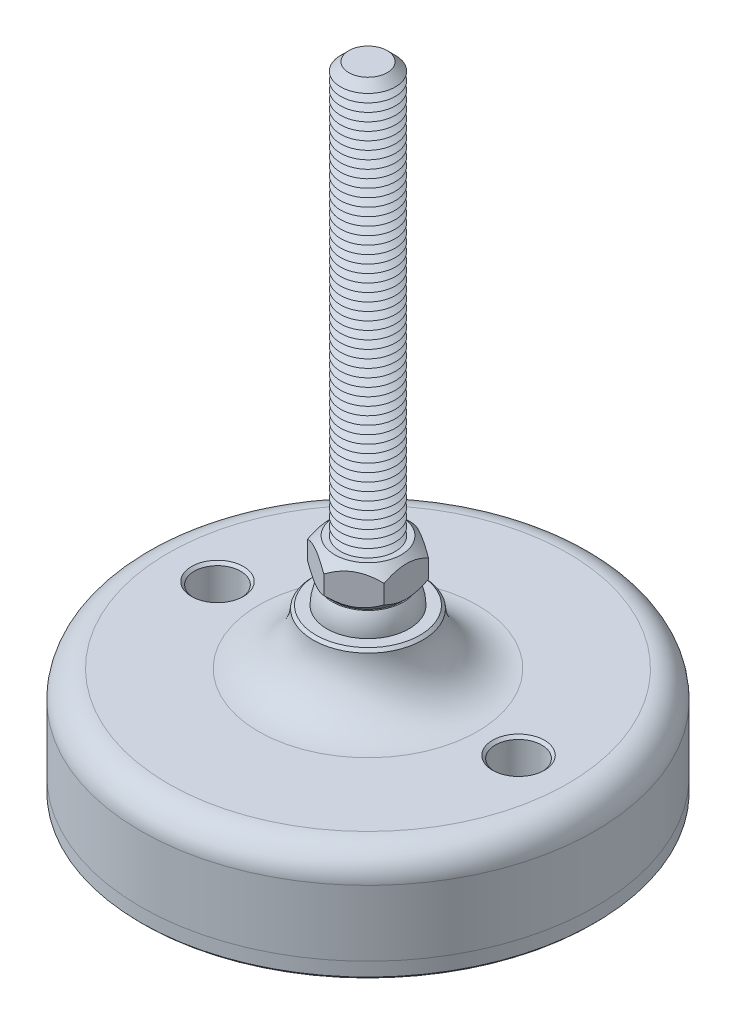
ISO-10303-21;
HEADER;
FILE_DESCRIPTION(('STEP AP214'),'2;1');
FILE_NAME('part.step','',(''),(''),'','','');
FILE_SCHEMA(('AUTOMOTIVE_DESIGN { 1 0 10303 214 1 1 1 1 }'));
ENDSEC;
DATA;
#1=APPLICATION_CONTEXT('core data for automotive mechanical design processes');
#2=APPLICATION_PROTOCOL_DEFINITION('international standard','automotive_design',2000,#1);
#3=PRODUCT_CONTEXT('',#1,'mechanical');
#4=PRODUCT('Part','Part','',(#3));
#5=PRODUCT_RELATED_PRODUCT_CATEGORY('part','',(#4));
#6=PRODUCT_DEFINITION_FORMATION('','',#4);
#7=PRODUCT_DEFINITION_CONTEXT('part definition',#1,'design');
#8=PRODUCT_DEFINITION('design','',#6,#7);
#9=PRODUCT_DEFINITION_SHAPE('','',#8);
#10=(LENGTH_UNIT() NAMED_UNIT(*) SI_UNIT(.MILLI.,.METRE.));
#11=(NAMED_UNIT(*) PLANE_ANGLE_UNIT() SI_UNIT($,.RADIAN.));
#12=(NAMED_UNIT(*) SI_UNIT($,.STERADIAN.) SOLID_ANGLE_UNIT());
#13=UNCERTAINTY_MEASURE_WITH_UNIT(LENGTH_MEASURE(1.E-05),#10,'distance_accuracy_value','');
#14=(GEOMETRIC_REPRESENTATION_CONTEXT(3) GLOBAL_UNCERTAINTY_ASSIGNED_CONTEXT((#13)) GLOBAL_UNIT_ASSIGNED_CONTEXT((#10,
#11,#12)) REPRESENTATION_CONTEXT('',''));
#15=CARTESIAN_POINT('',(0.,0.,0.));
#16=DIRECTION('',(0.,0.,1.));
#17=DIRECTION('',(1.,0.,0.));
#18=AXIS2_PLACEMENT_3D('',#15,#16,#17);
#19=CARTESIAN_POINT('',(0.,-27.,0.));
#20=DIRECTION('',(0.,1.,0.));
#21=DIRECTION('',(0.,0.,1.));
#22=AXIS2_PLACEMENT_3D('',#19,#20,#21);
#23=PLANE('',#22);
#24=CARTESIAN_POINT('',(-27.5,-27.,0.));
#25=DIRECTION('',(0.,1.,0.));
#26=DIRECTION('',(0.,0.,1.));
#27=AXIS2_PLACEMENT_3D('',#24,#25,#26);
#28=CIRCLE('',#27,4.25000000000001);
#29=CARTESIAN_POINT('',(-27.5,-27.,4.25000000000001));
#30=VERTEX_POINT('',#29);
#31=EDGE_CURVE('P0_E43',#30,#30,#28,.T.);
#32=ORIENTED_EDGE('',*,*,#31,.F.);
#33=EDGE_LOOP('',(#32));
#34=FACE_BOUND('',#33,.T.);
#35=CARTESIAN_POINT('',(27.5,-27.,0.));
#36=DIRECTION('',(0.,1.,0.));
#37=DIRECTION('',(0.,0.,1.));
#38=AXIS2_PLACEMENT_3D('',#35,#36,#37);
#39=CIRCLE('',#38,4.25000000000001);
#40=CARTESIAN_POINT('',(27.5,-27.,4.25000000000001));
#41=VERTEX_POINT('',#40);
#42=EDGE_CURVE('P0_E44',#41,#41,#39,.T.);
#43=ORIENTED_EDGE('',*,*,#42,.F.);
#44=EDGE_LOOP('',(#43));
#45=FACE_BOUND('',#44,.T.);
#46=CARTESIAN_POINT('',(0.,-27.,0.));
#47=DIRECTION('',(0.,1.,0.));
#48=DIRECTION('',(0.,0.,1.));
#49=AXIS2_PLACEMENT_3D('',#46,#47,#48);
#50=CIRCLE('',#49,41.5);
#51=CARTESIAN_POINT('',(0.,-27.,41.5));
#52=VERTEX_POINT('',#51);
#53=EDGE_CURVE('P0_E40',#52,#52,#50,.T.);
#54=ORIENTED_EDGE('',*,*,#53,.T.);
#55=EDGE_LOOP('',(#54));
#56=FACE_BOUND('',#55,.T.);
#57=ADVANCED_FACE('P0_F14',(#34,#45,#56),#23,.T.);
#58=CARTESIAN_POINT('',(0.,48.1654938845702,0.));
#59=DIRECTION('',(0.,1.,0.));
#60=DIRECTION('',(0.,0.,1.));
#61=AXIS2_PLACEMENT_3D('',#58,#59,#60);
#62=CYLINDRICAL_SURFACE('',#61,41.5);
#63=CARTESIAN_POINT('',(0.,-29.5,0.));
#64=DIRECTION('',(0.,-1.,0.));
#65=DIRECTION('',(0.,0.,-1.));
#66=AXIS2_PLACEMENT_3D('',#63,#64,#65);
#67=CIRCLE('',#66,41.5);
#68=CARTESIAN_POINT('',(0.,-29.5,-41.5));
#69=VERTEX_POINT('',#68);
#70=EDGE_CURVE('P0_E37',#69,#69,#67,.F.);
#71=ORIENTED_EDGE('',*,*,#70,.T.);
#72=EDGE_LOOP('',(#71));
#73=FACE_BOUND('',#72,.T.);
#74=ORIENTED_EDGE('',*,*,#53,.F.);
#75=EDGE_LOOP('',(#74));
#76=FACE_BOUND('',#75,.T.);
#77=ADVANCED_FACE('P0_F54',(#73,#76),#62,.T.);
#78=CARTESIAN_POINT('',(0.,-30.,41.5));
#79=DIRECTION('',(0.,-1.,0.));
#80=DIRECTION('',(0.,0.,-1.));
#81=AXIS2_PLACEMENT_3D('',#78,#79,#80);
#82=PLANE('',#81);
#83=CARTESIAN_POINT('',(27.5,-30.,0.));
#84=DIRECTION('',(0.,-1.,0.));
#85=DIRECTION('',(0.,0.,-1.));
#86=AXIS2_PLACEMENT_3D('',#83,#84,#85);
#87=CIRCLE('',#86,4.75);
#88=CARTESIAN_POINT('',(27.5,-30.,-4.75000000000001));
#89=VERTEX_POINT('',#88);
#90=EDGE_CURVE('P0_E25',#89,#89,#87,.F.);
#91=ORIENTED_EDGE('',*,*,#90,.T.);
#92=EDGE_LOOP('',(#91));
#93=FACE_BOUND('',#92,.T.);
#94=CARTESIAN_POINT('',(-27.5,-30.,0.));
#95=DIRECTION('',(0.,-1.,0.));
#96=DIRECTION('',(0.,0.,-1.));
#97=AXIS2_PLACEMENT_3D('',#94,#95,#96);
#98=CIRCLE('',#97,4.75);
#99=CARTESIAN_POINT('',(-27.5,-30.,-4.75));
#100=VERTEX_POINT('',#99);
#101=EDGE_CURVE('P0_E29',#100,#100,#98,.F.);
#102=ORIENTED_EDGE('',*,*,#101,.T.);
#103=EDGE_LOOP('',(#102));
#104=FACE_BOUND('',#103,.T.);
#105=CARTESIAN_POINT('',(0.,-30.,0.));
#106=DIRECTION('',(0.,-1.,0.));
#107=DIRECTION('',(0.,0.,-1.));
#108=AXIS2_PLACEMENT_3D('',#105,#106,#107);
#109=CIRCLE('',#108,41.);
#110=CARTESIAN_POINT('',(0.,-30.,-41.));
#111=VERTEX_POINT('',#110);
#112=EDGE_CURVE('P0_E34',#111,#111,#109,.T.);
#113=ORIENTED_EDGE('',*,*,#112,.T.);
#114=EDGE_LOOP('',(#113));
#115=FACE_BOUND('',#114,.T.);
#116=ADVANCED_FACE('P0_F61',(#93,#104,#115),#82,.T.);
#117=CARTESIAN_POINT('',(0.,-29.5,0.));
#118=DIRECTION('',(0.,1.,0.));
#119=DIRECTION('',(0.,0.,1.));
#120=AXIS2_PLACEMENT_3D('',#117,#118,#119);
#121=CONICAL_SURFACE('',#120,41.5,0.785398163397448);
#122=ORIENTED_EDGE('',*,*,#112,.F.);
#123=EDGE_LOOP('',(#122));
#124=FACE_BOUND('',#123,.T.);
#125=ORIENTED_EDGE('',*,*,#70,.F.);
#126=EDGE_LOOP('',(#125));
#127=FACE_BOUND('',#126,.T.);
#128=ADVANCED_FACE('P0_F68',(#124,#127),#121,.T.);
#129=CARTESIAN_POINT('',(27.5,-30.,0.));
#130=DIRECTION('',(0.,1.,0.));
#131=DIRECTION('',(0.,0.,1.));
#132=AXIS2_PLACEMENT_3D('',#129,#130,#131);
#133=CYLINDRICAL_SURFACE('',#132,4.25000000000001);
#134=CARTESIAN_POINT('',(27.5,-29.5,0.));
#135=DIRECTION('',(0.,-1.,0.));
#136=DIRECTION('',(0.,0.,-1.));
#137=AXIS2_PLACEMENT_3D('',#134,#135,#136);
#138=CIRCLE('',#137,4.25000000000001);
#139=CARTESIAN_POINT('',(27.5,-29.5,-4.25000000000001));
#140=VERTEX_POINT('',#139);
#141=EDGE_CURVE('P0_E21',#140,#140,#138,.T.);
#142=ORIENTED_EDGE('',*,*,#141,.T.);
#143=EDGE_LOOP('',(#142));
#144=FACE_BOUND('',#143,.T.);
#145=ORIENTED_EDGE('',*,*,#42,.T.);
#146=EDGE_LOOP('',(#145));
#147=FACE_BOUND('',#146,.T.);
#148=ADVANCED_FACE('P0_F74',(#144,#147),#133,.F.);
#149=CARTESIAN_POINT('',(-27.5,-30.,0.));
#150=DIRECTION('',(0.,1.,0.));
#151=DIRECTION('',(0.,0.,1.));
#152=AXIS2_PLACEMENT_3D('',#149,#150,#151);
#153=CYLINDRICAL_SURFACE('',#152,4.25000000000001);
#154=CARTESIAN_POINT('',(-27.5,-29.5,0.));
#155=DIRECTION('',(0.,-1.,0.));
#156=DIRECTION('',(0.,0.,-1.));
#157=AXIS2_PLACEMENT_3D('',#154,#155,#156);
#158=CIRCLE('',#157,4.25000000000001);
#159=CARTESIAN_POINT('',(-27.5,-29.5,-4.25000000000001));
#160=VERTEX_POINT('',#159);
#161=EDGE_CURVE('P0_E10',#160,#160,#158,.T.);
#162=ORIENTED_EDGE('',*,*,#161,.T.);
#163=EDGE_LOOP('',(#162));
#164=FACE_BOUND('',#163,.T.);
#165=ORIENTED_EDGE('',*,*,#31,.T.);
#166=EDGE_LOOP('',(#165));
#167=FACE_BOUND('',#166,.T.);
#168=ADVANCED_FACE('P0_F50',(#164,#167),#153,.F.);
#169=CARTESIAN_POINT('',(27.5,-30.,0.));
#170=DIRECTION('',(0.,-1.,0.));
#171=DIRECTION('',(0.,0.,-1.));
#172=AXIS2_PLACEMENT_3D('',#169,#170,#171);
#173=CONICAL_SURFACE('',#172,4.75,0.785398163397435);
#174=ORIENTED_EDGE('',*,*,#141,.F.);
#175=EDGE_LOOP('',(#174));
#176=FACE_BOUND('',#175,.T.);
#177=ORIENTED_EDGE('',*,*,#90,.F.);
#178=EDGE_LOOP('',(#177));
#179=FACE_BOUND('',#178,.T.);
#180=ADVANCED_FACE('P0_F76',(#176,#179),#173,.F.);
#181=CARTESIAN_POINT('',(-27.5,-30.,0.));
#182=DIRECTION('',(0.,-1.,0.));
#183=DIRECTION('',(0.,0.,-1.));
#184=AXIS2_PLACEMENT_3D('',#181,#182,#183);
#185=CONICAL_SURFACE('',#184,4.75,0.785398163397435);
#186=ORIENTED_EDGE('',*,*,#161,.F.);
#187=EDGE_LOOP('',(#186));
#188=FACE_BOUND('',#187,.T.);
#189=ORIENTED_EDGE('',*,*,#101,.F.);
#190=EDGE_LOOP('',(#189));
#191=FACE_BOUND('',#190,.T.);
#192=ADVANCED_FACE('P0_F16',(#188,#191),#185,.F.);
#193=CLOSED_SHELL('',(#57,#77,#116,#128,#148,#168,#180,#192));
#194=MANIFOLD_SOLID_BREP('P0_B1',#193);
#195=CARTESIAN_POINT('',(0.,0.,0.));
#196=DIRECTION('',(0.,1.,0.));
#197=DIRECTION('',(0.,0.,-1.));
#198=AXIS2_PLACEMENT_3D('',#195,#196,#197);
#199=SPHERICAL_SURFACE('',#198,7.5);
#200=CARTESIAN_POINT('',(0.,3.75,0.));
#201=DIRECTION('',(0.,-1.,0.));
#202=DIRECTION('',(0.,0.,-1.));
#203=AXIS2_PLACEMENT_3D('',#200,#201,#202);
#204=CIRCLE('',#203,6.49519052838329);
#205=CARTESIAN_POINT('',(0.,3.75,-6.49519052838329));
#206=VERTEX_POINT('',#205);
#207=EDGE_CURVE('P1_E209',#206,#206,#204,.F.);
#208=ORIENTED_EDGE('',*,*,#207,.F.);
#209=EDGE_LOOP('',(#208));
#210=FACE_BOUND('',#209,.T.);
#211=ADVANCED_FACE('P1_F16',(#210),#199,.T.);
#212=CARTESIAN_POINT('',(0.,3.75,0.));
#213=DIRECTION('',(0.,1.,0.));
#214=DIRECTION('',(0.,0.,1.));
#215=AXIS2_PLACEMENT_3D('',#212,#213,#214);
#216=CONICAL_SURFACE('',#215,6.26419292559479,0.785398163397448);
#217=CARTESIAN_POINT('',(0.,3.75,0.));
#218=DIRECTION('',(0.,1.,0.));
#219=DIRECTION('',(0.,0.,1.));
#220=AXIS2_PLACEMENT_3D('',#217,#218,#219);
#221=CIRCLE('',#220,6.26419292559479);
#222=CARTESIAN_POINT('',(0.,3.75,6.26419292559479));
#223=VERTEX_POINT('',#222);
#224=EDGE_CURVE('P1_E213',#223,#223,#221,.T.);
#225=ORIENTED_EDGE('',*,*,#224,.T.);
#226=EDGE_LOOP('',(#225));
#227=FACE_BOUND('',#226,.T.);
#228=CARTESIAN_POINT('',(-7.,8.22175145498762,-8.1400553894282));
#229=CARTESIAN_POINT('',(-7.,8.07177748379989,-7.94220937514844));
#230=CARTESIAN_POINT('',(-7.,7.92322959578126,-7.74326459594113));
#231=CARTESIAN_POINT('',(-7.,7.62962733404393,-7.34274065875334));
#232=CARTESIAN_POINT('',(-7.,7.48457383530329,-7.14116086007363));
#233=CARTESIAN_POINT('',(-7.,7.19756981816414,-6.73345531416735));
#234=CARTESIAN_POINT('',(-7.,7.05565202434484,-6.52730645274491));
#235=CARTESIAN_POINT('',(-7.,6.77703382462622,-6.11152362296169));
#236=CARTESIAN_POINT('',(-7.,6.64033305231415,-5.90188990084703));
#237=CARTESIAN_POINT('',(-7.,6.36550740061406,-5.46619755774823));
#238=CARTESIAN_POINT('',(-7.,6.22776674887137,-5.23989534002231));
#239=CARTESIAN_POINT('',(-7.,5.96123372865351,-4.78200028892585));
#240=CARTESIAN_POINT('',(-7.,5.83244279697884,-4.55040661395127));
#241=CARTESIAN_POINT('',(-7.,5.58658047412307,-4.08193183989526));
#242=CARTESIAN_POINT('',(-7.,5.46947462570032,-3.8450689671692));
#243=CARTESIAN_POINT('',(-7.,5.24960465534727,-3.36483104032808));
#244=CARTESIAN_POINT('',(-7.,5.14683397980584,-3.12145902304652));
#245=CARTESIAN_POINT('',(-7.,4.96723655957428,-2.64866791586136));
#246=CARTESIAN_POINT('',(-7.,4.88895097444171,-2.41980876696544));
#247=CARTESIAN_POINT('',(-7.,4.75072959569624,-1.9565107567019));
#248=CARTESIAN_POINT('',(-7.,4.69079504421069,-1.72207151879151));
#249=CARTESIAN_POINT('',(-7.,4.59342684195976,-1.25295119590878));
#250=CARTESIAN_POINT('',(-7.,4.5556027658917,-1.01835249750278));
#251=CARTESIAN_POINT('',(-7.,4.50320231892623,-0.546559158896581));
#252=CARTESIAN_POINT('',(-7.,4.48862178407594,-0.309364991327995));
#253=CARTESIAN_POINT('',(-7.,4.48382612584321,0.156313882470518));
#254=CARTESIAN_POINT('',(-7.,4.49271264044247,0.384789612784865));
#255=CARTESIAN_POINT('',(-7.,4.53235928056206,0.839822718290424));
#256=CARTESIAN_POINT('',(-7.,4.56312150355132,1.06637990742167));
#257=CARTESIAN_POINT('',(-7.,4.64535130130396,1.51976805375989));
#258=CARTESIAN_POINT('',(-7.,4.69717402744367,1.74653354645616));
#259=CARTESIAN_POINT('',(-7.,4.81873728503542,2.19511331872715));
#260=CARTESIAN_POINT('',(-7.,4.88847641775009,2.41692798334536));
#261=CARTESIAN_POINT('',(-7.,5.04951755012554,2.87389766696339));
#262=CARTESIAN_POINT('',(-7.,5.14215063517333,3.10857869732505));
#263=CARTESIAN_POINT('',(-7.,5.3416605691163,3.57185972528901));
#264=CARTESIAN_POINT('',(-7.,5.44854400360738,3.80045685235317));
#265=CARTESIAN_POINT('',(-7.,5.6740138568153,4.25267813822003));
#266=CARTESIAN_POINT('',(-7.,5.79263686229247,4.47628390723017));
#267=CARTESIAN_POINT('',(-7.,6.03896666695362,4.91835509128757));
#268=CARTESIAN_POINT('',(-7.,6.16667203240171,5.13682131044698));
#269=CARTESIAN_POINT('',(-7.,6.4228595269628,5.55855563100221));
#270=CARTESIAN_POINT('',(-7.,6.55098806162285,5.76203966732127));
#271=CARTESIAN_POINT('',(-7.,6.81264959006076,6.16551366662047));
#272=CARTESIAN_POINT('',(-7.,6.94618299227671,6.36550336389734));
#273=CARTESIAN_POINT('',(-7.,7.21658951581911,6.76082742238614));
#274=CARTESIAN_POINT('',(-7.,7.35342681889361,6.95618637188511));
#275=CARTESIAN_POINT('',(-7.,7.6307324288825,7.34423185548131));
#276=CARTESIAN_POINT('',(-7.,7.77119972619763,7.53691911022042));
#277=CARTESIAN_POINT('',(-7.,7.91315155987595,7.72848711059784));
#278=B_SPLINE_CURVE_WITH_KNOTS('',3,(#228,#229,#230,#231,#232,#233,#234,#235,#236,#237,#238,
#239,#240,#241,#242,#243,#244,#245,#246,#247,#248,#249,#250,#251,#252,#253,#254,#255,#256,#257,
#258,#259,#260,#261,#262,#263,#264,#265,#266,#267,#268,#269,#270,#271,#272,#273,#274,#275,#276,
#277),.UNSPECIFIED.,.F.,.F.,(4,2,2,2,2,2,2,2,2,2,2,2,2,2,2,2,2,2,2,2,2,2,2,2,4),(0.,
0.744807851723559,1.48980030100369,2.2405614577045,2.99126978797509,3.78587980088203,
4.58061708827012,5.37293691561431,6.16489332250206,6.88989369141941,7.61494312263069,
8.32676947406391,9.0384682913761,9.72332048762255,10.4082383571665,11.1052200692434,
11.8021473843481,12.5584650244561,13.3151334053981,14.0742390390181,14.8332251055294,
15.5545151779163,16.2758598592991,16.9913609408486,17.7066651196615),.UNSPECIFIED.);
#279=CARTESIAN_POINT('',(-7.,5.56871084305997,-4.04145188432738));
#280=VERTEX_POINT('',#279);
#281=CARTESIAN_POINT('',(-7.,5.56871084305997,4.04145188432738));
#282=VERTEX_POINT('',#281);
#283=EDGE_CURVE('P1_E24',#280,#282,#278,.T.);
#284=ORIENTED_EDGE('',*,*,#283,.F.);
#285=CARTESIAN_POINT('',(0.000199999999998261,5.56882631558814,-8.0830192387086));
#286=CARTESIAN_POINT('',(-0.120159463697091,5.49934419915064,-8.01352966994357));
#287=CARTESIAN_POINT('',(-0.241444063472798,5.43199440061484,-7.94350597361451));
#288=CARTESIAN_POINT('',(-0.486045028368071,5.30220807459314,-7.80228554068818));
#289=CARTESIAN_POINT('',(-0.60936245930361,5.2397742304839,-7.73108818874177));
#290=CARTESIAN_POINT('',(-0.983781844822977,5.06028719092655,-7.51491705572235));
#291=CARTESIAN_POINT('',(-1.23805341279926,4.95181416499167,-7.36811329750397));
#292=CARTESIAN_POINT('',(-1.75081233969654,4.76606165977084,-7.07207179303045));
#293=CARTESIAN_POINT('',(-2.00916864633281,4.68831421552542,-6.92290970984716));
#294=CARTESIAN_POINT('',(-2.40095049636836,4.59837958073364,-6.69671435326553));
#295=CARTESIAN_POINT('',(-2.53212124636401,4.57286115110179,-6.62098288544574));
#296=CARTESIAN_POINT('',(-2.79557335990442,4.53129725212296,-6.4688787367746));
#297=CARTESIAN_POINT('',(-2.92785455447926,4.5152503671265,-6.39250615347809));
#298=CARTESIAN_POINT('',(-3.25020698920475,4.48834537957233,-6.2063958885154));
#299=CARTESIAN_POINT('',(-3.44062555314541,4.48270029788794,-6.09645767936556));
#300=CARTESIAN_POINT('',(-3.82111946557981,4.49217587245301,-5.87677941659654));
#301=CARTESIAN_POINT('',(-4.01119467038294,4.5073038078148,-5.76703944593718));
#302=CARTESIAN_POINT('',(-4.38955306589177,4.55743368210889,-5.54859412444));
#303=CARTESIAN_POINT('',(-4.57783401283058,4.5924578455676,-5.43989006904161));
#304=CARTESIAN_POINT('',(-4.95115981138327,4.68047604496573,-5.22435031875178));
#305=CARTESIAN_POINT('',(-5.13620490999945,4.73346870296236,-5.1175144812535));
#306=CARTESIAN_POINT('',(-5.46469033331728,4.84248989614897,-4.92786333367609));
#307=CARTESIAN_POINT('',(-5.6088580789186,4.89565100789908,-4.8446280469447));
#308=CARTESIAN_POINT('',(-5.8946056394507,5.0105398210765,-4.67965161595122));
#309=CARTESIAN_POINT('',(-6.03618537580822,5.07226778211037,-4.5979105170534));
#310=CARTESIAN_POINT('',(-6.31631098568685,5.20290661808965,-4.43617992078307));
#311=CARTESIAN_POINT('',(-6.4548648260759,5.27179490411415,-4.3561858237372));
#312=CARTESIAN_POINT('',(-6.72940692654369,5.41585000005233,-4.19767886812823));
#313=CARTESIAN_POINT('',(-6.86539669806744,5.49101295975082,-4.11916513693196));
#314=CARTESIAN_POINT('',(-7.0002,5.56882631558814,-4.04133641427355));
#315=B_SPLINE_CURVE_WITH_KNOTS('',3,(#285,#286,#287,#288,#289,#290,#291,#292,#293,#294,#295,
#296,#297,#298,#299,#300,#301,#302,#303,#304,#305,#306,#307,#308,#309,#310,#311,#312,#313,#314),
.UNSPECIFIED.,.F.,.F.,(4,2,2,2,2,2,2,2,2,2,2,2,2,2,4),(0.,0.466112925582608,0.932478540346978,
1.87024464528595,2.79312018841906,3.25365289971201,3.71411676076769,4.37293813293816,
5.03199042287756,5.69178034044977,6.35151967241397,6.8755322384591,7.39956068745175,
7.92198344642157,8.44408796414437),.UNSPECIFIED.);
#316=CARTESIAN_POINT('',(0.,5.56871084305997,-8.08290376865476));
#317=VERTEX_POINT('',#316);
#318=EDGE_CURVE('P1_E114',#317,#280,#315,.T.);
#319=ORIENTED_EDGE('',*,*,#318,.F.);
#320=CARTESIAN_POINT('',(7.00019999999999,5.56882631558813,-4.04133641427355));
#321=CARTESIAN_POINT('',(6.8798405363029,5.49934419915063,-4.11082598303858));
#322=CARTESIAN_POINT('',(6.7585559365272,5.43199440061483,-4.18084967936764));
#323=CARTESIAN_POINT('',(6.51395497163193,5.30220807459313,-4.32207011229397));
#324=CARTESIAN_POINT('',(6.39063754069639,5.2397742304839,-4.39326746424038));
#325=CARTESIAN_POINT('',(6.01621815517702,5.06028719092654,-4.6094385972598));
#326=CARTESIAN_POINT('',(5.76194658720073,4.95181416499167,-4.75624235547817));
#327=CARTESIAN_POINT('',(5.24918766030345,4.76606165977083,-5.0522838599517));
#328=CARTESIAN_POINT('',(4.99083135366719,4.68831421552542,-5.20144594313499));
#329=CARTESIAN_POINT('',(4.59904950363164,4.59837958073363,-5.42764129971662));
#330=CARTESIAN_POINT('',(4.46787875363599,4.57286115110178,-5.50337276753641));
#331=CARTESIAN_POINT('',(4.20442664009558,4.53129725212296,-5.65547691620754));
#332=CARTESIAN_POINT('',(4.07214544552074,4.5152503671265,-5.73184949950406));
#333=CARTESIAN_POINT('',(3.74979301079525,4.48834537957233,-5.91795976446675));
#334=CARTESIAN_POINT('',(3.55937444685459,4.48270029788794,-6.02789797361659));
#335=CARTESIAN_POINT('',(3.17888053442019,4.49217587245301,-6.2475762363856));
#336=CARTESIAN_POINT('',(2.98880532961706,4.5073038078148,-6.35731620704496));
#337=CARTESIAN_POINT('',(2.61044693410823,4.55743368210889,-6.57576152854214));
#338=CARTESIAN_POINT('',(2.42216598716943,4.5924578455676,-6.68446558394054));
#339=CARTESIAN_POINT('',(2.04884018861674,4.68047604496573,-6.90000533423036));
#340=CARTESIAN_POINT('',(1.86379509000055,4.73346870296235,-7.00684117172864));
#341=CARTESIAN_POINT('',(1.53530966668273,4.84248989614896,-7.19649231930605));
#342=CARTESIAN_POINT('',(1.3911419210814,4.89565100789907,-7.27972760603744));
#343=CARTESIAN_POINT('',(1.1053943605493,5.0105398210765,-7.44470403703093));
#344=CARTESIAN_POINT('',(0.96381462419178,5.07226778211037,-7.52644513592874));
#345=CARTESIAN_POINT('',(0.683689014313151,5.20290661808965,-7.68817573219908));
#346=CARTESIAN_POINT('',(0.545135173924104,5.27179490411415,-7.76816982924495));
#347=CARTESIAN_POINT('',(0.270593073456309,5.41585000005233,-7.92667678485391));
#348=CARTESIAN_POINT('',(0.134603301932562,5.49101295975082,-8.00519051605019));
#349=CARTESIAN_POINT('',(-0.00020000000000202,5.56882631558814,-8.0830192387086));
#350=B_SPLINE_CURVE_WITH_KNOTS('',3,(#320,#321,#322,#323,#324,#325,#326,#327,#328,#329,#330,
#331,#332,#333,#334,#335,#336,#337,#338,#339,#340,#341,#342,#343,#344,#345,#346,#347,#348,#349),
.UNSPECIFIED.,.F.,.F.,(4,2,2,2,2,2,2,2,2,2,2,2,2,2,4),(0.,0.466112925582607,0.932478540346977,
1.87024464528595,2.79312018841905,3.25365289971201,3.71411676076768,4.37293813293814,
5.03199042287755,5.69178034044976,6.35151967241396,6.87553223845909,7.39956068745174,
7.92198344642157,8.44408796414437),.UNSPECIFIED.);
#351=CARTESIAN_POINT('',(7.,5.56871084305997,-4.04145188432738));
#352=VERTEX_POINT('',#351);
#353=EDGE_CURVE('P1_E121',#352,#317,#350,.T.);
#354=ORIENTED_EDGE('',*,*,#353,.F.);
#355=CARTESIAN_POINT('',(6.99999999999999,8.22175145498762,-8.1400553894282));
#356=CARTESIAN_POINT('',(6.99999999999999,8.07177748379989,-7.94220937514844));
#357=CARTESIAN_POINT('',(6.99999999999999,7.92322959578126,-7.74326459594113));
#358=CARTESIAN_POINT('',(6.99999999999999,7.62962733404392,-7.34274065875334));
#359=CARTESIAN_POINT('',(6.99999999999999,7.48457383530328,-7.14116086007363));
#360=CARTESIAN_POINT('',(6.99999999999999,7.19756981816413,-6.73345531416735));
#361=CARTESIAN_POINT('',(6.99999999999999,7.05565202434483,-6.52730645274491));
#362=CARTESIAN_POINT('',(6.99999999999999,6.77703382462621,-6.11152362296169));
#363=CARTESIAN_POINT('',(6.99999999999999,6.64033305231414,-5.90188990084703));
#364=CARTESIAN_POINT('',(6.99999999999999,6.36550740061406,-5.46619755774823));
#365=CARTESIAN_POINT('',(6.99999999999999,6.22776674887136,-5.23989534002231));
#366=CARTESIAN_POINT('',(6.99999999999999,5.9612337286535,-4.78200028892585));
#367=CARTESIAN_POINT('',(6.99999999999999,5.83244279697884,-4.55040661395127));
#368=CARTESIAN_POINT('',(6.99999999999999,5.58658047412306,-4.08193183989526));
#369=CARTESIAN_POINT('',(6.99999999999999,5.46947462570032,-3.8450689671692));
#370=CARTESIAN_POINT('',(6.99999999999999,5.24960465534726,-3.36483104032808));
#371=CARTESIAN_POINT('',(6.99999999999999,5.14683397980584,-3.12145902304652));
#372=CARTESIAN_POINT('',(6.99999999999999,4.96723655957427,-2.64866791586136));
#373=CARTESIAN_POINT('',(6.99999999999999,4.88895097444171,-2.41980876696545));
#374=CARTESIAN_POINT('',(6.99999999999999,4.75072959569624,-1.9565107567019));
#375=CARTESIAN_POINT('',(6.99999999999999,4.69079504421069,-1.72207151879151));
#376=CARTESIAN_POINT('',(6.99999999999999,4.59342684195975,-1.25295119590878));
#377=CARTESIAN_POINT('',(6.99999999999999,4.5556027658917,-1.01835249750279));
#378=CARTESIAN_POINT('',(6.99999999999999,4.50320231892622,-0.546559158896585));
#379=CARTESIAN_POINT('',(6.99999999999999,4.48862178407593,-0.309364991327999));
#380=CARTESIAN_POINT('',(6.99999999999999,4.48382612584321,0.156313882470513));
#381=CARTESIAN_POINT('',(6.99999999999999,4.49271264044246,0.38478961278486));
#382=CARTESIAN_POINT('',(6.99999999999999,4.53235928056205,0.83982271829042));
#383=CARTESIAN_POINT('',(6.99999999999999,4.56312150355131,1.06637990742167));
#384=CARTESIAN_POINT('',(6.99999999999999,4.64535130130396,1.51976805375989));
#385=CARTESIAN_POINT('',(6.99999999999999,4.69717402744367,1.74653354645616));
#386=CARTESIAN_POINT('',(6.99999999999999,4.81873728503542,2.19511331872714));
#387=CARTESIAN_POINT('',(7.,4.88847641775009,2.41692798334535));
#388=CARTESIAN_POINT('',(7.,5.04951755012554,2.87389766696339));
#389=CARTESIAN_POINT('',(7.,5.14215063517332,3.10857869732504));
#390=CARTESIAN_POINT('',(7.,5.34166056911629,3.571859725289));
#391=CARTESIAN_POINT('',(7.,5.44854400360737,3.80045685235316));
#392=CARTESIAN_POINT('',(7.,5.67401385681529,4.25267813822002));
#393=CARTESIAN_POINT('',(7.,5.79263686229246,4.47628390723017));
#394=CARTESIAN_POINT('',(7.,6.03896666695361,4.91835509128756));
#395=CARTESIAN_POINT('',(7.,6.1666720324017,5.13682131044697));
#396=CARTESIAN_POINT('',(7.,6.42285952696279,5.5585556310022));
#397=CARTESIAN_POINT('',(7.,6.55098806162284,5.76203966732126));
#398=CARTESIAN_POINT('',(7.,6.81264959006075,6.16551366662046));
#399=CARTESIAN_POINT('',(7.,6.9461829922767,6.36550336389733));
#400=CARTESIAN_POINT('',(7.,7.21658951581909,6.76082742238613));
#401=CARTESIAN_POINT('',(7.,7.3534268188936,6.9561863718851));
#402=CARTESIAN_POINT('',(7.,7.63073242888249,7.3442318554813));
#403=CARTESIAN_POINT('',(7.,7.77119972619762,7.53691911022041));
#404=CARTESIAN_POINT('',(7.,7.91315155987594,7.72848711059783));
#405=B_SPLINE_CURVE_WITH_KNOTS('',3,(#355,#356,#357,#358,#359,#360,#361,#362,#363,#364,#365,
#366,#367,#368,#369,#370,#371,#372,#373,#374,#375,#376,#377,#378,#379,#380,#381,#382,#383,#384,
#385,#386,#387,#388,#389,#390,#391,#392,#393,#394,#395,#396,#397,#398,#399,#400,#401,#402,#403,
#404),.UNSPECIFIED.,.F.,.F.,(4,2,2,2,2,2,2,2,2,2,2,2,2,2,2,2,2,2,2,2,2,2,2,2,4),(0.,
0.744807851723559,1.48980030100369,2.2405614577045,2.9912697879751,3.78587980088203,
4.58061708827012,5.3729369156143,6.16489332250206,6.8898936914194,7.61494312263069,
8.32676947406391,9.03846829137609,9.72332048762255,10.4082383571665,11.1052200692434,
11.8021473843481,12.5584650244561,13.3151334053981,14.0742390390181,14.8332251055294,
15.5545151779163,16.275859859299,16.9913609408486,17.7066651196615),.UNSPECIFIED.);
#406=CARTESIAN_POINT('',(6.99999999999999,5.56871084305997,4.04145188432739));
#407=VERTEX_POINT('',#406);
#408=EDGE_CURVE('P1_E70',#407,#352,#405,.F.);
#409=ORIENTED_EDGE('',*,*,#408,.F.);
#410=CARTESIAN_POINT('',(-0.000200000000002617,5.56882631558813,8.0830192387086));
#411=CARTESIAN_POINT('',(0.120159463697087,5.49934419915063,8.01352966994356));
#412=CARTESIAN_POINT('',(0.241444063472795,5.43199440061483,7.9435059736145));
#413=CARTESIAN_POINT('',(0.486045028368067,5.30220807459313,7.80228554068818));
#414=CARTESIAN_POINT('',(0.609362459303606,5.2397742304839,7.73108818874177));
#415=CARTESIAN_POINT('',(0.983781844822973,5.06028719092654,7.51491705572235));
#416=CARTESIAN_POINT('',(1.23805341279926,4.95181416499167,7.36811329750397));
#417=CARTESIAN_POINT('',(1.75081233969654,4.76606165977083,7.07207179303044));
#418=CARTESIAN_POINT('',(2.00916864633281,4.68831421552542,6.92290970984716));
#419=CARTESIAN_POINT('',(2.40095049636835,4.59837958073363,6.69671435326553));
#420=CARTESIAN_POINT('',(2.53212124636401,4.57286115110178,6.62098288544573));
#421=CARTESIAN_POINT('',(2.79557335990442,4.53129725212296,6.4688787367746));
#422=CARTESIAN_POINT('',(2.92785455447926,4.5152503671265,6.39250615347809));
#423=CARTESIAN_POINT('',(3.25020698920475,4.48834537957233,6.2063958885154));
#424=CARTESIAN_POINT('',(3.44062555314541,4.48270029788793,6.09645767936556));
#425=CARTESIAN_POINT('',(3.82111946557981,4.492175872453,5.87677941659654));
#426=CARTESIAN_POINT('',(4.01119467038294,4.5073038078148,5.76703944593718));
#427=CARTESIAN_POINT('',(4.38955306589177,4.55743368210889,5.54859412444));
#428=CARTESIAN_POINT('',(4.57783401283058,4.5924578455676,5.4398900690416));
#429=CARTESIAN_POINT('',(4.95115981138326,4.68047604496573,5.22435031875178));
#430=CARTESIAN_POINT('',(5.13620490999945,4.73346870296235,5.1175144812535));
#431=CARTESIAN_POINT('',(5.46469033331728,4.84248989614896,4.92786333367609));
#432=CARTESIAN_POINT('',(5.6088580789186,4.89565100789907,4.8446280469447));
#433=CARTESIAN_POINT('',(5.8946056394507,5.01053982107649,4.67965161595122));
#434=CARTESIAN_POINT('',(6.03618537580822,5.07226778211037,4.5979105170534));
#435=CARTESIAN_POINT('',(6.31631098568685,5.20290661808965,4.43617992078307));
#436=CARTESIAN_POINT('',(6.45486482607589,5.27179490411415,4.3561858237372));
#437=CARTESIAN_POINT('',(6.72940692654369,5.41585000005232,4.19767886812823));
#438=CARTESIAN_POINT('',(6.86539669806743,5.49101295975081,4.11916513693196));
#439=CARTESIAN_POINT('',(7.00019999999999,5.56882631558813,4.04133641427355));
#440=B_SPLINE_CURVE_WITH_KNOTS('',3,(#410,#411,#412,#413,#414,#415,#416,#417,#418,#419,#420,
#421,#422,#423,#424,#425,#426,#427,#428,#429,#430,#431,#432,#433,#434,#435,#436,#437,#438,#439),
.UNSPECIFIED.,.F.,.F.,(4,2,2,2,2,2,2,2,2,2,2,2,2,2,4),(0.,0.466112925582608,0.932478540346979,
1.87024464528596,2.79312018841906,3.25365289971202,3.71411676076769,4.37293813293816,
5.03199042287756,5.69178034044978,6.35151967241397,6.8755322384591,7.39956068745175,
7.92198344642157,8.44408796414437),.UNSPECIFIED.);
#441=CARTESIAN_POINT('',(0.,5.56871084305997,8.08290376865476));
#442=VERTEX_POINT('',#441);
#443=EDGE_CURVE('P1_E67',#442,#407,#440,.T.);
#444=ORIENTED_EDGE('',*,*,#443,.F.);
#445=CARTESIAN_POINT('',(-7.0002,5.56882631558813,4.04133641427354));
#446=CARTESIAN_POINT('',(-6.87984053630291,5.49934419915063,4.11082598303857));
#447=CARTESIAN_POINT('',(-6.7585559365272,5.43199440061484,4.18084967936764));
#448=CARTESIAN_POINT('',(-6.51395497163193,5.30220807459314,4.32207011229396));
#449=CARTESIAN_POINT('',(-6.39063754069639,5.2397742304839,4.39326746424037));
#450=CARTESIAN_POINT('',(-6.01621815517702,5.06028719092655,4.60943859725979));
#451=CARTESIAN_POINT('',(-5.76194658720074,4.95181416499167,4.75624235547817));
#452=CARTESIAN_POINT('',(-5.24918766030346,4.76606165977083,5.0522838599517));
#453=CARTESIAN_POINT('',(-4.99083135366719,4.68831421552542,5.20144594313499));
#454=CARTESIAN_POINT('',(-4.59904950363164,4.59837958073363,5.42764129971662));
#455=CARTESIAN_POINT('',(-4.46787875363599,4.57286115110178,5.50337276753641));
#456=CARTESIAN_POINT('',(-4.20442664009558,4.53129725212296,5.65547691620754));
#457=CARTESIAN_POINT('',(-4.07214544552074,4.5152503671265,5.73184949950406));
#458=CARTESIAN_POINT('',(-3.74979301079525,4.48834537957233,5.91795976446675));
#459=CARTESIAN_POINT('',(-3.55937444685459,4.48270029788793,6.02789797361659));
#460=CARTESIAN_POINT('',(-3.17888053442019,4.492175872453,6.2475762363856));
#461=CARTESIAN_POINT('',(-2.98880532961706,4.5073038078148,6.35731620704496));
#462=CARTESIAN_POINT('',(-2.61044693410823,4.55743368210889,6.57576152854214));
#463=CARTESIAN_POINT('',(-2.42216598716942,4.5924578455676,6.68446558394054));
#464=CARTESIAN_POINT('',(-2.04884018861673,4.68047604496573,6.90000533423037));
#465=CARTESIAN_POINT('',(-1.86379509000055,4.73346870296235,7.00684117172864));
#466=CARTESIAN_POINT('',(-1.53530966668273,4.84248989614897,7.19649231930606));
#467=CARTESIAN_POINT('',(-1.3911419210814,4.89565100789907,7.27972760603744));
#468=CARTESIAN_POINT('',(-1.1053943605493,5.01053982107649,7.44470403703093));
#469=CARTESIAN_POINT('',(-0.963814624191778,5.07226778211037,7.52644513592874));
#470=CARTESIAN_POINT('',(-0.683689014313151,5.20290661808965,7.68817573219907));
#471=CARTESIAN_POINT('',(-0.545135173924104,5.27179490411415,7.76816982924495));
#472=CARTESIAN_POINT('',(-0.270593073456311,5.41585000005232,7.92667678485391));
#473=CARTESIAN_POINT('',(-0.134603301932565,5.49101295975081,8.00519051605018));
#474=CARTESIAN_POINT('',(0.000199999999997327,5.56882631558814,8.0830192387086));
#475=B_SPLINE_CURVE_WITH_KNOTS('',3,(#445,#446,#447,#448,#449,#450,#451,#452,#453,#454,#455,
#456,#457,#458,#459,#460,#461,#462,#463,#464,#465,#466,#467,#468,#469,#470,#471,#472,#473,#474),
.UNSPECIFIED.,.F.,.F.,(4,2,2,2,2,2,2,2,2,2,2,2,2,2,4),(0.,0.466112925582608,0.93247854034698,
1.87024464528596,2.79312018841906,3.25365289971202,3.71411676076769,4.37293813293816,
5.03199042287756,5.69178034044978,6.35151967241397,6.8755322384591,7.39956068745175,
7.92198344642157,8.44408796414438),.UNSPECIFIED.);
#476=EDGE_CURVE('P1_E39',#282,#442,#475,.T.);
#477=ORIENTED_EDGE('',*,*,#476,.F.);
#478=EDGE_LOOP('',(#284,#319,#354,#409,#444,#477));
#479=FACE_BOUND('',#478,.T.);
#480=ADVANCED_FACE('P1_F68',(#227,#479),#216,.T.);
#481=CARTESIAN_POINT('',(0.,3.75,6.26419292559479));
#482=DIRECTION('',(0.,-1.,0.));
#483=DIRECTION('',(0.,0.,-1.));
#484=AXIS2_PLACEMENT_3D('',#481,#482,#483);
#485=PLANE('',#484);
#486=ORIENTED_EDGE('',*,*,#207,.T.);
#487=EDGE_LOOP('',(#486));
#488=FACE_BOUND('',#487,.T.);
#489=ORIENTED_EDGE('',*,*,#224,.F.);
#490=EDGE_LOOP('',(#489));
#491=FACE_BOUND('',#490,.T.);
#492=ADVANCED_FACE('P1_F105',(#488,#491),#485,.F.);
#493=CARTESIAN_POINT('',(-7.,11.,4.04145188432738));
#494=DIRECTION('',(0.5,0.,-0.866025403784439));
#495=DIRECTION('',(-0.866025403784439,0.,-0.5));
#496=AXIS2_PLACEMENT_3D('',#493,#494,#495);
#497=PLANE('',#496);
#498=DIRECTION('',(0.,-1.,0.));
#499=VECTOR('',#498,1.);
#500=CARTESIAN_POINT('',(0.,11.,8.08290376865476));
#501=LINE('',#500,#499);
#502=CARTESIAN_POINT('',(0.,8.97927405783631,8.08290376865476));
#503=VERTEX_POINT('',#502);
#504=EDGE_CURVE('P1_E81',#503,#442,#501,.T.);
#505=ORIENTED_EDGE('',*,*,#504,.F.);
#506=CARTESIAN_POINT('',(0.000199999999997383,8.97915858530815,8.0830192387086));
#507=CARTESIAN_POINT('',(-0.120159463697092,9.04864070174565,8.01352966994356));
#508=CARTESIAN_POINT('',(-0.241444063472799,9.11599050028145,7.9435059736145));
#509=CARTESIAN_POINT('',(-0.486045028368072,9.24577682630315,7.80228554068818));
#510=CARTESIAN_POINT('',(-0.609362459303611,9.30821067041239,7.73108818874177));
#511=CARTESIAN_POINT('',(-0.983781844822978,9.48769770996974,7.51491705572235));
#512=CARTESIAN_POINT('',(-1.23805341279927,9.59617073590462,7.36811329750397));
#513=CARTESIAN_POINT('',(-1.75081233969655,9.78192324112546,7.07207179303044));
#514=CARTESIAN_POINT('',(-2.00916864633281,9.85967068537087,6.92290970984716));
#515=CARTESIAN_POINT('',(-2.40095049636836,9.94960532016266,6.69671435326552));
#516=CARTESIAN_POINT('',(-2.53212124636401,9.9751237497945,6.62098288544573));
#517=CARTESIAN_POINT('',(-2.79557335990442,10.0166876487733,6.4688787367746));
#518=CARTESIAN_POINT('',(-2.92785455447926,10.0327345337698,6.39250615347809));
#519=CARTESIAN_POINT('',(-3.25020698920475,10.059639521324,6.2063958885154));
#520=CARTESIAN_POINT('',(-3.44062555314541,10.0652846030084,6.09645767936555));
#521=CARTESIAN_POINT('',(-3.82111946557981,10.0558090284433,5.87677941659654));
#522=CARTESIAN_POINT('',(-4.01119467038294,10.0406810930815,5.76703944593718));
#523=CARTESIAN_POINT('',(-4.38955306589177,9.9905512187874,5.54859412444));
#524=CARTESIAN_POINT('',(-4.57783401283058,9.95552705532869,5.4398900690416));
#525=CARTESIAN_POINT('',(-4.95115981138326,9.86750885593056,5.22435031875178));
#526=CARTESIAN_POINT('',(-5.13620490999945,9.81451619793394,5.1175144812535));
#527=CARTESIAN_POINT('',(-5.46469033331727,9.70549500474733,4.92786333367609));
#528=CARTESIAN_POINT('',(-5.6088580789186,9.65233389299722,4.8446280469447));
#529=CARTESIAN_POINT('',(-5.8946056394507,9.5374450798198,4.67965161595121));
#530=CARTESIAN_POINT('',(-6.03618537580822,9.47571711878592,4.5979105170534));
#531=CARTESIAN_POINT('',(-6.31631098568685,9.34507828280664,4.43617992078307));
#532=CARTESIAN_POINT('',(-6.4548648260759,9.27618999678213,4.35618582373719));
#533=CARTESIAN_POINT('',(-6.72940692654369,9.13213490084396,4.19767886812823));
#534=CARTESIAN_POINT('',(-6.86539669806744,9.05697194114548,4.11916513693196));
#535=CARTESIAN_POINT('',(-7.0002,8.97915858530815,4.04133641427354));
#536=B_SPLINE_CURVE_WITH_KNOTS('',3,(#506,#507,#508,#509,#510,#511,#512,#513,#514,#515,#516,
#517,#518,#519,#520,#521,#522,#523,#524,#525,#526,#527,#528,#529,#530,#531,#532,#533,#534,#535),
.UNSPECIFIED.,.F.,.F.,(4,2,2,2,2,2,2,2,2,2,2,2,2,2,4),(0.,0.466112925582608,0.932478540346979,
1.87024464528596,2.79312018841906,3.25365289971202,3.71411676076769,4.37293813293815,
5.03199042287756,5.69178034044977,6.35151967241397,6.87553223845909,7.39956068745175,
7.92198344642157,8.44408796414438),.UNSPECIFIED.);
#537=CARTESIAN_POINT('',(-7.,8.97927405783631,4.04145188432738));
#538=VERTEX_POINT('',#537);
#539=EDGE_CURVE('P1_E151',#503,#538,#536,.T.);
#540=ORIENTED_EDGE('',*,*,#539,.T.);
#541=DIRECTION('',(0.,-1.,0.));
#542=VECTOR('',#541,1.);
#543=CARTESIAN_POINT('',(-7.,11.,4.04145188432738));
#544=LINE('',#543,#542);
#545=EDGE_CURVE('P1_E83',#538,#282,#544,.T.);
#546=ORIENTED_EDGE('',*,*,#545,.T.);
#547=ORIENTED_EDGE('',*,*,#476,.T.);
#548=EDGE_LOOP('',(#505,#540,#546,#547));
#549=FACE_BOUND('',#548,.T.);
#550=ADVANCED_FACE('P1_F79',(#549),#497,.F.);
#551=CARTESIAN_POINT('',(0.,11.,8.08290376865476));
#552=DIRECTION('',(-0.5,0.,-0.866025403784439));
#553=DIRECTION('',(-0.866025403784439,0.,0.5));
#554=AXIS2_PLACEMENT_3D('',#551,#552,#553);
#555=PLANE('',#554);
#556=DIRECTION('',(0.,-1.,0.));
#557=VECTOR('',#556,1.);
#558=CARTESIAN_POINT('',(7.,11.,4.04145188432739));
#559=LINE('',#558,#557);
#560=CARTESIAN_POINT('',(7.,8.97927405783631,4.04145188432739));
#561=VERTEX_POINT('',#560);
#562=EDGE_CURVE('P1_E88',#561,#407,#559,.T.);
#563=ORIENTED_EDGE('',*,*,#562,.F.);
#564=CARTESIAN_POINT('',(7.0002,8.97915858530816,4.04133641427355));
#565=CARTESIAN_POINT('',(6.87984053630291,9.04864070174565,4.11082598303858));
#566=CARTESIAN_POINT('',(6.7585559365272,9.11599050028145,4.18084967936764));
#567=CARTESIAN_POINT('',(6.51395497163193,9.24577682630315,4.32207011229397));
#568=CARTESIAN_POINT('',(6.39063754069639,9.30821067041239,4.39326746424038));
#569=CARTESIAN_POINT('',(6.01621815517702,9.48769770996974,4.6094385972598));
#570=CARTESIAN_POINT('',(5.76194658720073,9.59617073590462,4.75624235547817));
#571=CARTESIAN_POINT('',(5.24918766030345,9.78192324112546,5.0522838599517));
#572=CARTESIAN_POINT('',(4.99083135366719,9.85967068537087,5.20144594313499));
#573=CARTESIAN_POINT('',(4.59904950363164,9.94960532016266,5.42764129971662));
#574=CARTESIAN_POINT('',(4.46787875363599,9.9751237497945,5.50337276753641));
#575=CARTESIAN_POINT('',(4.20442664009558,10.0166876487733,5.65547691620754));
#576=CARTESIAN_POINT('',(4.07214544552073,10.0327345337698,5.73184949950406));
#577=CARTESIAN_POINT('',(3.74979301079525,10.059639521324,5.91795976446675));
#578=CARTESIAN_POINT('',(3.55937444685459,10.0652846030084,6.02789797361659));
#579=CARTESIAN_POINT('',(3.17888053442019,10.0558090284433,6.2475762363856));
#580=CARTESIAN_POINT('',(2.98880532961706,10.0406810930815,6.35731620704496));
#581=CARTESIAN_POINT('',(2.61044693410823,9.9905512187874,6.57576152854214));
#582=CARTESIAN_POINT('',(2.42216598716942,9.95552705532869,6.68446558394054));
#583=CARTESIAN_POINT('',(2.04884018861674,9.86750885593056,6.90000533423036));
#584=CARTESIAN_POINT('',(1.86379509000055,9.81451619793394,7.00684117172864));
#585=CARTESIAN_POINT('',(1.53530966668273,9.70549500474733,7.19649231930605));
#586=CARTESIAN_POINT('',(1.3911419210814,9.65233389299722,7.27972760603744));
#587=CARTESIAN_POINT('',(1.1053943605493,9.5374450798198,7.44470403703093));
#588=CARTESIAN_POINT('',(0.963814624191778,9.47571711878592,7.52644513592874));
#589=CARTESIAN_POINT('',(0.683689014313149,9.34507828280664,7.68817573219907));
#590=CARTESIAN_POINT('',(0.545135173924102,9.27618999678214,7.76816982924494));
#591=CARTESIAN_POINT('',(0.270593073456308,9.13213490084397,7.92667678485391));
#592=CARTESIAN_POINT('',(0.134603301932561,9.05697194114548,8.00519051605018));
#593=CARTESIAN_POINT('',(-0.000200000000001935,8.97915858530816,8.0830192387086));
#594=B_SPLINE_CURVE_WITH_KNOTS('',3,(#564,#565,#566,#567,#568,#569,#570,#571,#572,#573,#574,
#575,#576,#577,#578,#579,#580,#581,#582,#583,#584,#585,#586,#587,#588,#589,#590,#591,#592,#593),
.UNSPECIFIED.,.F.,.F.,(4,2,2,2,2,2,2,2,2,2,2,2,2,2,4),(0.,0.466112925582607,0.932478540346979,
1.87024464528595,2.79312018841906,3.25365289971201,3.71411676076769,4.37293813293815,
5.03199042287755,5.69178034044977,6.35151967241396,6.87553223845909,7.39956068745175,
7.92198344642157,8.44408796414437),.UNSPECIFIED.);
#595=EDGE_CURVE('P1_E87',#561,#503,#594,.T.);
#596=ORIENTED_EDGE('',*,*,#595,.T.);
#597=ORIENTED_EDGE('',*,*,#504,.T.);
#598=ORIENTED_EDGE('',*,*,#443,.T.);
#599=EDGE_LOOP('',(#563,#596,#597,#598));
#600=FACE_BOUND('',#599,.T.);
#601=ADVANCED_FACE('P1_F86',(#600),#555,.F.);
#602=CARTESIAN_POINT('',(7.,11.,4.04145188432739));
#603=DIRECTION('',(-1.,0.,0.));
#604=DIRECTION('',(0.,0.,1.));
#605=AXIS2_PLACEMENT_3D('',#602,#603,#604);
#606=PLANE('',#605);
#607=DIRECTION('',(0.,-1.,0.));
#608=VECTOR('',#607,1.);
#609=CARTESIAN_POINT('',(6.99999999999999,11.,-4.04145188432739));
#610=LINE('',#609,#608);
#611=CARTESIAN_POINT('',(7.,8.97927405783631,-4.04145188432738));
#612=VERTEX_POINT('',#611);
#613=EDGE_CURVE('P1_E90',#612,#352,#610,.T.);
#614=ORIENTED_EDGE('',*,*,#613,.F.);
#615=CARTESIAN_POINT('',(6.99999999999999,6.38657431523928,-8.06030460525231));
#616=CARTESIAN_POINT('',(6.99999999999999,6.53472070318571,-7.86404504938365));
#617=CARTESIAN_POINT('',(6.99999999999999,6.68143506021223,-7.66668664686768));
#618=CARTESIAN_POINT('',(6.99999999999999,6.97135854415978,-7.26933868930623));
#619=CARTESIAN_POINT('',(6.99999999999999,7.1145667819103,-7.06934848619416));
#620=CARTESIAN_POINT('',(6.99999999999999,7.39785506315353,-6.66484054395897));
#621=CARTESIAN_POINT('',(6.99999999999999,7.53790227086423,-6.4602997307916));
#622=CARTESIAN_POINT('',(6.99999999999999,7.81276929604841,-6.04774624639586));
#623=CARTESIAN_POINT('',(6.99999999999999,7.94758948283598,-5.83973382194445));
#624=CARTESIAN_POINT('',(6.99999999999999,8.21836349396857,-5.40767991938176));
#625=CARTESIAN_POINT('',(6.99999999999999,8.35394167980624,-5.18340182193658));
#626=CARTESIAN_POINT('',(6.99999999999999,8.61617794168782,-4.72961052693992));
#627=CARTESIAN_POINT('',(6.99999999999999,8.74283460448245,-4.50009650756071));
#628=CARTESIAN_POINT('',(6.99999999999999,8.98449500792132,-4.03585471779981));
#629=CARTESIAN_POINT('',(6.99999999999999,9.09953301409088,-3.80114492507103));
#630=CARTESIAN_POINT('',(6.99999999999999,9.31538083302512,-3.32532417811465));
#631=CARTESIAN_POINT('',(6.99999999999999,9.41619708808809,-3.08421618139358));
#632=CARTESIAN_POINT('',(6.99999999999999,9.59261477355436,-2.61490679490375));
#633=CARTESIAN_POINT('',(6.99999999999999,9.66959244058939,-2.38722816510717));
#634=CARTESIAN_POINT('',(6.99999999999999,9.80528213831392,-1.92638931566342));
#635=CARTESIAN_POINT('',(6.99999999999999,9.86399291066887,-1.69322871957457));
#636=CARTESIAN_POINT('',(6.99999999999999,9.95910606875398,-1.22669621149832));
#637=CARTESIAN_POINT('',(6.99999999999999,9.9958906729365,-0.993403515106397));
#638=CARTESIAN_POINT('',(6.99999999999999,10.0464375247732,-0.524324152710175));
#639=CARTESIAN_POINT('',(6.99999999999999,10.0602037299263,-0.288537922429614));
#640=CARTESIAN_POINT('',(6.99999999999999,10.0636914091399,0.174669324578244));
#641=CARTESIAN_POINT('',(6.99999999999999,10.0542651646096,0.402084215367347));
#642=CARTESIAN_POINT('',(6.99999999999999,10.0137689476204,0.854966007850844));
#643=CARTESIAN_POINT('',(6.99999999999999,9.98269687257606,1.080432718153));
#644=CARTESIAN_POINT('',(6.99999999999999,9.90007567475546,1.53159825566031));
#645=CARTESIAN_POINT('',(6.99999999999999,9.84817808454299,1.75723223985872));
#646=CARTESIAN_POINT('',(6.99999999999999,9.72667364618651,2.20358388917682));
#647=CARTESIAN_POINT('',(7.,9.65706827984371,2.42430196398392));
#648=CARTESIAN_POINT('',(7.,9.49585307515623,2.88081008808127));
#649=CARTESIAN_POINT('',(7.,9.40279568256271,3.11608373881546));
#650=CARTESIAN_POINT('',(7.,9.20239444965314,3.58051976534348));
#651=CARTESIAN_POINT('',(7.,9.09504395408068,3.8096792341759));
#652=CARTESIAN_POINT('',(7.,8.86861061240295,4.26300681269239));
#653=CARTESIAN_POINT('',(7.,8.74949092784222,4.48715637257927));
#654=CARTESIAN_POINT('',(7.,8.50215207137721,4.93029722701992));
#655=CARTESIAN_POINT('',(7.,8.37393434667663,5.14928933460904));
#656=CARTESIAN_POINT('',(7.,8.11675254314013,5.57201416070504));
#657=CARTESIAN_POINT('',(7.,7.98814324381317,5.7759638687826));
#658=CARTESIAN_POINT('',(7.,7.72551640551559,6.1803619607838));
#659=CARTESIAN_POINT('',(7.,7.59149845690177,6.3808100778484));
#660=CARTESIAN_POINT('',(7.,7.32012806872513,6.77703781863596));
#661=CARTESIAN_POINT('',(7.,7.18281155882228,6.97284213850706));
#662=CARTESIAN_POINT('',(7.,6.90454718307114,7.36177489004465));
#663=CARTESIAN_POINT('',(7.,6.76360032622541,7.55490404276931));
#664=CARTESIAN_POINT('',(7.,6.62116922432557,7.74691297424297));
#665=B_SPLINE_CURVE_WITH_KNOTS('',3,(#615,#616,#617,#618,#619,#620,#621,#622,#623,#624,#625,
#626,#627,#628,#629,#630,#631,#632,#633,#634,#635,#636,#637,#638,#639,#640,#641,#642,#643,#644,
#645,#646,#647,#648,#649,#650,#651,#652,#653,#654,#655,#656,#657,#658,#659,#660,#661,#662,#663,
#664),.UNSPECIFIED.,.F.,.F.,(4,2,2,2,2,2,2,2,2,2,2,2,2,2,2,2,2,2,2,2,2,2,2,2,4),(0.,
0.73770456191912,1.47559431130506,2.21920144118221,2.96275593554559,3.74880908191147,
4.53498646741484,5.31877306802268,6.10220347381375,6.82258884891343,7.54302383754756,
8.2505020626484,8.95785864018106,9.63961191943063,10.3214314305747,11.0151699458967,
11.7088504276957,12.4672854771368,13.2260749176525,13.9873195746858,14.7484434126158,
15.4716843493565,16.1949801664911,16.912400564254,17.6296236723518),.UNSPECIFIED.);
#666=EDGE_CURVE('P1_E152',#612,#561,#665,.T.);
#667=ORIENTED_EDGE('',*,*,#666,.T.);
#668=ORIENTED_EDGE('',*,*,#562,.T.);
#669=ORIENTED_EDGE('',*,*,#408,.T.);
#670=EDGE_LOOP('',(#614,#667,#668,#669));
#671=FACE_BOUND('',#670,.T.);
#672=ADVANCED_FACE('P1_F142',(#671),#606,.F.);
#673=CARTESIAN_POINT('',(6.99999999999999,11.,-4.04145188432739));
#674=DIRECTION('',(-0.5,0.,0.866025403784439));
#675=DIRECTION('',(0.866025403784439,0.,0.5));
#676=AXIS2_PLACEMENT_3D('',#673,#674,#675);
#677=PLANE('',#676);
#678=DIRECTION('',(0.,-1.,0.));
#679=VECTOR('',#678,1.);
#680=CARTESIAN_POINT('',(0.,11.,-8.08290376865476));
#681=LINE('',#680,#679);
#682=CARTESIAN_POINT('',(0.,8.97927405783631,-8.08290376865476));
#683=VERTEX_POINT('',#682);
#684=EDGE_CURVE('P1_E1113',#683,#317,#681,.T.);
#685=ORIENTED_EDGE('',*,*,#684,.F.);
#686=CARTESIAN_POINT('',(-0.000200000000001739,8.97915858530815,-8.0830192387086));
#687=CARTESIAN_POINT('',(0.120159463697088,9.04864070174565,-8.01352966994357));
#688=CARTESIAN_POINT('',(0.241444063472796,9.11599050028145,-7.94350597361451));
#689=CARTESIAN_POINT('',(0.48604502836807,9.24577682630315,-7.80228554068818));
#690=CARTESIAN_POINT('',(0.609362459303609,9.30821067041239,-7.73108818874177));
#691=CARTESIAN_POINT('',(0.983781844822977,9.48769770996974,-7.51491705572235));
#692=CARTESIAN_POINT('',(1.23805341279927,9.59617073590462,-7.36811329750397));
#693=CARTESIAN_POINT('',(1.75081233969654,9.78192324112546,-7.07207179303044));
#694=CARTESIAN_POINT('',(2.00916864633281,9.85967068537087,-6.92290970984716));
#695=CARTESIAN_POINT('',(2.40095049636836,9.94960532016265,-6.69671435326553));
#696=CARTESIAN_POINT('',(2.53212124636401,9.9751237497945,-6.62098288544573));
#697=CARTESIAN_POINT('',(2.79557335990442,10.0166876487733,-6.4688787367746));
#698=CARTESIAN_POINT('',(2.92785455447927,10.0327345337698,-6.39250615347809));
#699=CARTESIAN_POINT('',(3.25020698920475,10.059639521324,-6.2063958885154));
#700=CARTESIAN_POINT('',(3.44062555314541,10.0652846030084,-6.09645767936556));
#701=CARTESIAN_POINT('',(3.82111946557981,10.0558090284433,-5.87677941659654));
#702=CARTESIAN_POINT('',(4.01119467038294,10.0406810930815,-5.76703944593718));
#703=CARTESIAN_POINT('',(4.38955306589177,9.9905512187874,-5.54859412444));
#704=CARTESIAN_POINT('',(4.57783401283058,9.95552705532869,-5.4398900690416));
#705=CARTESIAN_POINT('',(4.95115981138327,9.86750885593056,-5.22435031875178));
#706=CARTESIAN_POINT('',(5.13620490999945,9.81451619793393,-5.1175144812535));
#707=CARTESIAN_POINT('',(5.46469033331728,9.70549500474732,-4.92786333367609));
#708=CARTESIAN_POINT('',(5.6088580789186,9.65233389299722,-4.8446280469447));
#709=CARTESIAN_POINT('',(5.8946056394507,9.5374450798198,-4.67965161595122));
#710=CARTESIAN_POINT('',(6.03618537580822,9.47571711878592,-4.5979105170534));
#711=CARTESIAN_POINT('',(6.31631098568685,9.34507828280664,-4.43617992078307));
#712=CARTESIAN_POINT('',(6.45486482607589,9.27618999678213,-4.3561858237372));
#713=CARTESIAN_POINT('',(6.72940692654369,9.13213490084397,-4.19767886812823));
#714=CARTESIAN_POINT('',(6.86539669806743,9.05697194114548,-4.11916513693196));
#715=CARTESIAN_POINT('',(7.00019999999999,8.97915858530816,-4.04133641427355));
#716=B_SPLINE_CURVE_WITH_KNOTS('',3,(#686,#687,#688,#689,#690,#691,#692,#693,#694,#695,#696,
#697,#698,#699,#700,#701,#702,#703,#704,#705,#706,#707,#708,#709,#710,#711,#712,#713,#714,#715),
.UNSPECIFIED.,.F.,.F.,(4,2,2,2,2,2,2,2,2,2,2,2,2,2,4),(0.,0.466112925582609,0.932478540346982,
1.87024464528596,2.79312018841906,3.25365289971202,3.7141167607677,4.37293813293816,
5.03199042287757,5.69178034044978,6.35151967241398,6.8755322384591,7.39956068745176,
7.92198344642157,8.44408796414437),.UNSPECIFIED.);
#717=EDGE_CURVE('P1_E182',#683,#612,#716,.T.);
#718=ORIENTED_EDGE('',*,*,#717,.T.);
#719=ORIENTED_EDGE('',*,*,#613,.T.);
#720=ORIENTED_EDGE('',*,*,#353,.T.);
#721=EDGE_LOOP('',(#685,#718,#719,#720));
#722=FACE_BOUND('',#721,.T.);
#723=ADVANCED_FACE('P1_F187',(#722),#677,.F.);
#724=CARTESIAN_POINT('',(0.,11.,-8.08290376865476));
#725=DIRECTION('',(0.5,0.,0.866025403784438));
#726=DIRECTION('',(0.866025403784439,0.,-0.5));
#727=AXIS2_PLACEMENT_3D('',#724,#725,#726);
#728=PLANE('',#727);
#729=DIRECTION('',(0.,-1.,0.));
#730=VECTOR('',#729,1.);
#731=CARTESIAN_POINT('',(-7.,11.,-4.04145188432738));
#732=LINE('',#731,#730);
#733=CARTESIAN_POINT('',(-7.,8.97927405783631,-4.04145188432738));
#734=VERTEX_POINT('',#733);
#735=EDGE_CURVE('P1_E1115',#734,#280,#732,.T.);
#736=ORIENTED_EDGE('',*,*,#735,.F.);
#737=CARTESIAN_POINT('',(-7.0002,8.97915858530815,-4.04133641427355));
#738=CARTESIAN_POINT('',(-6.87984053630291,9.04864070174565,-4.11082598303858));
#739=CARTESIAN_POINT('',(-6.7585559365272,9.11599050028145,-4.18084967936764));
#740=CARTESIAN_POINT('',(-6.51395497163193,9.24577682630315,-4.32207011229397));
#741=CARTESIAN_POINT('',(-6.39063754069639,9.30821067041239,-4.39326746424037));
#742=CARTESIAN_POINT('',(-6.01621815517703,9.48769770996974,-4.6094385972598));
#743=CARTESIAN_POINT('',(-5.76194658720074,9.59617073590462,-4.75624235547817));
#744=CARTESIAN_POINT('',(-5.24918766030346,9.78192324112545,-5.0522838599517));
#745=CARTESIAN_POINT('',(-4.99083135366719,9.85967068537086,-5.20144594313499));
#746=CARTESIAN_POINT('',(-4.59904950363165,9.94960532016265,-5.42764129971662));
#747=CARTESIAN_POINT('',(-4.467878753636,9.9751237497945,-5.50337276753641));
#748=CARTESIAN_POINT('',(-4.20442664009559,10.0166876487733,-5.65547691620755));
#749=CARTESIAN_POINT('',(-4.07214544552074,10.0327345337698,-5.73184949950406));
#750=CARTESIAN_POINT('',(-3.74979301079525,10.059639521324,-5.91795976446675));
#751=CARTESIAN_POINT('',(-3.55937444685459,10.0652846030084,-6.02789797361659));
#752=CARTESIAN_POINT('',(-3.17888053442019,10.0558090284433,-6.24757623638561));
#753=CARTESIAN_POINT('',(-2.98880532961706,10.0406810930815,-6.35731620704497));
#754=CARTESIAN_POINT('',(-2.61044693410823,9.9905512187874,-6.57576152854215));
#755=CARTESIAN_POINT('',(-2.42216598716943,9.95552705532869,-6.68446558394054));
#756=CARTESIAN_POINT('',(-2.04884018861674,9.86750885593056,-6.90000533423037));
#757=CARTESIAN_POINT('',(-1.86379509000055,9.81451619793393,-7.00684117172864));
#758=CARTESIAN_POINT('',(-1.53530966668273,9.70549500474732,-7.19649231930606));
#759=CARTESIAN_POINT('',(-1.39114192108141,9.65233389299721,-7.27972760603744));
#760=CARTESIAN_POINT('',(-1.10539436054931,9.53744507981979,-7.44470403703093));
#761=CARTESIAN_POINT('',(-0.963814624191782,9.47571711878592,-7.52644513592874));
#762=CARTESIAN_POINT('',(-0.683689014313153,9.34507828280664,-7.68817573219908));
#763=CARTESIAN_POINT('',(-0.545135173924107,9.27618999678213,-7.76816982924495));
#764=CARTESIAN_POINT('',(-0.270593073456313,9.13213490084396,-7.92667678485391));
#765=CARTESIAN_POINT('',(-0.134603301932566,9.05697194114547,-8.00519051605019));
#766=CARTESIAN_POINT('',(0.000199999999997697,8.97915858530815,-8.0830192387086));
#767=B_SPLINE_CURVE_WITH_KNOTS('',3,(#737,#738,#739,#740,#741,#742,#743,#744,#745,#746,#747,
#748,#749,#750,#751,#752,#753,#754,#755,#756,#757,#758,#759,#760,#761,#762,#763,#764,#765,#766),
.UNSPECIFIED.,.F.,.F.,(4,2,2,2,2,2,2,2,2,2,2,2,2,2,4),(0.,0.466112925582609,0.932478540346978,
1.87024464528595,2.79312018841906,3.25365289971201,3.71411676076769,4.37293813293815,
5.03199042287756,5.69178034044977,6.35151967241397,6.87553223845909,7.39956068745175,
7.92198344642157,8.44408796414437),.UNSPECIFIED.);
#768=EDGE_CURVE('P1_E31',#734,#683,#767,.T.);
#769=ORIENTED_EDGE('',*,*,#768,.T.);
#770=ORIENTED_EDGE('',*,*,#684,.T.);
#771=ORIENTED_EDGE('',*,*,#318,.T.);
#772=EDGE_LOOP('',(#736,#769,#770,#771));
#773=FACE_BOUND('',#772,.T.);
#774=ADVANCED_FACE('P1_F190',(#773),#728,.F.);
#775=CARTESIAN_POINT('',(-7.,11.,-4.04145188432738));
#776=DIRECTION('',(1.,0.,0.));
#777=DIRECTION('',(0.,0.,-1.));
#778=AXIS2_PLACEMENT_3D('',#775,#776,#777);
#779=PLANE('',#778);
#780=ORIENTED_EDGE('',*,*,#545,.F.);
#781=CARTESIAN_POINT('',(-7.,6.38657431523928,-8.06030460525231));
#782=CARTESIAN_POINT('',(-7.,6.53472070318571,-7.86404504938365));
#783=CARTESIAN_POINT('',(-7.,6.68143506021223,-7.66668664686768));
#784=CARTESIAN_POINT('',(-7.,6.97135854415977,-7.26933868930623));
#785=CARTESIAN_POINT('',(-7.,7.11456678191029,-7.06934848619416));
#786=CARTESIAN_POINT('',(-7.,7.39785506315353,-6.66484054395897));
#787=CARTESIAN_POINT('',(-7.,7.53790227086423,-6.4602997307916));
#788=CARTESIAN_POINT('',(-7.,7.81276929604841,-6.04774624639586));
#789=CARTESIAN_POINT('',(-7.,7.94758948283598,-5.83973382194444));
#790=CARTESIAN_POINT('',(-7.,8.21836349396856,-5.40767991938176));
#791=CARTESIAN_POINT('',(-7.,8.35394167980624,-5.18340182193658));
#792=CARTESIAN_POINT('',(-7.,8.61617794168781,-4.72961052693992));
#793=CARTESIAN_POINT('',(-7.,8.74283460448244,-4.50009650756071));
#794=CARTESIAN_POINT('',(-7.,8.98449500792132,-4.03585471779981));
#795=CARTESIAN_POINT('',(-7.,9.09953301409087,-3.80114492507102));
#796=CARTESIAN_POINT('',(-7.,9.31538083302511,-3.32532417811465));
#797=CARTESIAN_POINT('',(-7.,9.41619708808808,-3.08421618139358));
#798=CARTESIAN_POINT('',(-7.,9.59261477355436,-2.61490679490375));
#799=CARTESIAN_POINT('',(-7.,9.66959244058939,-2.38722816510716));
#800=CARTESIAN_POINT('',(-7.,9.80528213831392,-1.92638931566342));
#801=CARTESIAN_POINT('',(-7.,9.86399291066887,-1.69322871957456));
#802=CARTESIAN_POINT('',(-7.,9.95910606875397,-1.22669621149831));
#803=CARTESIAN_POINT('',(-7.,9.99589067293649,-0.993403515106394));
#804=CARTESIAN_POINT('',(-7.,10.0464375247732,-0.524324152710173));
#805=CARTESIAN_POINT('',(-7.,10.0602037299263,-0.288537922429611));
#806=CARTESIAN_POINT('',(-7.,10.0636914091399,0.174669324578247));
#807=CARTESIAN_POINT('',(-7.,10.0542651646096,0.402084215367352));
#808=CARTESIAN_POINT('',(-7.,10.0137689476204,0.854966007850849));
#809=CARTESIAN_POINT('',(-7.,9.98269687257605,1.08043271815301));
#810=CARTESIAN_POINT('',(-7.,9.90007567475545,1.53159825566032));
#811=CARTESIAN_POINT('',(-7.,9.84817808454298,1.75723223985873));
#812=CARTESIAN_POINT('',(-7.,9.72667364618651,2.20358388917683));
#813=CARTESIAN_POINT('',(-7.,9.65706827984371,2.42430196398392));
#814=CARTESIAN_POINT('',(-7.,9.49585307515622,2.88081008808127));
#815=CARTESIAN_POINT('',(-7.,9.40279568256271,3.11608373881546));
#816=CARTESIAN_POINT('',(-7.,9.20239444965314,3.58051976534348));
#817=CARTESIAN_POINT('',(-7.,9.09504395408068,3.80967923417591));
#818=CARTESIAN_POINT('',(-7.,8.86861061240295,4.2630068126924));
#819=CARTESIAN_POINT('',(-7.,8.74949092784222,4.48715637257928));
#820=CARTESIAN_POINT('',(-7.,8.5021520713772,4.93029722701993));
#821=CARTESIAN_POINT('',(-7.,8.37393434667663,5.14928933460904));
#822=CARTESIAN_POINT('',(-7.,8.11675254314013,5.57201416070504));
#823=CARTESIAN_POINT('',(-7.,7.98814324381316,5.7759638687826));
#824=CARTESIAN_POINT('',(-7.,7.72551640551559,6.1803619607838));
#825=CARTESIAN_POINT('',(-7.,7.59149845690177,6.3808100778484));
#826=CARTESIAN_POINT('',(-7.,7.32012806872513,6.77703781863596));
#827=CARTESIAN_POINT('',(-7.,7.18281155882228,6.97284213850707));
#828=CARTESIAN_POINT('',(-7.,6.90454718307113,7.36177489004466));
#829=CARTESIAN_POINT('',(-7.,6.7636003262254,7.55490404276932));
#830=CARTESIAN_POINT('',(-7.,6.62116922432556,7.74691297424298));
#831=B_SPLINE_CURVE_WITH_KNOTS('',3,(#781,#782,#783,#784,#785,#786,#787,#788,#789,#790,#791,
#792,#793,#794,#795,#796,#797,#798,#799,#800,#801,#802,#803,#804,#805,#806,#807,#808,#809,#810,
#811,#812,#813,#814,#815,#816,#817,#818,#819,#820,#821,#822,#823,#824,#825,#826,#827,#828,#829,
#830),.UNSPECIFIED.,.F.,.F.,(4,2,2,2,2,2,2,2,2,2,2,2,2,2,2,2,2,2,2,2,2,2,2,2,4),(0.,
0.737704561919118,1.47559431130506,2.21920144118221,2.96275593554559,3.74880908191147,
4.53498646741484,5.31877306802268,6.10220347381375,6.82258884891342,7.54302383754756,
8.2505020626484,8.95785864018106,9.63961191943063,10.3214314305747,11.0151699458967,
11.7088504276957,12.4672854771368,13.2260749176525,13.9873195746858,14.7484434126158,
15.4716843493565,16.1949801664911,16.912400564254,17.6296236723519),.UNSPECIFIED.);
#832=EDGE_CURVE('P1_E170',#538,#734,#831,.F.);
#833=ORIENTED_EDGE('',*,*,#832,.T.);
#834=ORIENTED_EDGE('',*,*,#735,.T.);
#835=ORIENTED_EDGE('',*,*,#283,.T.);
#836=EDGE_LOOP('',(#780,#833,#834,#835));
#837=FACE_BOUND('',#836,.T.);
#838=ADVANCED_FACE('P1_F98',(#837),#779,.F.);
#839=CARTESIAN_POINT('',(0.,8.97927405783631,0.));
#840=DIRECTION('',(0.,-1.,0.));
#841=DIRECTION('',(0.,0.,-1.));
#842=AXIS2_PLACEMENT_3D('',#839,#840,#841);
#843=CONICAL_SURFACE('',#842,8.08290376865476,0.785398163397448);
#844=CARTESIAN_POINT('',(0.,11.,0.));
#845=DIRECTION('',(0.,1.,0.));
#846=DIRECTION('',(0.,0.,1.));
#847=AXIS2_PLACEMENT_3D('',#844,#845,#846);
#848=CIRCLE('',#847,6.06217782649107);
#849=CARTESIAN_POINT('',(0.,11.,6.06217782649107));
#850=VERTEX_POINT('',#849);
#851=EDGE_CURVE('P1_E211',#850,#850,#848,.T.);
#852=ORIENTED_EDGE('',*,*,#851,.F.);
#853=EDGE_LOOP('',(#852));
#854=FACE_BOUND('',#853,.T.);
#855=ORIENTED_EDGE('',*,*,#595,.F.);
#856=ORIENTED_EDGE('',*,*,#666,.F.);
#857=ORIENTED_EDGE('',*,*,#717,.F.);
#858=ORIENTED_EDGE('',*,*,#768,.F.);
#859=ORIENTED_EDGE('',*,*,#832,.F.);
#860=ORIENTED_EDGE('',*,*,#539,.F.);
#861=EDGE_LOOP('',(#855,#856,#857,#858,#859,#860));
#862=FACE_BOUND('',#861,.T.);
#863=ADVANCED_FACE('P1_F160',(#854,#862),#843,.T.);
#864=CARTESIAN_POINT('',(0.,11.,0.));
#865=DIRECTION('',(0.,1.,0.));
#866=DIRECTION('',(0.,0.,1.));
#867=AXIS2_PLACEMENT_3D('',#864,#865,#866);
#868=PLANE('',#867);
#869=CARTESIAN_POINT('',(0.,11.,0.));
#870=DIRECTION('',(0.,1.,0.));
#871=DIRECTION('',(0.,0.,1.));
#872=AXIS2_PLACEMENT_3D('',#869,#870,#871);
#873=CIRCLE('',#872,5.);
#874=CARTESIAN_POINT('',(0.,11.,5.));
#875=VERTEX_POINT('',#874);
#876=EDGE_CURVE('P1_E217',#875,#875,#873,.T.);
#877=ORIENTED_EDGE('',*,*,#876,.F.);
#878=EDGE_LOOP('',(#877));
#879=FACE_BOUND('',#878,.T.);
#880=ORIENTED_EDGE('',*,*,#851,.T.);
#881=EDGE_LOOP('',(#880));
#882=FACE_BOUND('',#881,.T.);
#883=ADVANCED_FACE('P1_F108',(#879,#882),#868,.T.);
#884=CARTESIAN_POINT('',(0.,11.,0.));
#885=DIRECTION('',(0.,-1.,0.));
#886=DIRECTION('',(0.,0.,-1.));
#887=AXIS2_PLACEMENT_3D('',#884,#885,#886);
#888=CONICAL_SURFACE('',#887,5.,1.0471975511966);
#889=CARTESIAN_POINT('',(0.,11.75,0.));
#890=DIRECTION('',(0.,1.,0.));
#891=DIRECTION('',(0.,0.,1.));
#892=AXIS2_PLACEMENT_3D('',#889,#890,#891);
#893=CIRCLE('',#892,3.70096189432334);
#894=CARTESIAN_POINT('',(0.,11.75,3.70096189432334));
#895=VERTEX_POINT('',#894);
#896=EDGE_CURVE('P1_E221',#895,#895,#893,.T.);
#897=ORIENTED_EDGE('',*,*,#896,.F.);
#898=EDGE_LOOP('',(#897));
#899=FACE_BOUND('',#898,.T.);
#900=ORIENTED_EDGE('',*,*,#876,.T.);
#901=EDGE_LOOP('',(#900));
#902=FACE_BOUND('',#901,.T.);
#903=ADVANCED_FACE('P1_F1097',(#899,#902),#888,.T.);
#904=CARTESIAN_POINT('',(0.,11.75,0.));
#905=DIRECTION('',(0.,1.,0.));
#906=DIRECTION('',(0.,0.,1.));
#907=AXIS2_PLACEMENT_3D('',#904,#905,#906);
#908=CONICAL_SURFACE('',#907,3.70096189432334,1.0471975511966);
#909=CARTESIAN_POINT('',(0.,12.5,0.));
#910=DIRECTION('',(0.,1.,0.));
#911=DIRECTION('',(0.,0.,1.));
#912=AXIS2_PLACEMENT_3D('',#909,#910,#911);
#913=CIRCLE('',#912,5.);
#914=CARTESIAN_POINT('',(0.,12.5,5.));
#915=VERTEX_POINT('',#914);
#916=EDGE_CURVE('P1_E224',#915,#915,#913,.T.);
#917=ORIENTED_EDGE('',*,*,#916,.F.);
#918=EDGE_LOOP('',(#917));
#919=FACE_BOUND('',#918,.T.);
#920=ORIENTED_EDGE('',*,*,#896,.T.);
#921=EDGE_LOOP('',(#920));
#922=FACE_BOUND('',#921,.T.);
#923=ADVANCED_FACE('P1_F1091',(#919,#922),#908,.T.);
#924=CARTESIAN_POINT('',(0.,12.5,0.));
#925=DIRECTION('',(0.,-1.,0.));
#926=DIRECTION('',(0.,0.,-1.));
#927=AXIS2_PLACEMENT_3D('',#924,#925,#926);
#928=CONICAL_SURFACE('',#927,5.,1.0471975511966);
#929=CARTESIAN_POINT('',(0.,13.25,0.));
#930=DIRECTION('',(0.,1.,0.));
#931=DIRECTION('',(0.,0.,1.));
#932=AXIS2_PLACEMENT_3D('',#929,#930,#931);
#933=CIRCLE('',#932,3.70096189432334);
#934=CARTESIAN_POINT('',(0.,13.25,3.70096189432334));
#935=VERTEX_POINT('',#934);
#936=EDGE_CURVE('P1_E227',#935,#935,#933,.T.);
#937=ORIENTED_EDGE('',*,*,#936,.F.);
#938=EDGE_LOOP('',(#937));
#939=FACE_BOUND('',#938,.T.);
#940=ORIENTED_EDGE('',*,*,#916,.T.);
#941=EDGE_LOOP('',(#940));
#942=FACE_BOUND('',#941,.T.);
#943=ADVANCED_FACE('P1_F1085',(#939,#942),#928,.T.);
#944=CARTESIAN_POINT('',(0.,13.25,0.));
#945=DIRECTION('',(0.,1.,0.));
#946=DIRECTION('',(0.,0.,1.));
#947=AXIS2_PLACEMENT_3D('',#944,#945,#946);
#948=CONICAL_SURFACE('',#947,3.70096189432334,1.0471975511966);
#949=CARTESIAN_POINT('',(0.,14.,0.));
#950=DIRECTION('',(0.,1.,0.));
#951=DIRECTION('',(0.,0.,1.));
#952=AXIS2_PLACEMENT_3D('',#949,#950,#951);
#953=CIRCLE('',#952,5.);
#954=CARTESIAN_POINT('',(0.,14.,5.));
#955=VERTEX_POINT('',#954);
#956=EDGE_CURVE('P1_E230',#955,#955,#953,.T.);
#957=ORIENTED_EDGE('',*,*,#956,.F.);
#958=EDGE_LOOP('',(#957));
#959=FACE_BOUND('',#958,.T.);
#960=ORIENTED_EDGE('',*,*,#936,.T.);
#961=EDGE_LOOP('',(#960));
#962=FACE_BOUND('',#961,.T.);
#963=ADVANCED_FACE('P1_F1079',(#959,#962),#948,.T.);
#964=CARTESIAN_POINT('',(0.,14.,0.));
#965=DIRECTION('',(0.,-1.,0.));
#966=DIRECTION('',(0.,0.,-1.));
#967=AXIS2_PLACEMENT_3D('',#964,#965,#966);
#968=CONICAL_SURFACE('',#967,5.,1.0471975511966);
#969=CARTESIAN_POINT('',(0.,14.75,0.));
#970=DIRECTION('',(0.,1.,0.));
#971=DIRECTION('',(0.,0.,1.));
#972=AXIS2_PLACEMENT_3D('',#969,#970,#971);
#973=CIRCLE('',#972,3.70096189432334);
#974=CARTESIAN_POINT('',(0.,14.75,3.70096189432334));
#975=VERTEX_POINT('',#974);
#976=EDGE_CURVE('P1_E233',#975,#975,#973,.T.);
#977=ORIENTED_EDGE('',*,*,#976,.F.);
#978=EDGE_LOOP('',(#977));
#979=FACE_BOUND('',#978,.T.);
#980=ORIENTED_EDGE('',*,*,#956,.T.);
#981=EDGE_LOOP('',(#980));
#982=FACE_BOUND('',#981,.T.);
#983=ADVANCED_FACE('P1_F1073',(#979,#982),#968,.T.);
#984=CARTESIAN_POINT('',(0.,14.75,0.));
#985=DIRECTION('',(0.,1.,0.));
#986=DIRECTION('',(0.,0.,1.));
#987=AXIS2_PLACEMENT_3D('',#984,#985,#986);
#988=CONICAL_SURFACE('',#987,3.70096189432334,1.0471975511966);
#989=CARTESIAN_POINT('',(0.,15.5,0.));
#990=DIRECTION('',(0.,1.,0.));
#991=DIRECTION('',(0.,0.,1.));
#992=AXIS2_PLACEMENT_3D('',#989,#990,#991);
#993=CIRCLE('',#992,5.);
#994=CARTESIAN_POINT('',(0.,15.5,5.));
#995=VERTEX_POINT('',#994);
#996=EDGE_CURVE('P1_E236',#995,#995,#993,.T.);
#997=ORIENTED_EDGE('',*,*,#996,.F.);
#998=EDGE_LOOP('',(#997));
#999=FACE_BOUND('',#998,.T.);
#1000=ORIENTED_EDGE('',*,*,#976,.T.);
#1001=EDGE_LOOP('',(#1000));
#1002=FACE_BOUND('',#1001,.T.);
#1003=ADVANCED_FACE('P1_F1067',(#999,#1002),#988,.T.);
#1004=CARTESIAN_POINT('',(0.,15.5,0.));
#1005=DIRECTION('',(0.,-1.,0.));
#1006=DIRECTION('',(0.,0.,-1.));
#1007=AXIS2_PLACEMENT_3D('',#1004,#1005,#1006);
#1008=CONICAL_SURFACE('',#1007,5.,1.0471975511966);
#1009=CARTESIAN_POINT('',(0.,16.25,0.));
#1010=DIRECTION('',(0.,1.,0.));
#1011=DIRECTION('',(0.,0.,1.));
#1012=AXIS2_PLACEMENT_3D('',#1009,#1010,#1011);
#1013=CIRCLE('',#1012,3.70096189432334);
#1014=CARTESIAN_POINT('',(0.,16.25,3.70096189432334));
#1015=VERTEX_POINT('',#1014);
#1016=EDGE_CURVE('P1_E239',#1015,#1015,#1013,.T.);
#1017=ORIENTED_EDGE('',*,*,#1016,.F.);
#1018=EDGE_LOOP('',(#1017));
#1019=FACE_BOUND('',#1018,.T.);
#1020=ORIENTED_EDGE('',*,*,#996,.T.);
#1021=EDGE_LOOP('',(#1020));
#1022=FACE_BOUND('',#1021,.T.);
#1023=ADVANCED_FACE('P1_F1061',(#1019,#1022),#1008,.T.);
#1024=CARTESIAN_POINT('',(0.,16.25,0.));
#1025=DIRECTION('',(0.,1.,0.));
#1026=DIRECTION('',(0.,0.,1.));
#1027=AXIS2_PLACEMENT_3D('',#1024,#1025,#1026);
#1028=CONICAL_SURFACE('',#1027,3.70096189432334,1.0471975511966);
#1029=CARTESIAN_POINT('',(0.,17.,0.));
#1030=DIRECTION('',(0.,1.,0.));
#1031=DIRECTION('',(0.,0.,1.));
#1032=AXIS2_PLACEMENT_3D('',#1029,#1030,#1031);
#1033=CIRCLE('',#1032,5.);
#1034=CARTESIAN_POINT('',(0.,17.,5.));
#1035=VERTEX_POINT('',#1034);
#1036=EDGE_CURVE('P1_E242',#1035,#1035,#1033,.T.);
#1037=ORIENTED_EDGE('',*,*,#1036,.F.);
#1038=EDGE_LOOP('',(#1037));
#1039=FACE_BOUND('',#1038,.T.);
#1040=ORIENTED_EDGE('',*,*,#1016,.T.);
#1041=EDGE_LOOP('',(#1040));
#1042=FACE_BOUND('',#1041,.T.);
#1043=ADVANCED_FACE('P1_F1055',(#1039,#1042),#1028,.T.);
#1044=CARTESIAN_POINT('',(0.,17.,0.));
#1045=DIRECTION('',(0.,-1.,0.));
#1046=DIRECTION('',(0.,0.,-1.));
#1047=AXIS2_PLACEMENT_3D('',#1044,#1045,#1046);
#1048=CONICAL_SURFACE('',#1047,5.,1.0471975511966);
#1049=CARTESIAN_POINT('',(0.,17.75,0.));
#1050=DIRECTION('',(0.,1.,0.));
#1051=DIRECTION('',(0.,0.,1.));
#1052=AXIS2_PLACEMENT_3D('',#1049,#1050,#1051);
#1053=CIRCLE('',#1052,3.70096189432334);
#1054=CARTESIAN_POINT('',(0.,17.75,3.70096189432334));
#1055=VERTEX_POINT('',#1054);
#1056=EDGE_CURVE('P1_E245',#1055,#1055,#1053,.T.);
#1057=ORIENTED_EDGE('',*,*,#1056,.F.);
#1058=EDGE_LOOP('',(#1057));
#1059=FACE_BOUND('',#1058,.T.);
#1060=ORIENTED_EDGE('',*,*,#1036,.T.);
#1061=EDGE_LOOP('',(#1060));
#1062=FACE_BOUND('',#1061,.T.);
#1063=ADVANCED_FACE('P1_F1049',(#1059,#1062),#1048,.T.);
#1064=CARTESIAN_POINT('',(0.,17.75,0.));
#1065=DIRECTION('',(0.,1.,0.));
#1066=DIRECTION('',(0.,0.,1.));
#1067=AXIS2_PLACEMENT_3D('',#1064,#1065,#1066);
#1068=CONICAL_SURFACE('',#1067,3.70096189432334,1.0471975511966);
#1069=CARTESIAN_POINT('',(0.,18.5,0.));
#1070=DIRECTION('',(0.,1.,0.));
#1071=DIRECTION('',(0.,0.,1.));
#1072=AXIS2_PLACEMENT_3D('',#1069,#1070,#1071);
#1073=CIRCLE('',#1072,5.);
#1074=CARTESIAN_POINT('',(0.,18.5,5.));
#1075=VERTEX_POINT('',#1074);
#1076=EDGE_CURVE('P1_E248',#1075,#1075,#1073,.T.);
#1077=ORIENTED_EDGE('',*,*,#1076,.F.);
#1078=EDGE_LOOP('',(#1077));
#1079=FACE_BOUND('',#1078,.T.);
#1080=ORIENTED_EDGE('',*,*,#1056,.T.);
#1081=EDGE_LOOP('',(#1080));
#1082=FACE_BOUND('',#1081,.T.);
#1083=ADVANCED_FACE('P1_F1043',(#1079,#1082),#1068,.T.);
#1084=CARTESIAN_POINT('',(0.,18.5,0.));
#1085=DIRECTION('',(0.,-1.,0.));
#1086=DIRECTION('',(0.,0.,-1.));
#1087=AXIS2_PLACEMENT_3D('',#1084,#1085,#1086);
#1088=CONICAL_SURFACE('',#1087,5.,1.0471975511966);
#1089=CARTESIAN_POINT('',(0.,19.25,0.));
#1090=DIRECTION('',(0.,1.,0.));
#1091=DIRECTION('',(0.,0.,1.));
#1092=AXIS2_PLACEMENT_3D('',#1089,#1090,#1091);
#1093=CIRCLE('',#1092,3.70096189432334);
#1094=CARTESIAN_POINT('',(0.,19.25,3.70096189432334));
#1095=VERTEX_POINT('',#1094);
#1096=EDGE_CURVE('P1_E251',#1095,#1095,#1093,.T.);
#1097=ORIENTED_EDGE('',*,*,#1096,.F.);
#1098=EDGE_LOOP('',(#1097));
#1099=FACE_BOUND('',#1098,.T.);
#1100=ORIENTED_EDGE('',*,*,#1076,.T.);
#1101=EDGE_LOOP('',(#1100));
#1102=FACE_BOUND('',#1101,.T.);
#1103=ADVANCED_FACE('P1_F1037',(#1099,#1102),#1088,.T.);
#1104=CARTESIAN_POINT('',(0.,19.25,0.));
#1105=DIRECTION('',(0.,1.,0.));
#1106=DIRECTION('',(0.,0.,1.));
#1107=AXIS2_PLACEMENT_3D('',#1104,#1105,#1106);
#1108=CONICAL_SURFACE('',#1107,3.70096189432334,1.0471975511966);
#1109=CARTESIAN_POINT('',(0.,20.,0.));
#1110=DIRECTION('',(0.,1.,0.));
#1111=DIRECTION('',(0.,0.,1.));
#1112=AXIS2_PLACEMENT_3D('',#1109,#1110,#1111);
#1113=CIRCLE('',#1112,5.);
#1114=CARTESIAN_POINT('',(0.,20.,5.));
#1115=VERTEX_POINT('',#1114);
#1116=EDGE_CURVE('P1_E254',#1115,#1115,#1113,.T.);
#1117=ORIENTED_EDGE('',*,*,#1116,.F.);
#1118=EDGE_LOOP('',(#1117));
#1119=FACE_BOUND('',#1118,.T.);
#1120=ORIENTED_EDGE('',*,*,#1096,.T.);
#1121=EDGE_LOOP('',(#1120));
#1122=FACE_BOUND('',#1121,.T.);
#1123=ADVANCED_FACE('P1_F1031',(#1119,#1122),#1108,.T.);
#1124=CARTESIAN_POINT('',(0.,20.,0.));
#1125=DIRECTION('',(0.,-1.,0.));
#1126=DIRECTION('',(0.,0.,-1.));
#1127=AXIS2_PLACEMENT_3D('',#1124,#1125,#1126);
#1128=CONICAL_SURFACE('',#1127,5.,1.0471975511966);
#1129=CARTESIAN_POINT('',(0.,20.75,0.));
#1130=DIRECTION('',(0.,1.,0.));
#1131=DIRECTION('',(0.,0.,1.));
#1132=AXIS2_PLACEMENT_3D('',#1129,#1130,#1131);
#1133=CIRCLE('',#1132,3.70096189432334);
#1134=CARTESIAN_POINT('',(0.,20.75,3.70096189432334));
#1135=VERTEX_POINT('',#1134);
#1136=EDGE_CURVE('P1_E257',#1135,#1135,#1133,.T.);
#1137=ORIENTED_EDGE('',*,*,#1136,.F.);
#1138=EDGE_LOOP('',(#1137));
#1139=FACE_BOUND('',#1138,.T.);
#1140=ORIENTED_EDGE('',*,*,#1116,.T.);
#1141=EDGE_LOOP('',(#1140));
#1142=FACE_BOUND('',#1141,.T.);
#1143=ADVANCED_FACE('P1_F1025',(#1139,#1142),#1128,.T.);
#1144=CARTESIAN_POINT('',(0.,20.75,0.));
#1145=DIRECTION('',(0.,1.,0.));
#1146=DIRECTION('',(0.,0.,1.));
#1147=AXIS2_PLACEMENT_3D('',#1144,#1145,#1146);
#1148=CONICAL_SURFACE('',#1147,3.70096189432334,1.0471975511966);
#1149=CARTESIAN_POINT('',(0.,21.5,0.));
#1150=DIRECTION('',(0.,1.,0.));
#1151=DIRECTION('',(0.,0.,1.));
#1152=AXIS2_PLACEMENT_3D('',#1149,#1150,#1151);
#1153=CIRCLE('',#1152,5.);
#1154=CARTESIAN_POINT('',(0.,21.5,5.));
#1155=VERTEX_POINT('',#1154);
#1156=EDGE_CURVE('P1_E260',#1155,#1155,#1153,.T.);
#1157=ORIENTED_EDGE('',*,*,#1156,.F.);
#1158=EDGE_LOOP('',(#1157));
#1159=FACE_BOUND('',#1158,.T.);
#1160=ORIENTED_EDGE('',*,*,#1136,.T.);
#1161=EDGE_LOOP('',(#1160));
#1162=FACE_BOUND('',#1161,.T.);
#1163=ADVANCED_FACE('P1_F1019',(#1159,#1162),#1148,.T.);
#1164=CARTESIAN_POINT('',(0.,21.5,0.));
#1165=DIRECTION('',(0.,-1.,0.));
#1166=DIRECTION('',(0.,0.,-1.));
#1167=AXIS2_PLACEMENT_3D('',#1164,#1165,#1166);
#1168=CONICAL_SURFACE('',#1167,5.,1.0471975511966);
#1169=CARTESIAN_POINT('',(0.,22.25,0.));
#1170=DIRECTION('',(0.,1.,0.));
#1171=DIRECTION('',(0.,0.,1.));
#1172=AXIS2_PLACEMENT_3D('',#1169,#1170,#1171);
#1173=CIRCLE('',#1172,3.70096189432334);
#1174=CARTESIAN_POINT('',(0.,22.25,3.70096189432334));
#1175=VERTEX_POINT('',#1174);
#1176=EDGE_CURVE('P1_E263',#1175,#1175,#1173,.T.);
#1177=ORIENTED_EDGE('',*,*,#1176,.F.);
#1178=EDGE_LOOP('',(#1177));
#1179=FACE_BOUND('',#1178,.T.);
#1180=ORIENTED_EDGE('',*,*,#1156,.T.);
#1181=EDGE_LOOP('',(#1180));
#1182=FACE_BOUND('',#1181,.T.);
#1183=ADVANCED_FACE('P1_F1013',(#1179,#1182),#1168,.T.);
#1184=CARTESIAN_POINT('',(0.,22.25,0.));
#1185=DIRECTION('',(0.,1.,0.));
#1186=DIRECTION('',(0.,0.,1.));
#1187=AXIS2_PLACEMENT_3D('',#1184,#1185,#1186);
#1188=CONICAL_SURFACE('',#1187,3.70096189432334,1.0471975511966);
#1189=CARTESIAN_POINT('',(0.,23.,0.));
#1190=DIRECTION('',(0.,1.,0.));
#1191=DIRECTION('',(0.,0.,1.));
#1192=AXIS2_PLACEMENT_3D('',#1189,#1190,#1191);
#1193=CIRCLE('',#1192,5.);
#1194=CARTESIAN_POINT('',(0.,23.,5.));
#1195=VERTEX_POINT('',#1194);
#1196=EDGE_CURVE('P1_E266',#1195,#1195,#1193,.T.);
#1197=ORIENTED_EDGE('',*,*,#1196,.F.);
#1198=EDGE_LOOP('',(#1197));
#1199=FACE_BOUND('',#1198,.T.);
#1200=ORIENTED_EDGE('',*,*,#1176,.T.);
#1201=EDGE_LOOP('',(#1200));
#1202=FACE_BOUND('',#1201,.T.);
#1203=ADVANCED_FACE('P1_F1007',(#1199,#1202),#1188,.T.);
#1204=CARTESIAN_POINT('',(0.,23.,0.));
#1205=DIRECTION('',(0.,-1.,0.));
#1206=DIRECTION('',(0.,0.,-1.));
#1207=AXIS2_PLACEMENT_3D('',#1204,#1205,#1206);
#1208=CONICAL_SURFACE('',#1207,5.,1.0471975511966);
#1209=CARTESIAN_POINT('',(0.,23.75,0.));
#1210=DIRECTION('',(0.,1.,0.));
#1211=DIRECTION('',(0.,0.,1.));
#1212=AXIS2_PLACEMENT_3D('',#1209,#1210,#1211);
#1213=CIRCLE('',#1212,3.70096189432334);
#1214=CARTESIAN_POINT('',(0.,23.75,3.70096189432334));
#1215=VERTEX_POINT('',#1214);
#1216=EDGE_CURVE('P1_E269',#1215,#1215,#1213,.T.);
#1217=ORIENTED_EDGE('',*,*,#1216,.F.);
#1218=EDGE_LOOP('',(#1217));
#1219=FACE_BOUND('',#1218,.T.);
#1220=ORIENTED_EDGE('',*,*,#1196,.T.);
#1221=EDGE_LOOP('',(#1220));
#1222=FACE_BOUND('',#1221,.T.);
#1223=ADVANCED_FACE('P1_F1001',(#1219,#1222),#1208,.T.);
#1224=CARTESIAN_POINT('',(0.,23.75,0.));
#1225=DIRECTION('',(0.,1.,0.));
#1226=DIRECTION('',(0.,0.,1.));
#1227=AXIS2_PLACEMENT_3D('',#1224,#1225,#1226);
#1228=CONICAL_SURFACE('',#1227,3.70096189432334,1.0471975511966);
#1229=CARTESIAN_POINT('',(0.,24.5,0.));
#1230=DIRECTION('',(0.,1.,0.));
#1231=DIRECTION('',(0.,0.,1.));
#1232=AXIS2_PLACEMENT_3D('',#1229,#1230,#1231);
#1233=CIRCLE('',#1232,5.);
#1234=CARTESIAN_POINT('',(0.,24.5,5.));
#1235=VERTEX_POINT('',#1234);
#1236=EDGE_CURVE('P1_E272',#1235,#1235,#1233,.T.);
#1237=ORIENTED_EDGE('',*,*,#1236,.F.);
#1238=EDGE_LOOP('',(#1237));
#1239=FACE_BOUND('',#1238,.T.);
#1240=ORIENTED_EDGE('',*,*,#1216,.T.);
#1241=EDGE_LOOP('',(#1240));
#1242=FACE_BOUND('',#1241,.T.);
#1243=ADVANCED_FACE('P1_F995',(#1239,#1242),#1228,.T.);
#1244=CARTESIAN_POINT('',(0.,24.5,0.));
#1245=DIRECTION('',(0.,-1.,0.));
#1246=DIRECTION('',(0.,0.,-1.));
#1247=AXIS2_PLACEMENT_3D('',#1244,#1245,#1246);
#1248=CONICAL_SURFACE('',#1247,5.,1.0471975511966);
#1249=CARTESIAN_POINT('',(0.,25.25,0.));
#1250=DIRECTION('',(0.,1.,0.));
#1251=DIRECTION('',(0.,0.,1.));
#1252=AXIS2_PLACEMENT_3D('',#1249,#1250,#1251);
#1253=CIRCLE('',#1252,3.70096189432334);
#1254=CARTESIAN_POINT('',(0.,25.25,3.70096189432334));
#1255=VERTEX_POINT('',#1254);
#1256=EDGE_CURVE('P1_E275',#1255,#1255,#1253,.T.);
#1257=ORIENTED_EDGE('',*,*,#1256,.F.);
#1258=EDGE_LOOP('',(#1257));
#1259=FACE_BOUND('',#1258,.T.);
#1260=ORIENTED_EDGE('',*,*,#1236,.T.);
#1261=EDGE_LOOP('',(#1260));
#1262=FACE_BOUND('',#1261,.T.);
#1263=ADVANCED_FACE('P1_F989',(#1259,#1262),#1248,.T.);
#1264=CARTESIAN_POINT('',(0.,25.25,0.));
#1265=DIRECTION('',(0.,1.,0.));
#1266=DIRECTION('',(0.,0.,1.));
#1267=AXIS2_PLACEMENT_3D('',#1264,#1265,#1266);
#1268=CONICAL_SURFACE('',#1267,3.70096189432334,1.0471975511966);
#1269=CARTESIAN_POINT('',(0.,26.,0.));
#1270=DIRECTION('',(0.,1.,0.));
#1271=DIRECTION('',(0.,0.,1.));
#1272=AXIS2_PLACEMENT_3D('',#1269,#1270,#1271);
#1273=CIRCLE('',#1272,5.);
#1274=CARTESIAN_POINT('',(0.,26.,5.));
#1275=VERTEX_POINT('',#1274);
#1276=EDGE_CURVE('P1_E278',#1275,#1275,#1273,.T.);
#1277=ORIENTED_EDGE('',*,*,#1276,.F.);
#1278=EDGE_LOOP('',(#1277));
#1279=FACE_BOUND('',#1278,.T.);
#1280=ORIENTED_EDGE('',*,*,#1256,.T.);
#1281=EDGE_LOOP('',(#1280));
#1282=FACE_BOUND('',#1281,.T.);
#1283=ADVANCED_FACE('P1_F983',(#1279,#1282),#1268,.T.);
#1284=CARTESIAN_POINT('',(0.,26.,0.));
#1285=DIRECTION('',(0.,-1.,0.));
#1286=DIRECTION('',(0.,0.,-1.));
#1287=AXIS2_PLACEMENT_3D('',#1284,#1285,#1286);
#1288=CONICAL_SURFACE('',#1287,5.,1.0471975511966);
#1289=CARTESIAN_POINT('',(0.,26.75,0.));
#1290=DIRECTION('',(0.,1.,0.));
#1291=DIRECTION('',(0.,0.,1.));
#1292=AXIS2_PLACEMENT_3D('',#1289,#1290,#1291);
#1293=CIRCLE('',#1292,3.70096189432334);
#1294=CARTESIAN_POINT('',(0.,26.75,3.70096189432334));
#1295=VERTEX_POINT('',#1294);
#1296=EDGE_CURVE('P1_E281',#1295,#1295,#1293,.T.);
#1297=ORIENTED_EDGE('',*,*,#1296,.F.);
#1298=EDGE_LOOP('',(#1297));
#1299=FACE_BOUND('',#1298,.T.);
#1300=ORIENTED_EDGE('',*,*,#1276,.T.);
#1301=EDGE_LOOP('',(#1300));
#1302=FACE_BOUND('',#1301,.T.);
#1303=ADVANCED_FACE('P1_F977',(#1299,#1302),#1288,.T.);
#1304=CARTESIAN_POINT('',(0.,26.75,0.));
#1305=DIRECTION('',(0.,1.,0.));
#1306=DIRECTION('',(0.,0.,1.));
#1307=AXIS2_PLACEMENT_3D('',#1304,#1305,#1306);
#1308=CONICAL_SURFACE('',#1307,3.70096189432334,1.0471975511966);
#1309=CARTESIAN_POINT('',(0.,27.5,0.));
#1310=DIRECTION('',(0.,1.,0.));
#1311=DIRECTION('',(0.,0.,1.));
#1312=AXIS2_PLACEMENT_3D('',#1309,#1310,#1311);
#1313=CIRCLE('',#1312,5.);
#1314=CARTESIAN_POINT('',(0.,27.5,5.));
#1315=VERTEX_POINT('',#1314);
#1316=EDGE_CURVE('P1_E284',#1315,#1315,#1313,.T.);
#1317=ORIENTED_EDGE('',*,*,#1316,.F.);
#1318=EDGE_LOOP('',(#1317));
#1319=FACE_BOUND('',#1318,.T.);
#1320=ORIENTED_EDGE('',*,*,#1296,.T.);
#1321=EDGE_LOOP('',(#1320));
#1322=FACE_BOUND('',#1321,.T.);
#1323=ADVANCED_FACE('P1_F971',(#1319,#1322),#1308,.T.);
#1324=CARTESIAN_POINT('',(0.,27.5,0.));
#1325=DIRECTION('',(0.,-1.,0.));
#1326=DIRECTION('',(0.,0.,-1.));
#1327=AXIS2_PLACEMENT_3D('',#1324,#1325,#1326);
#1328=CONICAL_SURFACE('',#1327,5.,1.0471975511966);
#1329=CARTESIAN_POINT('',(0.,28.25,0.));
#1330=DIRECTION('',(0.,1.,0.));
#1331=DIRECTION('',(0.,0.,1.));
#1332=AXIS2_PLACEMENT_3D('',#1329,#1330,#1331);
#1333=CIRCLE('',#1332,3.70096189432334);
#1334=CARTESIAN_POINT('',(0.,28.25,3.70096189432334));
#1335=VERTEX_POINT('',#1334);
#1336=EDGE_CURVE('P1_E287',#1335,#1335,#1333,.T.);
#1337=ORIENTED_EDGE('',*,*,#1336,.F.);
#1338=EDGE_LOOP('',(#1337));
#1339=FACE_BOUND('',#1338,.T.);
#1340=ORIENTED_EDGE('',*,*,#1316,.T.);
#1341=EDGE_LOOP('',(#1340));
#1342=FACE_BOUND('',#1341,.T.);
#1343=ADVANCED_FACE('P1_F965',(#1339,#1342),#1328,.T.);
#1344=CARTESIAN_POINT('',(0.,28.25,0.));
#1345=DIRECTION('',(0.,1.,0.));
#1346=DIRECTION('',(0.,0.,1.));
#1347=AXIS2_PLACEMENT_3D('',#1344,#1345,#1346);
#1348=CONICAL_SURFACE('',#1347,3.70096189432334,1.0471975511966);
#1349=CARTESIAN_POINT('',(0.,29.,0.));
#1350=DIRECTION('',(0.,1.,0.));
#1351=DIRECTION('',(0.,0.,1.));
#1352=AXIS2_PLACEMENT_3D('',#1349,#1350,#1351);
#1353=CIRCLE('',#1352,5.);
#1354=CARTESIAN_POINT('',(0.,29.,5.));
#1355=VERTEX_POINT('',#1354);
#1356=EDGE_CURVE('P1_E290',#1355,#1355,#1353,.T.);
#1357=ORIENTED_EDGE('',*,*,#1356,.F.);
#1358=EDGE_LOOP('',(#1357));
#1359=FACE_BOUND('',#1358,.T.);
#1360=ORIENTED_EDGE('',*,*,#1336,.T.);
#1361=EDGE_LOOP('',(#1360));
#1362=FACE_BOUND('',#1361,.T.);
#1363=ADVANCED_FACE('P1_F959',(#1359,#1362),#1348,.T.);
#1364=CARTESIAN_POINT('',(0.,29.,0.));
#1365=DIRECTION('',(0.,-1.,0.));
#1366=DIRECTION('',(0.,0.,-1.));
#1367=AXIS2_PLACEMENT_3D('',#1364,#1365,#1366);
#1368=CONICAL_SURFACE('',#1367,5.,1.0471975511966);
#1369=CARTESIAN_POINT('',(0.,29.75,0.));
#1370=DIRECTION('',(0.,1.,0.));
#1371=DIRECTION('',(0.,0.,1.));
#1372=AXIS2_PLACEMENT_3D('',#1369,#1370,#1371);
#1373=CIRCLE('',#1372,3.70096189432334);
#1374=CARTESIAN_POINT('',(0.,29.75,3.70096189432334));
#1375=VERTEX_POINT('',#1374);
#1376=EDGE_CURVE('P1_E293',#1375,#1375,#1373,.T.);
#1377=ORIENTED_EDGE('',*,*,#1376,.F.);
#1378=EDGE_LOOP('',(#1377));
#1379=FACE_BOUND('',#1378,.T.);
#1380=ORIENTED_EDGE('',*,*,#1356,.T.);
#1381=EDGE_LOOP('',(#1380));
#1382=FACE_BOUND('',#1381,.T.);
#1383=ADVANCED_FACE('P1_F953',(#1379,#1382),#1368,.T.);
#1384=CARTESIAN_POINT('',(0.,29.75,0.));
#1385=DIRECTION('',(0.,1.,0.));
#1386=DIRECTION('',(0.,0.,1.));
#1387=AXIS2_PLACEMENT_3D('',#1384,#1385,#1386);
#1388=CONICAL_SURFACE('',#1387,3.70096189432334,1.0471975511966);
#1389=CARTESIAN_POINT('',(0.,30.5,0.));
#1390=DIRECTION('',(0.,1.,0.));
#1391=DIRECTION('',(0.,0.,1.));
#1392=AXIS2_PLACEMENT_3D('',#1389,#1390,#1391);
#1393=CIRCLE('',#1392,5.);
#1394=CARTESIAN_POINT('',(0.,30.5,5.));
#1395=VERTEX_POINT('',#1394);
#1396=EDGE_CURVE('P1_E296',#1395,#1395,#1393,.T.);
#1397=ORIENTED_EDGE('',*,*,#1396,.F.);
#1398=EDGE_LOOP('',(#1397));
#1399=FACE_BOUND('',#1398,.T.);
#1400=ORIENTED_EDGE('',*,*,#1376,.T.);
#1401=EDGE_LOOP('',(#1400));
#1402=FACE_BOUND('',#1401,.T.);
#1403=ADVANCED_FACE('P1_F947',(#1399,#1402),#1388,.T.);
#1404=CARTESIAN_POINT('',(0.,30.5,0.));
#1405=DIRECTION('',(0.,-1.,0.));
#1406=DIRECTION('',(0.,0.,-1.));
#1407=AXIS2_PLACEMENT_3D('',#1404,#1405,#1406);
#1408=CONICAL_SURFACE('',#1407,5.,1.0471975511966);
#1409=CARTESIAN_POINT('',(0.,31.25,0.));
#1410=DIRECTION('',(0.,1.,0.));
#1411=DIRECTION('',(0.,0.,1.));
#1412=AXIS2_PLACEMENT_3D('',#1409,#1410,#1411);
#1413=CIRCLE('',#1412,3.70096189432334);
#1414=CARTESIAN_POINT('',(0.,31.25,3.70096189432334));
#1415=VERTEX_POINT('',#1414);
#1416=EDGE_CURVE('P1_E299',#1415,#1415,#1413,.T.);
#1417=ORIENTED_EDGE('',*,*,#1416,.F.);
#1418=EDGE_LOOP('',(#1417));
#1419=FACE_BOUND('',#1418,.T.);
#1420=ORIENTED_EDGE('',*,*,#1396,.T.);
#1421=EDGE_LOOP('',(#1420));
#1422=FACE_BOUND('',#1421,.T.);
#1423=ADVANCED_FACE('P1_F941',(#1419,#1422),#1408,.T.);
#1424=CARTESIAN_POINT('',(0.,31.25,0.));
#1425=DIRECTION('',(0.,1.,0.));
#1426=DIRECTION('',(0.,0.,1.));
#1427=AXIS2_PLACEMENT_3D('',#1424,#1425,#1426);
#1428=CONICAL_SURFACE('',#1427,3.70096189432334,1.0471975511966);
#1429=CARTESIAN_POINT('',(0.,32.,0.));
#1430=DIRECTION('',(0.,1.,0.));
#1431=DIRECTION('',(0.,0.,1.));
#1432=AXIS2_PLACEMENT_3D('',#1429,#1430,#1431);
#1433=CIRCLE('',#1432,5.);
#1434=CARTESIAN_POINT('',(0.,32.,5.));
#1435=VERTEX_POINT('',#1434);
#1436=EDGE_CURVE('P1_E302',#1435,#1435,#1433,.T.);
#1437=ORIENTED_EDGE('',*,*,#1436,.F.);
#1438=EDGE_LOOP('',(#1437));
#1439=FACE_BOUND('',#1438,.T.);
#1440=ORIENTED_EDGE('',*,*,#1416,.T.);
#1441=EDGE_LOOP('',(#1440));
#1442=FACE_BOUND('',#1441,.T.);
#1443=ADVANCED_FACE('P1_F935',(#1439,#1442),#1428,.T.);
#1444=CARTESIAN_POINT('',(0.,32.,0.));
#1445=DIRECTION('',(0.,-1.,0.));
#1446=DIRECTION('',(0.,0.,-1.));
#1447=AXIS2_PLACEMENT_3D('',#1444,#1445,#1446);
#1448=CONICAL_SURFACE('',#1447,5.,1.0471975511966);
#1449=CARTESIAN_POINT('',(0.,32.75,0.));
#1450=DIRECTION('',(0.,1.,0.));
#1451=DIRECTION('',(0.,0.,1.));
#1452=AXIS2_PLACEMENT_3D('',#1449,#1450,#1451);
#1453=CIRCLE('',#1452,3.70096189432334);
#1454=CARTESIAN_POINT('',(0.,32.75,3.70096189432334));
#1455=VERTEX_POINT('',#1454);
#1456=EDGE_CURVE('P1_E305',#1455,#1455,#1453,.T.);
#1457=ORIENTED_EDGE('',*,*,#1456,.F.);
#1458=EDGE_LOOP('',(#1457));
#1459=FACE_BOUND('',#1458,.T.);
#1460=ORIENTED_EDGE('',*,*,#1436,.T.);
#1461=EDGE_LOOP('',(#1460));
#1462=FACE_BOUND('',#1461,.T.);
#1463=ADVANCED_FACE('P1_F929',(#1459,#1462),#1448,.T.);
#1464=CARTESIAN_POINT('',(0.,32.75,0.));
#1465=DIRECTION('',(0.,1.,0.));
#1466=DIRECTION('',(0.,0.,1.));
#1467=AXIS2_PLACEMENT_3D('',#1464,#1465,#1466);
#1468=CONICAL_SURFACE('',#1467,3.70096189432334,1.0471975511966);
#1469=CARTESIAN_POINT('',(0.,33.5,0.));
#1470=DIRECTION('',(0.,1.,0.));
#1471=DIRECTION('',(0.,0.,1.));
#1472=AXIS2_PLACEMENT_3D('',#1469,#1470,#1471);
#1473=CIRCLE('',#1472,5.);
#1474=CARTESIAN_POINT('',(0.,33.5,5.));
#1475=VERTEX_POINT('',#1474);
#1476=EDGE_CURVE('P1_E308',#1475,#1475,#1473,.T.);
#1477=ORIENTED_EDGE('',*,*,#1476,.F.);
#1478=EDGE_LOOP('',(#1477));
#1479=FACE_BOUND('',#1478,.T.);
#1480=ORIENTED_EDGE('',*,*,#1456,.T.);
#1481=EDGE_LOOP('',(#1480));
#1482=FACE_BOUND('',#1481,.T.);
#1483=ADVANCED_FACE('P1_F923',(#1479,#1482),#1468,.T.);
#1484=CARTESIAN_POINT('',(0.,33.5,0.));
#1485=DIRECTION('',(0.,-1.,0.));
#1486=DIRECTION('',(0.,0.,-1.));
#1487=AXIS2_PLACEMENT_3D('',#1484,#1485,#1486);
#1488=CONICAL_SURFACE('',#1487,5.,1.0471975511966);
#1489=CARTESIAN_POINT('',(0.,34.25,0.));
#1490=DIRECTION('',(0.,1.,0.));
#1491=DIRECTION('',(0.,0.,1.));
#1492=AXIS2_PLACEMENT_3D('',#1489,#1490,#1491);
#1493=CIRCLE('',#1492,3.70096189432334);
#1494=CARTESIAN_POINT('',(0.,34.25,3.70096189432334));
#1495=VERTEX_POINT('',#1494);
#1496=EDGE_CURVE('P1_E311',#1495,#1495,#1493,.T.);
#1497=ORIENTED_EDGE('',*,*,#1496,.F.);
#1498=EDGE_LOOP('',(#1497));
#1499=FACE_BOUND('',#1498,.T.);
#1500=ORIENTED_EDGE('',*,*,#1476,.T.);
#1501=EDGE_LOOP('',(#1500));
#1502=FACE_BOUND('',#1501,.T.);
#1503=ADVANCED_FACE('P1_F917',(#1499,#1502),#1488,.T.);
#1504=CARTESIAN_POINT('',(0.,34.25,0.));
#1505=DIRECTION('',(0.,1.,0.));
#1506=DIRECTION('',(0.,0.,1.));
#1507=AXIS2_PLACEMENT_3D('',#1504,#1505,#1506);
#1508=CONICAL_SURFACE('',#1507,3.70096189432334,1.0471975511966);
#1509=CARTESIAN_POINT('',(0.,35.,0.));
#1510=DIRECTION('',(0.,1.,0.));
#1511=DIRECTION('',(0.,0.,1.));
#1512=AXIS2_PLACEMENT_3D('',#1509,#1510,#1511);
#1513=CIRCLE('',#1512,5.);
#1514=CARTESIAN_POINT('',(0.,35.,5.));
#1515=VERTEX_POINT('',#1514);
#1516=EDGE_CURVE('P1_E314',#1515,#1515,#1513,.T.);
#1517=ORIENTED_EDGE('',*,*,#1516,.F.);
#1518=EDGE_LOOP('',(#1517));
#1519=FACE_BOUND('',#1518,.T.);
#1520=ORIENTED_EDGE('',*,*,#1496,.T.);
#1521=EDGE_LOOP('',(#1520));
#1522=FACE_BOUND('',#1521,.T.);
#1523=ADVANCED_FACE('P1_F911',(#1519,#1522),#1508,.T.);
#1524=CARTESIAN_POINT('',(0.,35.,0.));
#1525=DIRECTION('',(0.,-1.,0.));
#1526=DIRECTION('',(0.,0.,-1.));
#1527=AXIS2_PLACEMENT_3D('',#1524,#1525,#1526);
#1528=CONICAL_SURFACE('',#1527,5.,1.0471975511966);
#1529=CARTESIAN_POINT('',(0.,35.75,0.));
#1530=DIRECTION('',(0.,1.,0.));
#1531=DIRECTION('',(0.,0.,1.));
#1532=AXIS2_PLACEMENT_3D('',#1529,#1530,#1531);
#1533=CIRCLE('',#1532,3.70096189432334);
#1534=CARTESIAN_POINT('',(0.,35.75,3.70096189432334));
#1535=VERTEX_POINT('',#1534);
#1536=EDGE_CURVE('P1_E317',#1535,#1535,#1533,.T.);
#1537=ORIENTED_EDGE('',*,*,#1536,.F.);
#1538=EDGE_LOOP('',(#1537));
#1539=FACE_BOUND('',#1538,.T.);
#1540=ORIENTED_EDGE('',*,*,#1516,.T.);
#1541=EDGE_LOOP('',(#1540));
#1542=FACE_BOUND('',#1541,.T.);
#1543=ADVANCED_FACE('P1_F905',(#1539,#1542),#1528,.T.);
#1544=CARTESIAN_POINT('',(0.,35.75,0.));
#1545=DIRECTION('',(0.,1.,0.));
#1546=DIRECTION('',(0.,0.,1.));
#1547=AXIS2_PLACEMENT_3D('',#1544,#1545,#1546);
#1548=CONICAL_SURFACE('',#1547,3.70096189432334,1.0471975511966);
#1549=CARTESIAN_POINT('',(0.,36.5,0.));
#1550=DIRECTION('',(0.,1.,0.));
#1551=DIRECTION('',(0.,0.,1.));
#1552=AXIS2_PLACEMENT_3D('',#1549,#1550,#1551);
#1553=CIRCLE('',#1552,5.);
#1554=CARTESIAN_POINT('',(0.,36.5,5.));
#1555=VERTEX_POINT('',#1554);
#1556=EDGE_CURVE('P1_E320',#1555,#1555,#1553,.T.);
#1557=ORIENTED_EDGE('',*,*,#1556,.F.);
#1558=EDGE_LOOP('',(#1557));
#1559=FACE_BOUND('',#1558,.T.);
#1560=ORIENTED_EDGE('',*,*,#1536,.T.);
#1561=EDGE_LOOP('',(#1560));
#1562=FACE_BOUND('',#1561,.T.);
#1563=ADVANCED_FACE('P1_F899',(#1559,#1562),#1548,.T.);
#1564=CARTESIAN_POINT('',(0.,36.5,0.));
#1565=DIRECTION('',(0.,-1.,0.));
#1566=DIRECTION('',(0.,0.,-1.));
#1567=AXIS2_PLACEMENT_3D('',#1564,#1565,#1566);
#1568=CONICAL_SURFACE('',#1567,5.,1.0471975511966);
#1569=CARTESIAN_POINT('',(0.,37.25,0.));
#1570=DIRECTION('',(0.,1.,0.));
#1571=DIRECTION('',(0.,0.,1.));
#1572=AXIS2_PLACEMENT_3D('',#1569,#1570,#1571);
#1573=CIRCLE('',#1572,3.70096189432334);
#1574=CARTESIAN_POINT('',(0.,37.25,3.70096189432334));
#1575=VERTEX_POINT('',#1574);
#1576=EDGE_CURVE('P1_E323',#1575,#1575,#1573,.T.);
#1577=ORIENTED_EDGE('',*,*,#1576,.F.);
#1578=EDGE_LOOP('',(#1577));
#1579=FACE_BOUND('',#1578,.T.);
#1580=ORIENTED_EDGE('',*,*,#1556,.T.);
#1581=EDGE_LOOP('',(#1580));
#1582=FACE_BOUND('',#1581,.T.);
#1583=ADVANCED_FACE('P1_F893',(#1579,#1582),#1568,.T.);
#1584=CARTESIAN_POINT('',(0.,37.25,0.));
#1585=DIRECTION('',(0.,1.,0.));
#1586=DIRECTION('',(0.,0.,1.));
#1587=AXIS2_PLACEMENT_3D('',#1584,#1585,#1586);
#1588=CONICAL_SURFACE('',#1587,3.70096189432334,1.0471975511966);
#1589=CARTESIAN_POINT('',(0.,38.,0.));
#1590=DIRECTION('',(0.,1.,0.));
#1591=DIRECTION('',(0.,0.,1.));
#1592=AXIS2_PLACEMENT_3D('',#1589,#1590,#1591);
#1593=CIRCLE('',#1592,5.);
#1594=CARTESIAN_POINT('',(0.,38.,5.));
#1595=VERTEX_POINT('',#1594);
#1596=EDGE_CURVE('P1_E326',#1595,#1595,#1593,.T.);
#1597=ORIENTED_EDGE('',*,*,#1596,.F.);
#1598=EDGE_LOOP('',(#1597));
#1599=FACE_BOUND('',#1598,.T.);
#1600=ORIENTED_EDGE('',*,*,#1576,.T.);
#1601=EDGE_LOOP('',(#1600));
#1602=FACE_BOUND('',#1601,.T.);
#1603=ADVANCED_FACE('P1_F887',(#1599,#1602),#1588,.T.);
#1604=CARTESIAN_POINT('',(0.,38.,0.));
#1605=DIRECTION('',(0.,-1.,0.));
#1606=DIRECTION('',(0.,0.,-1.));
#1607=AXIS2_PLACEMENT_3D('',#1604,#1605,#1606);
#1608=CONICAL_SURFACE('',#1607,5.,1.0471975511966);
#1609=CARTESIAN_POINT('',(0.,38.75,0.));
#1610=DIRECTION('',(0.,1.,0.));
#1611=DIRECTION('',(0.,0.,1.));
#1612=AXIS2_PLACEMENT_3D('',#1609,#1610,#1611);
#1613=CIRCLE('',#1612,3.70096189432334);
#1614=CARTESIAN_POINT('',(0.,38.75,3.70096189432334));
#1615=VERTEX_POINT('',#1614);
#1616=EDGE_CURVE('P1_E329',#1615,#1615,#1613,.T.);
#1617=ORIENTED_EDGE('',*,*,#1616,.F.);
#1618=EDGE_LOOP('',(#1617));
#1619=FACE_BOUND('',#1618,.T.);
#1620=ORIENTED_EDGE('',*,*,#1596,.T.);
#1621=EDGE_LOOP('',(#1620));
#1622=FACE_BOUND('',#1621,.T.);
#1623=ADVANCED_FACE('P1_F881',(#1619,#1622),#1608,.T.);
#1624=CARTESIAN_POINT('',(0.,38.75,0.));
#1625=DIRECTION('',(0.,1.,0.));
#1626=DIRECTION('',(0.,0.,1.));
#1627=AXIS2_PLACEMENT_3D('',#1624,#1625,#1626);
#1628=CONICAL_SURFACE('',#1627,3.70096189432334,1.0471975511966);
#1629=CARTESIAN_POINT('',(0.,39.5,0.));
#1630=DIRECTION('',(0.,1.,0.));
#1631=DIRECTION('',(0.,0.,1.));
#1632=AXIS2_PLACEMENT_3D('',#1629,#1630,#1631);
#1633=CIRCLE('',#1632,5.);
#1634=CARTESIAN_POINT('',(0.,39.5,5.));
#1635=VERTEX_POINT('',#1634);
#1636=EDGE_CURVE('P1_E332',#1635,#1635,#1633,.T.);
#1637=ORIENTED_EDGE('',*,*,#1636,.F.);
#1638=EDGE_LOOP('',(#1637));
#1639=FACE_BOUND('',#1638,.T.);
#1640=ORIENTED_EDGE('',*,*,#1616,.T.);
#1641=EDGE_LOOP('',(#1640));
#1642=FACE_BOUND('',#1641,.T.);
#1643=ADVANCED_FACE('P1_F875',(#1639,#1642),#1628,.T.);
#1644=CARTESIAN_POINT('',(0.,39.5,0.));
#1645=DIRECTION('',(0.,-1.,0.));
#1646=DIRECTION('',(0.,0.,-1.));
#1647=AXIS2_PLACEMENT_3D('',#1644,#1645,#1646);
#1648=CONICAL_SURFACE('',#1647,5.,1.0471975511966);
#1649=CARTESIAN_POINT('',(0.,40.25,0.));
#1650=DIRECTION('',(0.,1.,0.));
#1651=DIRECTION('',(0.,0.,1.));
#1652=AXIS2_PLACEMENT_3D('',#1649,#1650,#1651);
#1653=CIRCLE('',#1652,3.70096189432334);
#1654=CARTESIAN_POINT('',(0.,40.25,3.70096189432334));
#1655=VERTEX_POINT('',#1654);
#1656=EDGE_CURVE('P1_E335',#1655,#1655,#1653,.T.);
#1657=ORIENTED_EDGE('',*,*,#1656,.F.);
#1658=EDGE_LOOP('',(#1657));
#1659=FACE_BOUND('',#1658,.T.);
#1660=ORIENTED_EDGE('',*,*,#1636,.T.);
#1661=EDGE_LOOP('',(#1660));
#1662=FACE_BOUND('',#1661,.T.);
#1663=ADVANCED_FACE('P1_F869',(#1659,#1662),#1648,.T.);
#1664=CARTESIAN_POINT('',(0.,40.25,0.));
#1665=DIRECTION('',(0.,1.,0.));
#1666=DIRECTION('',(0.,0.,1.));
#1667=AXIS2_PLACEMENT_3D('',#1664,#1665,#1666);
#1668=CONICAL_SURFACE('',#1667,3.70096189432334,1.0471975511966);
#1669=CARTESIAN_POINT('',(0.,41.,0.));
#1670=DIRECTION('',(0.,1.,0.));
#1671=DIRECTION('',(0.,0.,1.));
#1672=AXIS2_PLACEMENT_3D('',#1669,#1670,#1671);
#1673=CIRCLE('',#1672,5.);
#1674=CARTESIAN_POINT('',(0.,41.,5.));
#1675=VERTEX_POINT('',#1674);
#1676=EDGE_CURVE('P1_E338',#1675,#1675,#1673,.T.);
#1677=ORIENTED_EDGE('',*,*,#1676,.F.);
#1678=EDGE_LOOP('',(#1677));
#1679=FACE_BOUND('',#1678,.T.);
#1680=ORIENTED_EDGE('',*,*,#1656,.T.);
#1681=EDGE_LOOP('',(#1680));
#1682=FACE_BOUND('',#1681,.T.);
#1683=ADVANCED_FACE('P1_F863',(#1679,#1682),#1668,.T.);
#1684=CARTESIAN_POINT('',(0.,41.,0.));
#1685=DIRECTION('',(0.,-1.,0.));
#1686=DIRECTION('',(0.,0.,-1.));
#1687=AXIS2_PLACEMENT_3D('',#1684,#1685,#1686);
#1688=CONICAL_SURFACE('',#1687,5.,1.0471975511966);
#1689=CARTESIAN_POINT('',(0.,41.75,0.));
#1690=DIRECTION('',(0.,1.,0.));
#1691=DIRECTION('',(0.,0.,1.));
#1692=AXIS2_PLACEMENT_3D('',#1689,#1690,#1691);
#1693=CIRCLE('',#1692,3.70096189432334);
#1694=CARTESIAN_POINT('',(0.,41.75,3.70096189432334));
#1695=VERTEX_POINT('',#1694);
#1696=EDGE_CURVE('P1_E341',#1695,#1695,#1693,.T.);
#1697=ORIENTED_EDGE('',*,*,#1696,.F.);
#1698=EDGE_LOOP('',(#1697));
#1699=FACE_BOUND('',#1698,.T.);
#1700=ORIENTED_EDGE('',*,*,#1676,.T.);
#1701=EDGE_LOOP('',(#1700));
#1702=FACE_BOUND('',#1701,.T.);
#1703=ADVANCED_FACE('P1_F857',(#1699,#1702),#1688,.T.);
#1704=CARTESIAN_POINT('',(0.,41.75,0.));
#1705=DIRECTION('',(0.,1.,0.));
#1706=DIRECTION('',(0.,0.,1.));
#1707=AXIS2_PLACEMENT_3D('',#1704,#1705,#1706);
#1708=CONICAL_SURFACE('',#1707,3.70096189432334,1.0471975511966);
#1709=CARTESIAN_POINT('',(0.,42.5,0.));
#1710=DIRECTION('',(0.,1.,0.));
#1711=DIRECTION('',(0.,0.,1.));
#1712=AXIS2_PLACEMENT_3D('',#1709,#1710,#1711);
#1713=CIRCLE('',#1712,5.);
#1714=CARTESIAN_POINT('',(0.,42.5,5.));
#1715=VERTEX_POINT('',#1714);
#1716=EDGE_CURVE('P1_E344',#1715,#1715,#1713,.T.);
#1717=ORIENTED_EDGE('',*,*,#1716,.F.);
#1718=EDGE_LOOP('',(#1717));
#1719=FACE_BOUND('',#1718,.T.);
#1720=ORIENTED_EDGE('',*,*,#1696,.T.);
#1721=EDGE_LOOP('',(#1720));
#1722=FACE_BOUND('',#1721,.T.);
#1723=ADVANCED_FACE('P1_F851',(#1719,#1722),#1708,.T.);
#1724=CARTESIAN_POINT('',(0.,42.5,0.));
#1725=DIRECTION('',(0.,-1.,0.));
#1726=DIRECTION('',(0.,0.,-1.));
#1727=AXIS2_PLACEMENT_3D('',#1724,#1725,#1726);
#1728=CONICAL_SURFACE('',#1727,5.,1.0471975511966);
#1729=CARTESIAN_POINT('',(0.,43.25,0.));
#1730=DIRECTION('',(0.,1.,0.));
#1731=DIRECTION('',(0.,0.,1.));
#1732=AXIS2_PLACEMENT_3D('',#1729,#1730,#1731);
#1733=CIRCLE('',#1732,3.70096189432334);
#1734=CARTESIAN_POINT('',(0.,43.25,3.70096189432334));
#1735=VERTEX_POINT('',#1734);
#1736=EDGE_CURVE('P1_E347',#1735,#1735,#1733,.T.);
#1737=ORIENTED_EDGE('',*,*,#1736,.F.);
#1738=EDGE_LOOP('',(#1737));
#1739=FACE_BOUND('',#1738,.T.);
#1740=ORIENTED_EDGE('',*,*,#1716,.T.);
#1741=EDGE_LOOP('',(#1740));
#1742=FACE_BOUND('',#1741,.T.);
#1743=ADVANCED_FACE('P1_F845',(#1739,#1742),#1728,.T.);
#1744=CARTESIAN_POINT('',(0.,43.25,0.));
#1745=DIRECTION('',(0.,1.,0.));
#1746=DIRECTION('',(0.,0.,1.));
#1747=AXIS2_PLACEMENT_3D('',#1744,#1745,#1746);
#1748=CONICAL_SURFACE('',#1747,3.70096189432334,1.0471975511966);
#1749=CARTESIAN_POINT('',(0.,44.,0.));
#1750=DIRECTION('',(0.,1.,0.));
#1751=DIRECTION('',(0.,0.,1.));
#1752=AXIS2_PLACEMENT_3D('',#1749,#1750,#1751);
#1753=CIRCLE('',#1752,5.);
#1754=CARTESIAN_POINT('',(0.,44.,5.));
#1755=VERTEX_POINT('',#1754);
#1756=EDGE_CURVE('P1_E350',#1755,#1755,#1753,.T.);
#1757=ORIENTED_EDGE('',*,*,#1756,.F.);
#1758=EDGE_LOOP('',(#1757));
#1759=FACE_BOUND('',#1758,.T.);
#1760=ORIENTED_EDGE('',*,*,#1736,.T.);
#1761=EDGE_LOOP('',(#1760));
#1762=FACE_BOUND('',#1761,.T.);
#1763=ADVANCED_FACE('P1_F839',(#1759,#1762),#1748,.T.);
#1764=CARTESIAN_POINT('',(0.,44.,0.));
#1765=DIRECTION('',(0.,-1.,0.));
#1766=DIRECTION('',(0.,0.,-1.));
#1767=AXIS2_PLACEMENT_3D('',#1764,#1765,#1766);
#1768=CONICAL_SURFACE('',#1767,5.,1.0471975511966);
#1769=CARTESIAN_POINT('',(0.,44.75,0.));
#1770=DIRECTION('',(0.,1.,0.));
#1771=DIRECTION('',(0.,0.,1.));
#1772=AXIS2_PLACEMENT_3D('',#1769,#1770,#1771);
#1773=CIRCLE('',#1772,3.70096189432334);
#1774=CARTESIAN_POINT('',(0.,44.75,3.70096189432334));
#1775=VERTEX_POINT('',#1774);
#1776=EDGE_CURVE('P1_E353',#1775,#1775,#1773,.T.);
#1777=ORIENTED_EDGE('',*,*,#1776,.F.);
#1778=EDGE_LOOP('',(#1777));
#1779=FACE_BOUND('',#1778,.T.);
#1780=ORIENTED_EDGE('',*,*,#1756,.T.);
#1781=EDGE_LOOP('',(#1780));
#1782=FACE_BOUND('',#1781,.T.);
#1783=ADVANCED_FACE('P1_F833',(#1779,#1782),#1768,.T.);
#1784=CARTESIAN_POINT('',(0.,44.75,0.));
#1785=DIRECTION('',(0.,1.,0.));
#1786=DIRECTION('',(0.,0.,1.));
#1787=AXIS2_PLACEMENT_3D('',#1784,#1785,#1786);
#1788=CONICAL_SURFACE('',#1787,3.70096189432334,1.0471975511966);
#1789=CARTESIAN_POINT('',(0.,45.5,0.));
#1790=DIRECTION('',(0.,1.,0.));
#1791=DIRECTION('',(0.,0.,1.));
#1792=AXIS2_PLACEMENT_3D('',#1789,#1790,#1791);
#1793=CIRCLE('',#1792,5.);
#1794=CARTESIAN_POINT('',(0.,45.5,5.));
#1795=VERTEX_POINT('',#1794);
#1796=EDGE_CURVE('P1_E356',#1795,#1795,#1793,.T.);
#1797=ORIENTED_EDGE('',*,*,#1796,.F.);
#1798=EDGE_LOOP('',(#1797));
#1799=FACE_BOUND('',#1798,.T.);
#1800=ORIENTED_EDGE('',*,*,#1776,.T.);
#1801=EDGE_LOOP('',(#1800));
#1802=FACE_BOUND('',#1801,.T.);
#1803=ADVANCED_FACE('P1_F827',(#1799,#1802),#1788,.T.);
#1804=CARTESIAN_POINT('',(0.,45.5,0.));
#1805=DIRECTION('',(0.,-1.,0.));
#1806=DIRECTION('',(0.,0.,-1.));
#1807=AXIS2_PLACEMENT_3D('',#1804,#1805,#1806);
#1808=CONICAL_SURFACE('',#1807,5.,1.0471975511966);
#1809=CARTESIAN_POINT('',(0.,46.25,0.));
#1810=DIRECTION('',(0.,1.,0.));
#1811=DIRECTION('',(0.,0.,1.));
#1812=AXIS2_PLACEMENT_3D('',#1809,#1810,#1811);
#1813=CIRCLE('',#1812,3.70096189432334);
#1814=CARTESIAN_POINT('',(0.,46.25,3.70096189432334));
#1815=VERTEX_POINT('',#1814);
#1816=EDGE_CURVE('P1_E359',#1815,#1815,#1813,.T.);
#1817=ORIENTED_EDGE('',*,*,#1816,.F.);
#1818=EDGE_LOOP('',(#1817));
#1819=FACE_BOUND('',#1818,.T.);
#1820=ORIENTED_EDGE('',*,*,#1796,.T.);
#1821=EDGE_LOOP('',(#1820));
#1822=FACE_BOUND('',#1821,.T.);
#1823=ADVANCED_FACE('P1_F821',(#1819,#1822),#1808,.T.);
#1824=CARTESIAN_POINT('',(0.,46.25,0.));
#1825=DIRECTION('',(0.,1.,0.));
#1826=DIRECTION('',(0.,0.,1.));
#1827=AXIS2_PLACEMENT_3D('',#1824,#1825,#1826);
#1828=CONICAL_SURFACE('',#1827,3.70096189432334,1.0471975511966);
#1829=CARTESIAN_POINT('',(0.,47.,0.));
#1830=DIRECTION('',(0.,1.,0.));
#1831=DIRECTION('',(0.,0.,1.));
#1832=AXIS2_PLACEMENT_3D('',#1829,#1830,#1831);
#1833=CIRCLE('',#1832,5.);
#1834=CARTESIAN_POINT('',(0.,47.,5.));
#1835=VERTEX_POINT('',#1834);
#1836=EDGE_CURVE('P1_E362',#1835,#1835,#1833,.T.);
#1837=ORIENTED_EDGE('',*,*,#1836,.F.);
#1838=EDGE_LOOP('',(#1837));
#1839=FACE_BOUND('',#1838,.T.);
#1840=ORIENTED_EDGE('',*,*,#1816,.T.);
#1841=EDGE_LOOP('',(#1840));
#1842=FACE_BOUND('',#1841,.T.);
#1843=ADVANCED_FACE('P1_F815',(#1839,#1842),#1828,.T.);
#1844=CARTESIAN_POINT('',(0.,47.,0.));
#1845=DIRECTION('',(0.,-1.,0.));
#1846=DIRECTION('',(0.,0.,-1.));
#1847=AXIS2_PLACEMENT_3D('',#1844,#1845,#1846);
#1848=CONICAL_SURFACE('',#1847,5.,1.0471975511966);
#1849=CARTESIAN_POINT('',(0.,47.75,0.));
#1850=DIRECTION('',(0.,1.,0.));
#1851=DIRECTION('',(0.,0.,1.));
#1852=AXIS2_PLACEMENT_3D('',#1849,#1850,#1851);
#1853=CIRCLE('',#1852,3.70096189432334);
#1854=CARTESIAN_POINT('',(0.,47.75,3.70096189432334));
#1855=VERTEX_POINT('',#1854);
#1856=EDGE_CURVE('P1_E365',#1855,#1855,#1853,.T.);
#1857=ORIENTED_EDGE('',*,*,#1856,.F.);
#1858=EDGE_LOOP('',(#1857));
#1859=FACE_BOUND('',#1858,.T.);
#1860=ORIENTED_EDGE('',*,*,#1836,.T.);
#1861=EDGE_LOOP('',(#1860));
#1862=FACE_BOUND('',#1861,.T.);
#1863=ADVANCED_FACE('P1_F809',(#1859,#1862),#1848,.T.);
#1864=CARTESIAN_POINT('',(0.,47.75,0.));
#1865=DIRECTION('',(0.,1.,0.));
#1866=DIRECTION('',(0.,0.,1.));
#1867=AXIS2_PLACEMENT_3D('',#1864,#1865,#1866);
#1868=CONICAL_SURFACE('',#1867,3.70096189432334,1.0471975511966);
#1869=CARTESIAN_POINT('',(0.,48.5,0.));
#1870=DIRECTION('',(0.,1.,0.));
#1871=DIRECTION('',(0.,0.,1.));
#1872=AXIS2_PLACEMENT_3D('',#1869,#1870,#1871);
#1873=CIRCLE('',#1872,5.);
#1874=CARTESIAN_POINT('',(0.,48.5,5.));
#1875=VERTEX_POINT('',#1874);
#1876=EDGE_CURVE('P1_E368',#1875,#1875,#1873,.T.);
#1877=ORIENTED_EDGE('',*,*,#1876,.F.);
#1878=EDGE_LOOP('',(#1877));
#1879=FACE_BOUND('',#1878,.T.);
#1880=ORIENTED_EDGE('',*,*,#1856,.T.);
#1881=EDGE_LOOP('',(#1880));
#1882=FACE_BOUND('',#1881,.T.);
#1883=ADVANCED_FACE('P1_F803',(#1879,#1882),#1868,.T.);
#1884=CARTESIAN_POINT('',(0.,48.5,0.));
#1885=DIRECTION('',(0.,-1.,0.));
#1886=DIRECTION('',(0.,0.,-1.));
#1887=AXIS2_PLACEMENT_3D('',#1884,#1885,#1886);
#1888=CONICAL_SURFACE('',#1887,5.,1.0471975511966);
#1889=CARTESIAN_POINT('',(0.,49.25,0.));
#1890=DIRECTION('',(0.,1.,0.));
#1891=DIRECTION('',(0.,0.,1.));
#1892=AXIS2_PLACEMENT_3D('',#1889,#1890,#1891);
#1893=CIRCLE('',#1892,3.70096189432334);
#1894=CARTESIAN_POINT('',(0.,49.25,3.70096189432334));
#1895=VERTEX_POINT('',#1894);
#1896=EDGE_CURVE('P1_E371',#1895,#1895,#1893,.T.);
#1897=ORIENTED_EDGE('',*,*,#1896,.F.);
#1898=EDGE_LOOP('',(#1897));
#1899=FACE_BOUND('',#1898,.T.);
#1900=ORIENTED_EDGE('',*,*,#1876,.T.);
#1901=EDGE_LOOP('',(#1900));
#1902=FACE_BOUND('',#1901,.T.);
#1903=ADVANCED_FACE('P1_F797',(#1899,#1902),#1888,.T.);
#1904=CARTESIAN_POINT('',(0.,49.25,0.));
#1905=DIRECTION('',(0.,1.,0.));
#1906=DIRECTION('',(0.,0.,1.));
#1907=AXIS2_PLACEMENT_3D('',#1904,#1905,#1906);
#1908=CONICAL_SURFACE('',#1907,3.70096189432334,1.0471975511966);
#1909=CARTESIAN_POINT('',(0.,50.,0.));
#1910=DIRECTION('',(0.,1.,0.));
#1911=DIRECTION('',(0.,0.,1.));
#1912=AXIS2_PLACEMENT_3D('',#1909,#1910,#1911);
#1913=CIRCLE('',#1912,5.);
#1914=CARTESIAN_POINT('',(0.,50.,5.));
#1915=VERTEX_POINT('',#1914);
#1916=EDGE_CURVE('P1_E374',#1915,#1915,#1913,.T.);
#1917=ORIENTED_EDGE('',*,*,#1916,.F.);
#1918=EDGE_LOOP('',(#1917));
#1919=FACE_BOUND('',#1918,.T.);
#1920=ORIENTED_EDGE('',*,*,#1896,.T.);
#1921=EDGE_LOOP('',(#1920));
#1922=FACE_BOUND('',#1921,.T.);
#1923=ADVANCED_FACE('P1_F791',(#1919,#1922),#1908,.T.);
#1924=CARTESIAN_POINT('',(0.,50.,0.));
#1925=DIRECTION('',(0.,-1.,0.));
#1926=DIRECTION('',(0.,0.,-1.));
#1927=AXIS2_PLACEMENT_3D('',#1924,#1925,#1926);
#1928=CONICAL_SURFACE('',#1927,5.,1.0471975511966);
#1929=CARTESIAN_POINT('',(0.,50.75,0.));
#1930=DIRECTION('',(0.,1.,0.));
#1931=DIRECTION('',(0.,0.,1.));
#1932=AXIS2_PLACEMENT_3D('',#1929,#1930,#1931);
#1933=CIRCLE('',#1932,3.70096189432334);
#1934=CARTESIAN_POINT('',(0.,50.75,3.70096189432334));
#1935=VERTEX_POINT('',#1934);
#1936=EDGE_CURVE('P1_E377',#1935,#1935,#1933,.T.);
#1937=ORIENTED_EDGE('',*,*,#1936,.F.);
#1938=EDGE_LOOP('',(#1937));
#1939=FACE_BOUND('',#1938,.T.);
#1940=ORIENTED_EDGE('',*,*,#1916,.T.);
#1941=EDGE_LOOP('',(#1940));
#1942=FACE_BOUND('',#1941,.T.);
#1943=ADVANCED_FACE('P1_F785',(#1939,#1942),#1928,.T.);
#1944=CARTESIAN_POINT('',(0.,50.75,0.));
#1945=DIRECTION('',(0.,1.,0.));
#1946=DIRECTION('',(0.,0.,1.));
#1947=AXIS2_PLACEMENT_3D('',#1944,#1945,#1946);
#1948=CONICAL_SURFACE('',#1947,3.70096189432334,1.0471975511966);
#1949=CARTESIAN_POINT('',(0.,51.5,0.));
#1950=DIRECTION('',(0.,1.,0.));
#1951=DIRECTION('',(0.,0.,1.));
#1952=AXIS2_PLACEMENT_3D('',#1949,#1950,#1951);
#1953=CIRCLE('',#1952,5.);
#1954=CARTESIAN_POINT('',(0.,51.5,5.));
#1955=VERTEX_POINT('',#1954);
#1956=EDGE_CURVE('P1_E380',#1955,#1955,#1953,.T.);
#1957=ORIENTED_EDGE('',*,*,#1956,.F.);
#1958=EDGE_LOOP('',(#1957));
#1959=FACE_BOUND('',#1958,.T.);
#1960=ORIENTED_EDGE('',*,*,#1936,.T.);
#1961=EDGE_LOOP('',(#1960));
#1962=FACE_BOUND('',#1961,.T.);
#1963=ADVANCED_FACE('P1_F779',(#1959,#1962),#1948,.T.);
#1964=CARTESIAN_POINT('',(0.,51.5,0.));
#1965=DIRECTION('',(0.,-1.,0.));
#1966=DIRECTION('',(0.,0.,-1.));
#1967=AXIS2_PLACEMENT_3D('',#1964,#1965,#1966);
#1968=CONICAL_SURFACE('',#1967,5.,1.0471975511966);
#1969=CARTESIAN_POINT('',(0.,52.25,0.));
#1970=DIRECTION('',(0.,1.,0.));
#1971=DIRECTION('',(0.,0.,1.));
#1972=AXIS2_PLACEMENT_3D('',#1969,#1970,#1971);
#1973=CIRCLE('',#1972,3.70096189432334);
#1974=CARTESIAN_POINT('',(0.,52.25,3.70096189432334));
#1975=VERTEX_POINT('',#1974);
#1976=EDGE_CURVE('P1_E383',#1975,#1975,#1973,.T.);
#1977=ORIENTED_EDGE('',*,*,#1976,.F.);
#1978=EDGE_LOOP('',(#1977));
#1979=FACE_BOUND('',#1978,.T.);
#1980=ORIENTED_EDGE('',*,*,#1956,.T.);
#1981=EDGE_LOOP('',(#1980));
#1982=FACE_BOUND('',#1981,.T.);
#1983=ADVANCED_FACE('P1_F773',(#1979,#1982),#1968,.T.);
#1984=CARTESIAN_POINT('',(0.,52.25,0.));
#1985=DIRECTION('',(0.,1.,0.));
#1986=DIRECTION('',(0.,0.,1.));
#1987=AXIS2_PLACEMENT_3D('',#1984,#1985,#1986);
#1988=CONICAL_SURFACE('',#1987,3.70096189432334,1.0471975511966);
#1989=CARTESIAN_POINT('',(0.,53.,0.));
#1990=DIRECTION('',(0.,1.,0.));
#1991=DIRECTION('',(0.,0.,1.));
#1992=AXIS2_PLACEMENT_3D('',#1989,#1990,#1991);
#1993=CIRCLE('',#1992,5.);
#1994=CARTESIAN_POINT('',(0.,53.,5.));
#1995=VERTEX_POINT('',#1994);
#1996=EDGE_CURVE('P1_E386',#1995,#1995,#1993,.T.);
#1997=ORIENTED_EDGE('',*,*,#1996,.F.);
#1998=EDGE_LOOP('',(#1997));
#1999=FACE_BOUND('',#1998,.T.);
#2000=ORIENTED_EDGE('',*,*,#1976,.T.);
#2001=EDGE_LOOP('',(#2000));
#2002=FACE_BOUND('',#2001,.T.);
#2003=ADVANCED_FACE('P1_F767',(#1999,#2002),#1988,.T.);
#2004=CARTESIAN_POINT('',(0.,53.,0.));
#2005=DIRECTION('',(0.,-1.,0.));
#2006=DIRECTION('',(0.,0.,-1.));
#2007=AXIS2_PLACEMENT_3D('',#2004,#2005,#2006);
#2008=CONICAL_SURFACE('',#2007,5.,1.0471975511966);
#2009=CARTESIAN_POINT('',(0.,53.75,0.));
#2010=DIRECTION('',(0.,1.,0.));
#2011=DIRECTION('',(0.,0.,1.));
#2012=AXIS2_PLACEMENT_3D('',#2009,#2010,#2011);
#2013=CIRCLE('',#2012,3.70096189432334);
#2014=CARTESIAN_POINT('',(0.,53.75,3.70096189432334));
#2015=VERTEX_POINT('',#2014);
#2016=EDGE_CURVE('P1_E389',#2015,#2015,#2013,.T.);
#2017=ORIENTED_EDGE('',*,*,#2016,.F.);
#2018=EDGE_LOOP('',(#2017));
#2019=FACE_BOUND('',#2018,.T.);
#2020=ORIENTED_EDGE('',*,*,#1996,.T.);
#2021=EDGE_LOOP('',(#2020));
#2022=FACE_BOUND('',#2021,.T.);
#2023=ADVANCED_FACE('P1_F761',(#2019,#2022),#2008,.T.);
#2024=CARTESIAN_POINT('',(0.,53.75,0.));
#2025=DIRECTION('',(0.,1.,0.));
#2026=DIRECTION('',(0.,0.,1.));
#2027=AXIS2_PLACEMENT_3D('',#2024,#2025,#2026);
#2028=CONICAL_SURFACE('',#2027,3.70096189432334,1.0471975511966);
#2029=CARTESIAN_POINT('',(0.,54.5,0.));
#2030=DIRECTION('',(0.,1.,0.));
#2031=DIRECTION('',(0.,0.,1.));
#2032=AXIS2_PLACEMENT_3D('',#2029,#2030,#2031);
#2033=CIRCLE('',#2032,5.);
#2034=CARTESIAN_POINT('',(0.,54.5,5.));
#2035=VERTEX_POINT('',#2034);
#2036=EDGE_CURVE('P1_E392',#2035,#2035,#2033,.T.);
#2037=ORIENTED_EDGE('',*,*,#2036,.F.);
#2038=EDGE_LOOP('',(#2037));
#2039=FACE_BOUND('',#2038,.T.);
#2040=ORIENTED_EDGE('',*,*,#2016,.T.);
#2041=EDGE_LOOP('',(#2040));
#2042=FACE_BOUND('',#2041,.T.);
#2043=ADVANCED_FACE('P1_F755',(#2039,#2042),#2028,.T.);
#2044=CARTESIAN_POINT('',(0.,54.5,0.));
#2045=DIRECTION('',(0.,-1.,0.));
#2046=DIRECTION('',(0.,0.,-1.));
#2047=AXIS2_PLACEMENT_3D('',#2044,#2045,#2046);
#2048=CONICAL_SURFACE('',#2047,5.,1.0471975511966);
#2049=CARTESIAN_POINT('',(0.,55.25,0.));
#2050=DIRECTION('',(0.,1.,0.));
#2051=DIRECTION('',(0.,0.,1.));
#2052=AXIS2_PLACEMENT_3D('',#2049,#2050,#2051);
#2053=CIRCLE('',#2052,3.70096189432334);
#2054=CARTESIAN_POINT('',(0.,55.25,3.70096189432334));
#2055=VERTEX_POINT('',#2054);
#2056=EDGE_CURVE('P1_E395',#2055,#2055,#2053,.T.);
#2057=ORIENTED_EDGE('',*,*,#2056,.F.);
#2058=EDGE_LOOP('',(#2057));
#2059=FACE_BOUND('',#2058,.T.);
#2060=ORIENTED_EDGE('',*,*,#2036,.T.);
#2061=EDGE_LOOP('',(#2060));
#2062=FACE_BOUND('',#2061,.T.);
#2063=ADVANCED_FACE('P1_F749',(#2059,#2062),#2048,.T.);
#2064=CARTESIAN_POINT('',(0.,55.25,0.));
#2065=DIRECTION('',(0.,1.,0.));
#2066=DIRECTION('',(0.,0.,1.));
#2067=AXIS2_PLACEMENT_3D('',#2064,#2065,#2066);
#2068=CONICAL_SURFACE('',#2067,3.70096189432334,1.0471975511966);
#2069=CARTESIAN_POINT('',(0.,56.,0.));
#2070=DIRECTION('',(0.,1.,0.));
#2071=DIRECTION('',(0.,0.,1.));
#2072=AXIS2_PLACEMENT_3D('',#2069,#2070,#2071);
#2073=CIRCLE('',#2072,5.);
#2074=CARTESIAN_POINT('',(0.,56.,5.));
#2075=VERTEX_POINT('',#2074);
#2076=EDGE_CURVE('P1_E398',#2075,#2075,#2073,.T.);
#2077=ORIENTED_EDGE('',*,*,#2076,.F.);
#2078=EDGE_LOOP('',(#2077));
#2079=FACE_BOUND('',#2078,.T.);
#2080=ORIENTED_EDGE('',*,*,#2056,.T.);
#2081=EDGE_LOOP('',(#2080));
#2082=FACE_BOUND('',#2081,.T.);
#2083=ADVANCED_FACE('P1_F743',(#2079,#2082),#2068,.T.);
#2084=CARTESIAN_POINT('',(0.,56.,0.));
#2085=DIRECTION('',(0.,-1.,0.));
#2086=DIRECTION('',(0.,0.,-1.));
#2087=AXIS2_PLACEMENT_3D('',#2084,#2085,#2086);
#2088=CONICAL_SURFACE('',#2087,5.,1.0471975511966);
#2089=CARTESIAN_POINT('',(0.,56.75,0.));
#2090=DIRECTION('',(0.,1.,0.));
#2091=DIRECTION('',(0.,0.,1.));
#2092=AXIS2_PLACEMENT_3D('',#2089,#2090,#2091);
#2093=CIRCLE('',#2092,3.70096189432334);
#2094=CARTESIAN_POINT('',(0.,56.75,3.70096189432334));
#2095=VERTEX_POINT('',#2094);
#2096=EDGE_CURVE('P1_E401',#2095,#2095,#2093,.T.);
#2097=ORIENTED_EDGE('',*,*,#2096,.F.);
#2098=EDGE_LOOP('',(#2097));
#2099=FACE_BOUND('',#2098,.T.);
#2100=ORIENTED_EDGE('',*,*,#2076,.T.);
#2101=EDGE_LOOP('',(#2100));
#2102=FACE_BOUND('',#2101,.T.);
#2103=ADVANCED_FACE('P1_F737',(#2099,#2102),#2088,.T.);
#2104=CARTESIAN_POINT('',(0.,56.75,0.));
#2105=DIRECTION('',(0.,1.,0.));
#2106=DIRECTION('',(0.,0.,1.));
#2107=AXIS2_PLACEMENT_3D('',#2104,#2105,#2106);
#2108=CONICAL_SURFACE('',#2107,3.70096189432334,1.0471975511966);
#2109=CARTESIAN_POINT('',(0.,57.5,0.));
#2110=DIRECTION('',(0.,1.,0.));
#2111=DIRECTION('',(0.,0.,1.));
#2112=AXIS2_PLACEMENT_3D('',#2109,#2110,#2111);
#2113=CIRCLE('',#2112,5.);
#2114=CARTESIAN_POINT('',(0.,57.5,5.));
#2115=VERTEX_POINT('',#2114);
#2116=EDGE_CURVE('P1_E404',#2115,#2115,#2113,.T.);
#2117=ORIENTED_EDGE('',*,*,#2116,.F.);
#2118=EDGE_LOOP('',(#2117));
#2119=FACE_BOUND('',#2118,.T.);
#2120=ORIENTED_EDGE('',*,*,#2096,.T.);
#2121=EDGE_LOOP('',(#2120));
#2122=FACE_BOUND('',#2121,.T.);
#2123=ADVANCED_FACE('P1_F731',(#2119,#2122),#2108,.T.);
#2124=CARTESIAN_POINT('',(0.,57.5,0.));
#2125=DIRECTION('',(0.,-1.,0.));
#2126=DIRECTION('',(0.,0.,-1.));
#2127=AXIS2_PLACEMENT_3D('',#2124,#2125,#2126);
#2128=CONICAL_SURFACE('',#2127,5.,1.0471975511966);
#2129=CARTESIAN_POINT('',(0.,58.25,0.));
#2130=DIRECTION('',(0.,1.,0.));
#2131=DIRECTION('',(0.,0.,1.));
#2132=AXIS2_PLACEMENT_3D('',#2129,#2130,#2131);
#2133=CIRCLE('',#2132,3.70096189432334);
#2134=CARTESIAN_POINT('',(0.,58.25,3.70096189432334));
#2135=VERTEX_POINT('',#2134);
#2136=EDGE_CURVE('P1_E407',#2135,#2135,#2133,.T.);
#2137=ORIENTED_EDGE('',*,*,#2136,.F.);
#2138=EDGE_LOOP('',(#2137));
#2139=FACE_BOUND('',#2138,.T.);
#2140=ORIENTED_EDGE('',*,*,#2116,.T.);
#2141=EDGE_LOOP('',(#2140));
#2142=FACE_BOUND('',#2141,.T.);
#2143=ADVANCED_FACE('P1_F725',(#2139,#2142),#2128,.T.);
#2144=CARTESIAN_POINT('',(0.,58.25,0.));
#2145=DIRECTION('',(0.,1.,0.));
#2146=DIRECTION('',(0.,0.,1.));
#2147=AXIS2_PLACEMENT_3D('',#2144,#2145,#2146);
#2148=CONICAL_SURFACE('',#2147,3.70096189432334,1.0471975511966);
#2149=CARTESIAN_POINT('',(0.,59.,0.));
#2150=DIRECTION('',(0.,1.,0.));
#2151=DIRECTION('',(0.,0.,1.));
#2152=AXIS2_PLACEMENT_3D('',#2149,#2150,#2151);
#2153=CIRCLE('',#2152,5.);
#2154=CARTESIAN_POINT('',(0.,59.,5.));
#2155=VERTEX_POINT('',#2154);
#2156=EDGE_CURVE('P1_E410',#2155,#2155,#2153,.T.);
#2157=ORIENTED_EDGE('',*,*,#2156,.F.);
#2158=EDGE_LOOP('',(#2157));
#2159=FACE_BOUND('',#2158,.T.);
#2160=ORIENTED_EDGE('',*,*,#2136,.T.);
#2161=EDGE_LOOP('',(#2160));
#2162=FACE_BOUND('',#2161,.T.);
#2163=ADVANCED_FACE('P1_F719',(#2159,#2162),#2148,.T.);
#2164=CARTESIAN_POINT('',(0.,59.,0.));
#2165=DIRECTION('',(0.,-1.,0.));
#2166=DIRECTION('',(0.,0.,-1.));
#2167=AXIS2_PLACEMENT_3D('',#2164,#2165,#2166);
#2168=CONICAL_SURFACE('',#2167,5.,1.0471975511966);
#2169=CARTESIAN_POINT('',(0.,59.75,0.));
#2170=DIRECTION('',(0.,1.,0.));
#2171=DIRECTION('',(0.,0.,1.));
#2172=AXIS2_PLACEMENT_3D('',#2169,#2170,#2171);
#2173=CIRCLE('',#2172,3.70096189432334);
#2174=CARTESIAN_POINT('',(0.,59.75,3.70096189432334));
#2175=VERTEX_POINT('',#2174);
#2176=EDGE_CURVE('P1_E413',#2175,#2175,#2173,.T.);
#2177=ORIENTED_EDGE('',*,*,#2176,.F.);
#2178=EDGE_LOOP('',(#2177));
#2179=FACE_BOUND('',#2178,.T.);
#2180=ORIENTED_EDGE('',*,*,#2156,.T.);
#2181=EDGE_LOOP('',(#2180));
#2182=FACE_BOUND('',#2181,.T.);
#2183=ADVANCED_FACE('P1_F713',(#2179,#2182),#2168,.T.);
#2184=CARTESIAN_POINT('',(0.,59.75,0.));
#2185=DIRECTION('',(0.,1.,0.));
#2186=DIRECTION('',(0.,0.,1.));
#2187=AXIS2_PLACEMENT_3D('',#2184,#2185,#2186);
#2188=CONICAL_SURFACE('',#2187,3.70096189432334,1.0471975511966);
#2189=CARTESIAN_POINT('',(0.,60.5,0.));
#2190=DIRECTION('',(0.,1.,0.));
#2191=DIRECTION('',(0.,0.,1.));
#2192=AXIS2_PLACEMENT_3D('',#2189,#2190,#2191);
#2193=CIRCLE('',#2192,5.);
#2194=CARTESIAN_POINT('',(0.,60.5,5.));
#2195=VERTEX_POINT('',#2194);
#2196=EDGE_CURVE('P1_E416',#2195,#2195,#2193,.T.);
#2197=ORIENTED_EDGE('',*,*,#2196,.F.);
#2198=EDGE_LOOP('',(#2197));
#2199=FACE_BOUND('',#2198,.T.);
#2200=ORIENTED_EDGE('',*,*,#2176,.T.);
#2201=EDGE_LOOP('',(#2200));
#2202=FACE_BOUND('',#2201,.T.);
#2203=ADVANCED_FACE('P1_F707',(#2199,#2202),#2188,.T.);
#2204=CARTESIAN_POINT('',(0.,60.5,0.));
#2205=DIRECTION('',(0.,-1.,0.));
#2206=DIRECTION('',(0.,0.,-1.));
#2207=AXIS2_PLACEMENT_3D('',#2204,#2205,#2206);
#2208=CONICAL_SURFACE('',#2207,5.,1.0471975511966);
#2209=CARTESIAN_POINT('',(0.,61.25,0.));
#2210=DIRECTION('',(0.,1.,0.));
#2211=DIRECTION('',(0.,0.,1.));
#2212=AXIS2_PLACEMENT_3D('',#2209,#2210,#2211);
#2213=CIRCLE('',#2212,3.70096189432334);
#2214=CARTESIAN_POINT('',(0.,61.25,3.70096189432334));
#2215=VERTEX_POINT('',#2214);
#2216=EDGE_CURVE('P1_E419',#2215,#2215,#2213,.T.);
#2217=ORIENTED_EDGE('',*,*,#2216,.F.);
#2218=EDGE_LOOP('',(#2217));
#2219=FACE_BOUND('',#2218,.T.);
#2220=ORIENTED_EDGE('',*,*,#2196,.T.);
#2221=EDGE_LOOP('',(#2220));
#2222=FACE_BOUND('',#2221,.T.);
#2223=ADVANCED_FACE('P1_F701',(#2219,#2222),#2208,.T.);
#2224=CARTESIAN_POINT('',(0.,61.25,0.));
#2225=DIRECTION('',(0.,1.,0.));
#2226=DIRECTION('',(0.,0.,1.));
#2227=AXIS2_PLACEMENT_3D('',#2224,#2225,#2226);
#2228=CONICAL_SURFACE('',#2227,3.70096189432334,1.0471975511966);
#2229=CARTESIAN_POINT('',(0.,62.,0.));
#2230=DIRECTION('',(0.,1.,0.));
#2231=DIRECTION('',(0.,0.,1.));
#2232=AXIS2_PLACEMENT_3D('',#2229,#2230,#2231);
#2233=CIRCLE('',#2232,5.);
#2234=CARTESIAN_POINT('',(0.,62.,5.));
#2235=VERTEX_POINT('',#2234);
#2236=EDGE_CURVE('P1_E422',#2235,#2235,#2233,.T.);
#2237=ORIENTED_EDGE('',*,*,#2236,.F.);
#2238=EDGE_LOOP('',(#2237));
#2239=FACE_BOUND('',#2238,.T.);
#2240=ORIENTED_EDGE('',*,*,#2216,.T.);
#2241=EDGE_LOOP('',(#2240));
#2242=FACE_BOUND('',#2241,.T.);
#2243=ADVANCED_FACE('P1_F695',(#2239,#2242),#2228,.T.);
#2244=CARTESIAN_POINT('',(0.,62.,0.));
#2245=DIRECTION('',(0.,-1.,0.));
#2246=DIRECTION('',(0.,0.,-1.));
#2247=AXIS2_PLACEMENT_3D('',#2244,#2245,#2246);
#2248=CONICAL_SURFACE('',#2247,5.,1.0471975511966);
#2249=CARTESIAN_POINT('',(0.,62.75,0.));
#2250=DIRECTION('',(0.,1.,0.));
#2251=DIRECTION('',(0.,0.,1.));
#2252=AXIS2_PLACEMENT_3D('',#2249,#2250,#2251);
#2253=CIRCLE('',#2252,3.70096189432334);
#2254=CARTESIAN_POINT('',(0.,62.75,3.70096189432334));
#2255=VERTEX_POINT('',#2254);
#2256=EDGE_CURVE('P1_E425',#2255,#2255,#2253,.T.);
#2257=ORIENTED_EDGE('',*,*,#2256,.F.);
#2258=EDGE_LOOP('',(#2257));
#2259=FACE_BOUND('',#2258,.T.);
#2260=ORIENTED_EDGE('',*,*,#2236,.T.);
#2261=EDGE_LOOP('',(#2260));
#2262=FACE_BOUND('',#2261,.T.);
#2263=ADVANCED_FACE('P1_F689',(#2259,#2262),#2248,.T.);
#2264=CARTESIAN_POINT('',(0.,62.75,0.));
#2265=DIRECTION('',(0.,1.,0.));
#2266=DIRECTION('',(0.,0.,1.));
#2267=AXIS2_PLACEMENT_3D('',#2264,#2265,#2266);
#2268=CONICAL_SURFACE('',#2267,3.70096189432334,1.0471975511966);
#2269=CARTESIAN_POINT('',(0.,63.5,0.));
#2270=DIRECTION('',(0.,1.,0.));
#2271=DIRECTION('',(0.,0.,1.));
#2272=AXIS2_PLACEMENT_3D('',#2269,#2270,#2271);
#2273=CIRCLE('',#2272,5.);
#2274=CARTESIAN_POINT('',(0.,63.5,5.));
#2275=VERTEX_POINT('',#2274);
#2276=EDGE_CURVE('P1_E428',#2275,#2275,#2273,.T.);
#2277=ORIENTED_EDGE('',*,*,#2276,.F.);
#2278=EDGE_LOOP('',(#2277));
#2279=FACE_BOUND('',#2278,.T.);
#2280=ORIENTED_EDGE('',*,*,#2256,.T.);
#2281=EDGE_LOOP('',(#2280));
#2282=FACE_BOUND('',#2281,.T.);
#2283=ADVANCED_FACE('P1_F683',(#2279,#2282),#2268,.T.);
#2284=CARTESIAN_POINT('',(0.,63.5,0.));
#2285=DIRECTION('',(0.,-1.,0.));
#2286=DIRECTION('',(0.,0.,-1.));
#2287=AXIS2_PLACEMENT_3D('',#2284,#2285,#2286);
#2288=CONICAL_SURFACE('',#2287,5.,1.0471975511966);
#2289=CARTESIAN_POINT('',(0.,64.25,0.));
#2290=DIRECTION('',(0.,1.,0.));
#2291=DIRECTION('',(0.,0.,1.));
#2292=AXIS2_PLACEMENT_3D('',#2289,#2290,#2291);
#2293=CIRCLE('',#2292,3.70096189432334);
#2294=CARTESIAN_POINT('',(0.,64.25,3.70096189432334));
#2295=VERTEX_POINT('',#2294);
#2296=EDGE_CURVE('P1_E431',#2295,#2295,#2293,.T.);
#2297=ORIENTED_EDGE('',*,*,#2296,.F.);
#2298=EDGE_LOOP('',(#2297));
#2299=FACE_BOUND('',#2298,.T.);
#2300=ORIENTED_EDGE('',*,*,#2276,.T.);
#2301=EDGE_LOOP('',(#2300));
#2302=FACE_BOUND('',#2301,.T.);
#2303=ADVANCED_FACE('P1_F677',(#2299,#2302),#2288,.T.);
#2304=CARTESIAN_POINT('',(0.,64.25,0.));
#2305=DIRECTION('',(0.,1.,0.));
#2306=DIRECTION('',(0.,0.,1.));
#2307=AXIS2_PLACEMENT_3D('',#2304,#2305,#2306);
#2308=CONICAL_SURFACE('',#2307,3.70096189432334,1.0471975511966);
#2309=CARTESIAN_POINT('',(0.,65.,0.));
#2310=DIRECTION('',(0.,1.,0.));
#2311=DIRECTION('',(0.,0.,1.));
#2312=AXIS2_PLACEMENT_3D('',#2309,#2310,#2311);
#2313=CIRCLE('',#2312,5.);
#2314=CARTESIAN_POINT('',(0.,65.,5.));
#2315=VERTEX_POINT('',#2314);
#2316=EDGE_CURVE('P1_E434',#2315,#2315,#2313,.T.);
#2317=ORIENTED_EDGE('',*,*,#2316,.F.);
#2318=EDGE_LOOP('',(#2317));
#2319=FACE_BOUND('',#2318,.T.);
#2320=ORIENTED_EDGE('',*,*,#2296,.T.);
#2321=EDGE_LOOP('',(#2320));
#2322=FACE_BOUND('',#2321,.T.);
#2323=ADVANCED_FACE('P1_F671',(#2319,#2322),#2308,.T.);
#2324=CARTESIAN_POINT('',(0.,65.,0.));
#2325=DIRECTION('',(0.,-1.,0.));
#2326=DIRECTION('',(0.,0.,-1.));
#2327=AXIS2_PLACEMENT_3D('',#2324,#2325,#2326);
#2328=CONICAL_SURFACE('',#2327,5.,1.0471975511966);
#2329=CARTESIAN_POINT('',(0.,65.75,0.));
#2330=DIRECTION('',(0.,1.,0.));
#2331=DIRECTION('',(0.,0.,1.));
#2332=AXIS2_PLACEMENT_3D('',#2329,#2330,#2331);
#2333=CIRCLE('',#2332,3.70096189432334);
#2334=CARTESIAN_POINT('',(0.,65.75,3.70096189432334));
#2335=VERTEX_POINT('',#2334);
#2336=EDGE_CURVE('P1_E437',#2335,#2335,#2333,.T.);
#2337=ORIENTED_EDGE('',*,*,#2336,.F.);
#2338=EDGE_LOOP('',(#2337));
#2339=FACE_BOUND('',#2338,.T.);
#2340=ORIENTED_EDGE('',*,*,#2316,.T.);
#2341=EDGE_LOOP('',(#2340));
#2342=FACE_BOUND('',#2341,.T.);
#2343=ADVANCED_FACE('P1_F665',(#2339,#2342),#2328,.T.);
#2344=CARTESIAN_POINT('',(0.,65.75,0.));
#2345=DIRECTION('',(0.,1.,0.));
#2346=DIRECTION('',(0.,0.,1.));
#2347=AXIS2_PLACEMENT_3D('',#2344,#2345,#2346);
#2348=CONICAL_SURFACE('',#2347,3.70096189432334,1.0471975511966);
#2349=CARTESIAN_POINT('',(0.,66.5,0.));
#2350=DIRECTION('',(0.,1.,0.));
#2351=DIRECTION('',(0.,0.,1.));
#2352=AXIS2_PLACEMENT_3D('',#2349,#2350,#2351);
#2353=CIRCLE('',#2352,5.);
#2354=CARTESIAN_POINT('',(0.,66.5,5.));
#2355=VERTEX_POINT('',#2354);
#2356=EDGE_CURVE('P1_E440',#2355,#2355,#2353,.T.);
#2357=ORIENTED_EDGE('',*,*,#2356,.F.);
#2358=EDGE_LOOP('',(#2357));
#2359=FACE_BOUND('',#2358,.T.);
#2360=ORIENTED_EDGE('',*,*,#2336,.T.);
#2361=EDGE_LOOP('',(#2360));
#2362=FACE_BOUND('',#2361,.T.);
#2363=ADVANCED_FACE('P1_F659',(#2359,#2362),#2348,.T.);
#2364=CARTESIAN_POINT('',(0.,66.5,0.));
#2365=DIRECTION('',(0.,-1.,0.));
#2366=DIRECTION('',(0.,0.,-1.));
#2367=AXIS2_PLACEMENT_3D('',#2364,#2365,#2366);
#2368=CONICAL_SURFACE('',#2367,5.,1.0471975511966);
#2369=CARTESIAN_POINT('',(0.,67.25,0.));
#2370=DIRECTION('',(0.,1.,0.));
#2371=DIRECTION('',(0.,0.,1.));
#2372=AXIS2_PLACEMENT_3D('',#2369,#2370,#2371);
#2373=CIRCLE('',#2372,3.70096189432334);
#2374=CARTESIAN_POINT('',(0.,67.25,3.70096189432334));
#2375=VERTEX_POINT('',#2374);
#2376=EDGE_CURVE('P1_E443',#2375,#2375,#2373,.T.);
#2377=ORIENTED_EDGE('',*,*,#2376,.F.);
#2378=EDGE_LOOP('',(#2377));
#2379=FACE_BOUND('',#2378,.T.);
#2380=ORIENTED_EDGE('',*,*,#2356,.T.);
#2381=EDGE_LOOP('',(#2380));
#2382=FACE_BOUND('',#2381,.T.);
#2383=ADVANCED_FACE('P1_F653',(#2379,#2382),#2368,.T.);
#2384=CARTESIAN_POINT('',(0.,67.25,0.));
#2385=DIRECTION('',(0.,1.,0.));
#2386=DIRECTION('',(0.,0.,1.));
#2387=AXIS2_PLACEMENT_3D('',#2384,#2385,#2386);
#2388=CONICAL_SURFACE('',#2387,3.70096189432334,1.0471975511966);
#2389=CARTESIAN_POINT('',(0.,68.,0.));
#2390=DIRECTION('',(0.,1.,0.));
#2391=DIRECTION('',(0.,0.,1.));
#2392=AXIS2_PLACEMENT_3D('',#2389,#2390,#2391);
#2393=CIRCLE('',#2392,5.);
#2394=CARTESIAN_POINT('',(0.,68.,5.));
#2395=VERTEX_POINT('',#2394);
#2396=EDGE_CURVE('P1_E446',#2395,#2395,#2393,.T.);
#2397=ORIENTED_EDGE('',*,*,#2396,.F.);
#2398=EDGE_LOOP('',(#2397));
#2399=FACE_BOUND('',#2398,.T.);
#2400=ORIENTED_EDGE('',*,*,#2376,.T.);
#2401=EDGE_LOOP('',(#2400));
#2402=FACE_BOUND('',#2401,.T.);
#2403=ADVANCED_FACE('P1_F647',(#2399,#2402),#2388,.T.);
#2404=CARTESIAN_POINT('',(0.,68.,0.));
#2405=DIRECTION('',(0.,-1.,0.));
#2406=DIRECTION('',(0.,0.,-1.));
#2407=AXIS2_PLACEMENT_3D('',#2404,#2405,#2406);
#2408=CONICAL_SURFACE('',#2407,5.,1.0471975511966);
#2409=CARTESIAN_POINT('',(0.,68.75,0.));
#2410=DIRECTION('',(0.,1.,0.));
#2411=DIRECTION('',(0.,0.,1.));
#2412=AXIS2_PLACEMENT_3D('',#2409,#2410,#2411);
#2413=CIRCLE('',#2412,3.70096189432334);
#2414=CARTESIAN_POINT('',(0.,68.75,3.70096189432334));
#2415=VERTEX_POINT('',#2414);
#2416=EDGE_CURVE('P1_E449',#2415,#2415,#2413,.T.);
#2417=ORIENTED_EDGE('',*,*,#2416,.F.);
#2418=EDGE_LOOP('',(#2417));
#2419=FACE_BOUND('',#2418,.T.);
#2420=ORIENTED_EDGE('',*,*,#2396,.T.);
#2421=EDGE_LOOP('',(#2420));
#2422=FACE_BOUND('',#2421,.T.);
#2423=ADVANCED_FACE('P1_F641',(#2419,#2422),#2408,.T.);
#2424=CARTESIAN_POINT('',(0.,68.75,0.));
#2425=DIRECTION('',(0.,1.,0.));
#2426=DIRECTION('',(0.,0.,1.));
#2427=AXIS2_PLACEMENT_3D('',#2424,#2425,#2426);
#2428=CONICAL_SURFACE('',#2427,3.70096189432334,1.0471975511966);
#2429=CARTESIAN_POINT('',(0.,69.5,0.));
#2430=DIRECTION('',(0.,1.,0.));
#2431=DIRECTION('',(0.,0.,1.));
#2432=AXIS2_PLACEMENT_3D('',#2429,#2430,#2431);
#2433=CIRCLE('',#2432,5.);
#2434=CARTESIAN_POINT('',(0.,69.5,5.));
#2435=VERTEX_POINT('',#2434);
#2436=EDGE_CURVE('P1_E452',#2435,#2435,#2433,.T.);
#2437=ORIENTED_EDGE('',*,*,#2436,.F.);
#2438=EDGE_LOOP('',(#2437));
#2439=FACE_BOUND('',#2438,.T.);
#2440=ORIENTED_EDGE('',*,*,#2416,.T.);
#2441=EDGE_LOOP('',(#2440));
#2442=FACE_BOUND('',#2441,.T.);
#2443=ADVANCED_FACE('P1_F635',(#2439,#2442),#2428,.T.);
#2444=CARTESIAN_POINT('',(0.,69.5,0.));
#2445=DIRECTION('',(0.,-1.,0.));
#2446=DIRECTION('',(0.,0.,-1.));
#2447=AXIS2_PLACEMENT_3D('',#2444,#2445,#2446);
#2448=CONICAL_SURFACE('',#2447,5.,1.0471975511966);
#2449=CARTESIAN_POINT('',(0.,70.25,0.));
#2450=DIRECTION('',(0.,1.,0.));
#2451=DIRECTION('',(0.,0.,1.));
#2452=AXIS2_PLACEMENT_3D('',#2449,#2450,#2451);
#2453=CIRCLE('',#2452,3.70096189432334);
#2454=CARTESIAN_POINT('',(0.,70.25,3.70096189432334));
#2455=VERTEX_POINT('',#2454);
#2456=EDGE_CURVE('P1_E455',#2455,#2455,#2453,.T.);
#2457=ORIENTED_EDGE('',*,*,#2456,.F.);
#2458=EDGE_LOOP('',(#2457));
#2459=FACE_BOUND('',#2458,.T.);
#2460=ORIENTED_EDGE('',*,*,#2436,.T.);
#2461=EDGE_LOOP('',(#2460));
#2462=FACE_BOUND('',#2461,.T.);
#2463=ADVANCED_FACE('P1_F629',(#2459,#2462),#2448,.T.);
#2464=CARTESIAN_POINT('',(0.,70.25,0.));
#2465=DIRECTION('',(0.,1.,0.));
#2466=DIRECTION('',(0.,0.,1.));
#2467=AXIS2_PLACEMENT_3D('',#2464,#2465,#2466);
#2468=CONICAL_SURFACE('',#2467,3.70096189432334,1.0471975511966);
#2469=CARTESIAN_POINT('',(0.,71.,0.));
#2470=DIRECTION('',(0.,1.,0.));
#2471=DIRECTION('',(0.,0.,1.));
#2472=AXIS2_PLACEMENT_3D('',#2469,#2470,#2471);
#2473=CIRCLE('',#2472,5.);
#2474=CARTESIAN_POINT('',(0.,71.,5.));
#2475=VERTEX_POINT('',#2474);
#2476=EDGE_CURVE('P1_E458',#2475,#2475,#2473,.T.);
#2477=ORIENTED_EDGE('',*,*,#2476,.F.);
#2478=EDGE_LOOP('',(#2477));
#2479=FACE_BOUND('',#2478,.T.);
#2480=ORIENTED_EDGE('',*,*,#2456,.T.);
#2481=EDGE_LOOP('',(#2480));
#2482=FACE_BOUND('',#2481,.T.);
#2483=ADVANCED_FACE('P1_F623',(#2479,#2482),#2468,.T.);
#2484=CARTESIAN_POINT('',(0.,71.,0.));
#2485=DIRECTION('',(0.,-1.,0.));
#2486=DIRECTION('',(0.,0.,-1.));
#2487=AXIS2_PLACEMENT_3D('',#2484,#2485,#2486);
#2488=CONICAL_SURFACE('',#2487,5.,1.0471975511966);
#2489=CARTESIAN_POINT('',(0.,71.75,0.));
#2490=DIRECTION('',(0.,1.,0.));
#2491=DIRECTION('',(0.,0.,1.));
#2492=AXIS2_PLACEMENT_3D('',#2489,#2490,#2491);
#2493=CIRCLE('',#2492,3.70096189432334);
#2494=CARTESIAN_POINT('',(0.,71.75,3.70096189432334));
#2495=VERTEX_POINT('',#2494);
#2496=EDGE_CURVE('P1_E461',#2495,#2495,#2493,.T.);
#2497=ORIENTED_EDGE('',*,*,#2496,.F.);
#2498=EDGE_LOOP('',(#2497));
#2499=FACE_BOUND('',#2498,.T.);
#2500=ORIENTED_EDGE('',*,*,#2476,.T.);
#2501=EDGE_LOOP('',(#2500));
#2502=FACE_BOUND('',#2501,.T.);
#2503=ADVANCED_FACE('P1_F617',(#2499,#2502),#2488,.T.);
#2504=CARTESIAN_POINT('',(0.,71.75,0.));
#2505=DIRECTION('',(0.,1.,0.));
#2506=DIRECTION('',(0.,0.,1.));
#2507=AXIS2_PLACEMENT_3D('',#2504,#2505,#2506);
#2508=CONICAL_SURFACE('',#2507,3.70096189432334,1.0471975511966);
#2509=CARTESIAN_POINT('',(0.,72.5,0.));
#2510=DIRECTION('',(0.,1.,0.));
#2511=DIRECTION('',(0.,0.,1.));
#2512=AXIS2_PLACEMENT_3D('',#2509,#2510,#2511);
#2513=CIRCLE('',#2512,5.);
#2514=CARTESIAN_POINT('',(0.,72.5,5.));
#2515=VERTEX_POINT('',#2514);
#2516=EDGE_CURVE('P1_E464',#2515,#2515,#2513,.T.);
#2517=ORIENTED_EDGE('',*,*,#2516,.F.);
#2518=EDGE_LOOP('',(#2517));
#2519=FACE_BOUND('',#2518,.T.);
#2520=ORIENTED_EDGE('',*,*,#2496,.T.);
#2521=EDGE_LOOP('',(#2520));
#2522=FACE_BOUND('',#2521,.T.);
#2523=ADVANCED_FACE('P1_F611',(#2519,#2522),#2508,.T.);
#2524=CARTESIAN_POINT('',(0.,72.5,0.));
#2525=DIRECTION('',(0.,-1.,0.));
#2526=DIRECTION('',(0.,0.,-1.));
#2527=AXIS2_PLACEMENT_3D('',#2524,#2525,#2526);
#2528=CONICAL_SURFACE('',#2527,5.,1.0471975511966);
#2529=CARTESIAN_POINT('',(0.,73.25,0.));
#2530=DIRECTION('',(0.,1.,0.));
#2531=DIRECTION('',(0.,0.,1.));
#2532=AXIS2_PLACEMENT_3D('',#2529,#2530,#2531);
#2533=CIRCLE('',#2532,3.70096189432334);
#2534=CARTESIAN_POINT('',(0.,73.25,3.70096189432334));
#2535=VERTEX_POINT('',#2534);
#2536=EDGE_CURVE('P1_E467',#2535,#2535,#2533,.T.);
#2537=ORIENTED_EDGE('',*,*,#2536,.F.);
#2538=EDGE_LOOP('',(#2537));
#2539=FACE_BOUND('',#2538,.T.);
#2540=ORIENTED_EDGE('',*,*,#2516,.T.);
#2541=EDGE_LOOP('',(#2540));
#2542=FACE_BOUND('',#2541,.T.);
#2543=ADVANCED_FACE('P1_F605',(#2539,#2542),#2528,.T.);
#2544=CARTESIAN_POINT('',(0.,73.25,0.));
#2545=DIRECTION('',(0.,1.,0.));
#2546=DIRECTION('',(0.,0.,1.));
#2547=AXIS2_PLACEMENT_3D('',#2544,#2545,#2546);
#2548=CONICAL_SURFACE('',#2547,3.70096189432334,1.0471975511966);
#2549=CARTESIAN_POINT('',(0.,74.,0.));
#2550=DIRECTION('',(0.,1.,0.));
#2551=DIRECTION('',(0.,0.,1.));
#2552=AXIS2_PLACEMENT_3D('',#2549,#2550,#2551);
#2553=CIRCLE('',#2552,5.);
#2554=CARTESIAN_POINT('',(0.,74.,5.));
#2555=VERTEX_POINT('',#2554);
#2556=EDGE_CURVE('P1_E470',#2555,#2555,#2553,.T.);
#2557=ORIENTED_EDGE('',*,*,#2556,.F.);
#2558=EDGE_LOOP('',(#2557));
#2559=FACE_BOUND('',#2558,.T.);
#2560=ORIENTED_EDGE('',*,*,#2536,.T.);
#2561=EDGE_LOOP('',(#2560));
#2562=FACE_BOUND('',#2561,.T.);
#2563=ADVANCED_FACE('P1_F599',(#2559,#2562),#2548,.T.);
#2564=CARTESIAN_POINT('',(0.,74.,0.));
#2565=DIRECTION('',(0.,-1.,0.));
#2566=DIRECTION('',(0.,0.,-1.));
#2567=AXIS2_PLACEMENT_3D('',#2564,#2565,#2566);
#2568=CONICAL_SURFACE('',#2567,5.,1.0471975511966);
#2569=CARTESIAN_POINT('',(0.,74.75,0.));
#2570=DIRECTION('',(0.,1.,0.));
#2571=DIRECTION('',(0.,0.,1.));
#2572=AXIS2_PLACEMENT_3D('',#2569,#2570,#2571);
#2573=CIRCLE('',#2572,3.70096189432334);
#2574=CARTESIAN_POINT('',(0.,74.75,3.70096189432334));
#2575=VERTEX_POINT('',#2574);
#2576=EDGE_CURVE('P1_E473',#2575,#2575,#2573,.T.);
#2577=ORIENTED_EDGE('',*,*,#2576,.F.);
#2578=EDGE_LOOP('',(#2577));
#2579=FACE_BOUND('',#2578,.T.);
#2580=ORIENTED_EDGE('',*,*,#2556,.T.);
#2581=EDGE_LOOP('',(#2580));
#2582=FACE_BOUND('',#2581,.T.);
#2583=ADVANCED_FACE('P1_F593',(#2579,#2582),#2568,.T.);
#2584=CARTESIAN_POINT('',(0.,74.75,0.));
#2585=DIRECTION('',(0.,1.,0.));
#2586=DIRECTION('',(0.,0.,1.));
#2587=AXIS2_PLACEMENT_3D('',#2584,#2585,#2586);
#2588=CONICAL_SURFACE('',#2587,3.70096189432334,1.0471975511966);
#2589=CARTESIAN_POINT('',(0.,75.5,0.));
#2590=DIRECTION('',(0.,1.,0.));
#2591=DIRECTION('',(0.,0.,1.));
#2592=AXIS2_PLACEMENT_3D('',#2589,#2590,#2591);
#2593=CIRCLE('',#2592,5.);
#2594=CARTESIAN_POINT('',(0.,75.5,5.));
#2595=VERTEX_POINT('',#2594);
#2596=EDGE_CURVE('P1_E476',#2595,#2595,#2593,.T.);
#2597=ORIENTED_EDGE('',*,*,#2596,.F.);
#2598=EDGE_LOOP('',(#2597));
#2599=FACE_BOUND('',#2598,.T.);
#2600=ORIENTED_EDGE('',*,*,#2576,.T.);
#2601=EDGE_LOOP('',(#2600));
#2602=FACE_BOUND('',#2601,.T.);
#2603=ADVANCED_FACE('P1_F587',(#2599,#2602),#2588,.T.);
#2604=CARTESIAN_POINT('',(0.,75.5,0.));
#2605=DIRECTION('',(0.,-1.,0.));
#2606=DIRECTION('',(0.,0.,-1.));
#2607=AXIS2_PLACEMENT_3D('',#2604,#2605,#2606);
#2608=CONICAL_SURFACE('',#2607,5.,1.0471975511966);
#2609=CARTESIAN_POINT('',(0.,76.25,0.));
#2610=DIRECTION('',(0.,1.,0.));
#2611=DIRECTION('',(0.,0.,1.));
#2612=AXIS2_PLACEMENT_3D('',#2609,#2610,#2611);
#2613=CIRCLE('',#2612,3.70096189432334);
#2614=CARTESIAN_POINT('',(0.,76.25,3.70096189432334));
#2615=VERTEX_POINT('',#2614);
#2616=EDGE_CURVE('P1_E479',#2615,#2615,#2613,.T.);
#2617=ORIENTED_EDGE('',*,*,#2616,.F.);
#2618=EDGE_LOOP('',(#2617));
#2619=FACE_BOUND('',#2618,.T.);
#2620=ORIENTED_EDGE('',*,*,#2596,.T.);
#2621=EDGE_LOOP('',(#2620));
#2622=FACE_BOUND('',#2621,.T.);
#2623=ADVANCED_FACE('P1_F581',(#2619,#2622),#2608,.T.);
#2624=CARTESIAN_POINT('',(0.,76.25,0.));
#2625=DIRECTION('',(0.,1.,0.));
#2626=DIRECTION('',(0.,0.,1.));
#2627=AXIS2_PLACEMENT_3D('',#2624,#2625,#2626);
#2628=CONICAL_SURFACE('',#2627,3.70096189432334,1.0471975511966);
#2629=CARTESIAN_POINT('',(0.,77.,0.));
#2630=DIRECTION('',(0.,1.,0.));
#2631=DIRECTION('',(0.,0.,1.));
#2632=AXIS2_PLACEMENT_3D('',#2629,#2630,#2631);
#2633=CIRCLE('',#2632,5.);
#2634=CARTESIAN_POINT('',(0.,77.,5.));
#2635=VERTEX_POINT('',#2634);
#2636=EDGE_CURVE('P1_E482',#2635,#2635,#2633,.T.);
#2637=ORIENTED_EDGE('',*,*,#2636,.F.);
#2638=EDGE_LOOP('',(#2637));
#2639=FACE_BOUND('',#2638,.T.);
#2640=ORIENTED_EDGE('',*,*,#2616,.T.);
#2641=EDGE_LOOP('',(#2640));
#2642=FACE_BOUND('',#2641,.T.);
#2643=ADVANCED_FACE('P1_F575',(#2639,#2642),#2628,.T.);
#2644=CARTESIAN_POINT('',(0.,77.,0.));
#2645=DIRECTION('',(0.,-1.,0.));
#2646=DIRECTION('',(0.,0.,-1.));
#2647=AXIS2_PLACEMENT_3D('',#2644,#2645,#2646);
#2648=CONICAL_SURFACE('',#2647,5.,1.0471975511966);
#2649=CARTESIAN_POINT('',(0.,77.75,0.));
#2650=DIRECTION('',(0.,1.,0.));
#2651=DIRECTION('',(0.,0.,1.));
#2652=AXIS2_PLACEMENT_3D('',#2649,#2650,#2651);
#2653=CIRCLE('',#2652,3.70096189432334);
#2654=CARTESIAN_POINT('',(0.,77.75,3.70096189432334));
#2655=VERTEX_POINT('',#2654);
#2656=EDGE_CURVE('P1_E485',#2655,#2655,#2653,.T.);
#2657=ORIENTED_EDGE('',*,*,#2656,.F.);
#2658=EDGE_LOOP('',(#2657));
#2659=FACE_BOUND('',#2658,.T.);
#2660=ORIENTED_EDGE('',*,*,#2636,.T.);
#2661=EDGE_LOOP('',(#2660));
#2662=FACE_BOUND('',#2661,.T.);
#2663=ADVANCED_FACE('P1_F569',(#2659,#2662),#2648,.T.);
#2664=CARTESIAN_POINT('',(0.,77.75,0.));
#2665=DIRECTION('',(0.,1.,0.));
#2666=DIRECTION('',(0.,0.,1.));
#2667=AXIS2_PLACEMENT_3D('',#2664,#2665,#2666);
#2668=CONICAL_SURFACE('',#2667,3.70096189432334,1.0471975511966);
#2669=CARTESIAN_POINT('',(0.,78.5,0.));
#2670=DIRECTION('',(0.,1.,0.));
#2671=DIRECTION('',(0.,0.,1.));
#2672=AXIS2_PLACEMENT_3D('',#2669,#2670,#2671);
#2673=CIRCLE('',#2672,5.);
#2674=CARTESIAN_POINT('',(0.,78.5,5.));
#2675=VERTEX_POINT('',#2674);
#2676=EDGE_CURVE('P1_E488',#2675,#2675,#2673,.T.);
#2677=ORIENTED_EDGE('',*,*,#2676,.F.);
#2678=EDGE_LOOP('',(#2677));
#2679=FACE_BOUND('',#2678,.T.);
#2680=ORIENTED_EDGE('',*,*,#2656,.T.);
#2681=EDGE_LOOP('',(#2680));
#2682=FACE_BOUND('',#2681,.T.);
#2683=ADVANCED_FACE('P1_F563',(#2679,#2682),#2668,.T.);
#2684=CARTESIAN_POINT('',(0.,78.5,0.));
#2685=DIRECTION('',(0.,-1.,0.));
#2686=DIRECTION('',(0.,0.,-1.));
#2687=AXIS2_PLACEMENT_3D('',#2684,#2685,#2686);
#2688=CONICAL_SURFACE('',#2687,5.,1.0471975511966);
#2689=CARTESIAN_POINT('',(0.,79.25,0.));
#2690=DIRECTION('',(0.,1.,0.));
#2691=DIRECTION('',(0.,0.,1.));
#2692=AXIS2_PLACEMENT_3D('',#2689,#2690,#2691);
#2693=CIRCLE('',#2692,3.70096189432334);
#2694=CARTESIAN_POINT('',(0.,79.25,3.70096189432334));
#2695=VERTEX_POINT('',#2694);
#2696=EDGE_CURVE('P1_E491',#2695,#2695,#2693,.T.);
#2697=ORIENTED_EDGE('',*,*,#2696,.F.);
#2698=EDGE_LOOP('',(#2697));
#2699=FACE_BOUND('',#2698,.T.);
#2700=ORIENTED_EDGE('',*,*,#2676,.T.);
#2701=EDGE_LOOP('',(#2700));
#2702=FACE_BOUND('',#2701,.T.);
#2703=ADVANCED_FACE('P1_F557',(#2699,#2702),#2688,.T.);
#2704=CARTESIAN_POINT('',(0.,79.25,0.));
#2705=DIRECTION('',(0.,1.,0.));
#2706=DIRECTION('',(0.,0.,1.));
#2707=AXIS2_PLACEMENT_3D('',#2704,#2705,#2706);
#2708=CONICAL_SURFACE('',#2707,3.70096189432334,1.0471975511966);
#2709=CARTESIAN_POINT('',(0.,80.,0.));
#2710=DIRECTION('',(0.,1.,0.));
#2711=DIRECTION('',(0.,0.,1.));
#2712=AXIS2_PLACEMENT_3D('',#2709,#2710,#2711);
#2713=CIRCLE('',#2712,5.);
#2714=CARTESIAN_POINT('',(0.,80.,5.));
#2715=VERTEX_POINT('',#2714);
#2716=EDGE_CURVE('P1_E494',#2715,#2715,#2713,.T.);
#2717=ORIENTED_EDGE('',*,*,#2716,.F.);
#2718=EDGE_LOOP('',(#2717));
#2719=FACE_BOUND('',#2718,.T.);
#2720=ORIENTED_EDGE('',*,*,#2696,.T.);
#2721=EDGE_LOOP('',(#2720));
#2722=FACE_BOUND('',#2721,.T.);
#2723=ADVANCED_FACE('P1_F551',(#2719,#2722),#2708,.T.);
#2724=CARTESIAN_POINT('',(0.,80.,0.));
#2725=DIRECTION('',(0.,-1.,0.));
#2726=DIRECTION('',(0.,0.,-1.));
#2727=AXIS2_PLACEMENT_3D('',#2724,#2725,#2726);
#2728=CONICAL_SURFACE('',#2727,5.,1.0471975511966);
#2729=CARTESIAN_POINT('',(0.,80.75,0.));
#2730=DIRECTION('',(0.,1.,0.));
#2731=DIRECTION('',(0.,0.,1.));
#2732=AXIS2_PLACEMENT_3D('',#2729,#2730,#2731);
#2733=CIRCLE('',#2732,3.70096189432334);
#2734=CARTESIAN_POINT('',(0.,80.75,3.70096189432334));
#2735=VERTEX_POINT('',#2734);
#2736=EDGE_CURVE('P1_E497',#2735,#2735,#2733,.T.);
#2737=ORIENTED_EDGE('',*,*,#2736,.F.);
#2738=EDGE_LOOP('',(#2737));
#2739=FACE_BOUND('',#2738,.T.);
#2740=ORIENTED_EDGE('',*,*,#2716,.T.);
#2741=EDGE_LOOP('',(#2740));
#2742=FACE_BOUND('',#2741,.T.);
#2743=ADVANCED_FACE('P1_F545',(#2739,#2742),#2728,.T.);
#2744=CARTESIAN_POINT('',(0.,80.75,0.));
#2745=DIRECTION('',(0.,1.,0.));
#2746=DIRECTION('',(0.,0.,1.));
#2747=AXIS2_PLACEMENT_3D('',#2744,#2745,#2746);
#2748=CONICAL_SURFACE('',#2747,3.70096189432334,1.0471975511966);
#2749=CARTESIAN_POINT('',(0.,81.5,0.));
#2750=DIRECTION('',(0.,1.,0.));
#2751=DIRECTION('',(0.,0.,1.));
#2752=AXIS2_PLACEMENT_3D('',#2749,#2750,#2751);
#2753=CIRCLE('',#2752,5.);
#2754=CARTESIAN_POINT('',(0.,81.5,5.));
#2755=VERTEX_POINT('',#2754);
#2756=EDGE_CURVE('P1_E500',#2755,#2755,#2753,.T.);
#2757=ORIENTED_EDGE('',*,*,#2756,.F.);
#2758=EDGE_LOOP('',(#2757));
#2759=FACE_BOUND('',#2758,.T.);
#2760=ORIENTED_EDGE('',*,*,#2736,.T.);
#2761=EDGE_LOOP('',(#2760));
#2762=FACE_BOUND('',#2761,.T.);
#2763=ADVANCED_FACE('P1_F539',(#2759,#2762),#2748,.T.);
#2764=CARTESIAN_POINT('',(0.,81.5,0.));
#2765=DIRECTION('',(0.,-1.,0.));
#2766=DIRECTION('',(0.,0.,-1.));
#2767=AXIS2_PLACEMENT_3D('',#2764,#2765,#2766);
#2768=CONICAL_SURFACE('',#2767,5.,1.0471975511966);
#2769=CARTESIAN_POINT('',(0.,82.25,0.));
#2770=DIRECTION('',(0.,1.,0.));
#2771=DIRECTION('',(0.,0.,1.));
#2772=AXIS2_PLACEMENT_3D('',#2769,#2770,#2771);
#2773=CIRCLE('',#2772,3.70096189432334);
#2774=CARTESIAN_POINT('',(0.,82.25,3.70096189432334));
#2775=VERTEX_POINT('',#2774);
#2776=EDGE_CURVE('P1_E503',#2775,#2775,#2773,.T.);
#2777=ORIENTED_EDGE('',*,*,#2776,.F.);
#2778=EDGE_LOOP('',(#2777));
#2779=FACE_BOUND('',#2778,.T.);
#2780=ORIENTED_EDGE('',*,*,#2756,.T.);
#2781=EDGE_LOOP('',(#2780));
#2782=FACE_BOUND('',#2781,.T.);
#2783=ADVANCED_FACE('P1_F533',(#2779,#2782),#2768,.T.);
#2784=CARTESIAN_POINT('',(0.,82.25,0.));
#2785=DIRECTION('',(0.,1.,0.));
#2786=DIRECTION('',(0.,0.,1.));
#2787=AXIS2_PLACEMENT_3D('',#2784,#2785,#2786);
#2788=CONICAL_SURFACE('',#2787,3.70096189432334,1.0471975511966);
#2789=CARTESIAN_POINT('',(0.,83.,0.));
#2790=DIRECTION('',(0.,1.,0.));
#2791=DIRECTION('',(0.,0.,1.));
#2792=AXIS2_PLACEMENT_3D('',#2789,#2790,#2791);
#2793=CIRCLE('',#2792,5.);
#2794=CARTESIAN_POINT('',(0.,83.,5.));
#2795=VERTEX_POINT('',#2794);
#2796=EDGE_CURVE('P1_E506',#2795,#2795,#2793,.T.);
#2797=ORIENTED_EDGE('',*,*,#2796,.F.);
#2798=EDGE_LOOP('',(#2797));
#2799=FACE_BOUND('',#2798,.T.);
#2800=ORIENTED_EDGE('',*,*,#2776,.T.);
#2801=EDGE_LOOP('',(#2800));
#2802=FACE_BOUND('',#2801,.T.);
#2803=ADVANCED_FACE('P1_F527',(#2799,#2802),#2788,.T.);
#2804=CARTESIAN_POINT('',(0.,83.,0.));
#2805=DIRECTION('',(0.,-1.,0.));
#2806=DIRECTION('',(0.,0.,-1.));
#2807=AXIS2_PLACEMENT_3D('',#2804,#2805,#2806);
#2808=CONICAL_SURFACE('',#2807,5.,1.0471975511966);
#2809=CARTESIAN_POINT('',(0.,83.75,0.));
#2810=DIRECTION('',(0.,1.,0.));
#2811=DIRECTION('',(0.,0.,1.));
#2812=AXIS2_PLACEMENT_3D('',#2809,#2810,#2811);
#2813=CIRCLE('',#2812,3.70096189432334);
#2814=CARTESIAN_POINT('',(0.,83.75,3.70096189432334));
#2815=VERTEX_POINT('',#2814);
#2816=EDGE_CURVE('P1_E509',#2815,#2815,#2813,.T.);
#2817=ORIENTED_EDGE('',*,*,#2816,.F.);
#2818=EDGE_LOOP('',(#2817));
#2819=FACE_BOUND('',#2818,.T.);
#2820=ORIENTED_EDGE('',*,*,#2796,.T.);
#2821=EDGE_LOOP('',(#2820));
#2822=FACE_BOUND('',#2821,.T.);
#2823=ADVANCED_FACE('P1_F521',(#2819,#2822),#2808,.T.);
#2824=CARTESIAN_POINT('',(0.,83.75,0.));
#2825=DIRECTION('',(0.,1.,0.));
#2826=DIRECTION('',(0.,0.,1.));
#2827=AXIS2_PLACEMENT_3D('',#2824,#2825,#2826);
#2828=CONICAL_SURFACE('',#2827,3.70096189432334,1.0471975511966);
#2829=CARTESIAN_POINT('',(0.,84.5,0.));
#2830=DIRECTION('',(0.,1.,0.));
#2831=DIRECTION('',(0.,0.,1.));
#2832=AXIS2_PLACEMENT_3D('',#2829,#2830,#2831);
#2833=CIRCLE('',#2832,5.);
#2834=CARTESIAN_POINT('',(0.,84.5,5.));
#2835=VERTEX_POINT('',#2834);
#2836=EDGE_CURVE('P1_E512',#2835,#2835,#2833,.T.);
#2837=ORIENTED_EDGE('',*,*,#2836,.F.);
#2838=EDGE_LOOP('',(#2837));
#2839=FACE_BOUND('',#2838,.T.);
#2840=ORIENTED_EDGE('',*,*,#2816,.T.);
#2841=EDGE_LOOP('',(#2840));
#2842=FACE_BOUND('',#2841,.T.);
#2843=ADVANCED_FACE('P1_F518',(#2839,#2842),#2828,.T.);
#2844=CARTESIAN_POINT('',(0.,86.,0.));
#2845=DIRECTION('',(0.,1.,0.));
#2846=DIRECTION('',(0.,0.,1.));
#2847=AXIS2_PLACEMENT_3D('',#2844,#2845,#2846);
#2848=PLANE('',#2847);
#2849=CARTESIAN_POINT('',(0.,86.,0.));
#2850=DIRECTION('',(0.,1.,0.));
#2851=DIRECTION('',(0.,0.,1.));
#2852=AXIS2_PLACEMENT_3D('',#2849,#2850,#2851);
#2853=CIRCLE('',#2852,3.49999999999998);
#2854=CARTESIAN_POINT('',(0.,86.,3.49999999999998));
#2855=VERTEX_POINT('',#2854);
#2856=EDGE_CURVE('P1_E11',#2855,#2855,#2853,.T.);
#2857=ORIENTED_EDGE('',*,*,#2856,.T.);
#2858=EDGE_LOOP('',(#2857));
#2859=FACE_BOUND('',#2858,.T.);
#2860=ADVANCED_FACE('P1_F165',(#2859),#2848,.T.);
#2861=CARTESIAN_POINT('',(0.,86.,0.));
#2862=DIRECTION('',(0.,-1.,0.));
#2863=DIRECTION('',(0.,0.,-1.));
#2864=AXIS2_PLACEMENT_3D('',#2861,#2862,#2863);
#2865=CONICAL_SURFACE('',#2864,3.49999999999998,0.785398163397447);
#2866=ORIENTED_EDGE('',*,*,#2836,.T.);
#2867=EDGE_LOOP('',(#2866));
#2868=FACE_BOUND('',#2867,.T.);
#2869=ORIENTED_EDGE('',*,*,#2856,.F.);
#2870=EDGE_LOOP('',(#2869));
#2871=FACE_BOUND('',#2870,.T.);
#2872=ADVANCED_FACE('P1_F18',(#2868,#2871),#2865,.T.);
#2873=CLOSED_SHELL('',(#211,#480,#492,#550,#601,#672,#723,#774,#838,#863,#883,#903,#923,#943,
#963,#983,#1003,#1023,#1043,#1063,#1083,#1103,#1123,#1143,#1163,#1183,#1203,#1223,#1243,#1263,
#1283,#1303,#1323,#1343,#1363,#1383,#1403,#1423,#1443,#1463,#1483,#1503,#1523,#1543,#1563,#1583,
#1603,#1623,#1643,#1663,#1683,#1703,#1723,#1743,#1763,#1783,#1803,#1823,#1843,#1863,#1883,#1903,
#1923,#1943,#1963,#1983,#2003,#2023,#2043,#2063,#2083,#2103,#2123,#2143,#2163,#2183,#2203,#2223,
#2243,#2263,#2283,#2303,#2323,#2343,#2363,#2383,#2403,#2423,#2443,#2463,#2483,#2503,#2523,#2543,
#2563,#2583,#2603,#2623,#2643,#2663,#2683,#2703,#2723,#2743,#2763,#2783,#2803,#2823,#2843,#2860,#2872));
#2874=MANIFOLD_SOLID_BREP('P1_B1',#2873);
#2875=CARTESIAN_POINT('',(0.,-27.,41.5));
#2876=DIRECTION('',(0.,-1.,0.));
#2877=DIRECTION('',(0.,0.,-1.));
#2878=AXIS2_PLACEMENT_3D('',#2875,#2876,#2877);
#2879=PLANE('',#2878);
#2880=CARTESIAN_POINT('',(-27.5,-27.,0.));
#2881=DIRECTION('',(0.,-1.,0.));
#2882=DIRECTION('',(0.,0.,-1.));
#2883=AXIS2_PLACEMENT_3D('',#2880,#2881,#2882);
#2884=CIRCLE('',#2883,4.25);
#2885=CARTESIAN_POINT('',(-27.5,-27.,-4.25));
#2886=VERTEX_POINT('',#2885);
#2887=EDGE_CURVE('P2_E54',#2886,#2886,#2884,.T.);
#2888=ORIENTED_EDGE('',*,*,#2887,.F.);
#2889=EDGE_LOOP('',(#2888));
#2890=FACE_BOUND('',#2889,.T.);
#2891=CARTESIAN_POINT('',(27.5,-27.,0.));
#2892=DIRECTION('',(0.,-1.,0.));
#2893=DIRECTION('',(0.,0.,-1.));
#2894=AXIS2_PLACEMENT_3D('',#2891,#2892,#2893);
#2895=CIRCLE('',#2894,4.25);
#2896=CARTESIAN_POINT('',(27.5,-27.,-4.25));
#2897=VERTEX_POINT('',#2896);
#2898=EDGE_CURVE('P2_E57',#2897,#2897,#2895,.T.);
#2899=ORIENTED_EDGE('',*,*,#2898,.F.);
#2900=EDGE_LOOP('',(#2899));
#2901=FACE_BOUND('',#2900,.T.);
#2902=CARTESIAN_POINT('',(0.,-27.,0.));
#2903=DIRECTION('',(0.,1.,0.));
#2904=DIRECTION('',(0.,0.,1.));
#2905=AXIS2_PLACEMENT_3D('',#2902,#2903,#2904);
#2906=CIRCLE('',#2905,41.5);
#2907=CARTESIAN_POINT('',(0.,-27.,41.5));
#2908=VERTEX_POINT('',#2907);
#2909=EDGE_CURVE('P2_E45',#2908,#2908,#2906,.T.);
#2910=ORIENTED_EDGE('',*,*,#2909,.F.);
#2911=EDGE_LOOP('',(#2910));
#2912=FACE_BOUND('',#2911,.T.);
#2913=ADVANCED_FACE('P2_F13',(#2890,#2901,#2912),#2879,.T.);
#2914=CARTESIAN_POINT('',(0.,67.1782687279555,0.));
#2915=DIRECTION('',(0.,1.,0.));
#2916=DIRECTION('',(0.,0.,1.));
#2917=AXIS2_PLACEMENT_3D('',#2914,#2915,#2916);
#2918=CYLINDRICAL_SURFACE('',#2917,41.5);
#2919=CARTESIAN_POINT('',(0.,-15.,0.));
#2920=DIRECTION('',(0.,1.,0.));
#2921=DIRECTION('',(0.,0.,1.));
#2922=AXIS2_PLACEMENT_3D('',#2919,#2920,#2921);
#2923=CIRCLE('',#2922,41.5);
#2924=CARTESIAN_POINT('',(0.,-15.,41.5));
#2925=VERTEX_POINT('',#2924);
#2926=EDGE_CURVE('P2_E39',#2925,#2925,#2923,.F.);
#2927=ORIENTED_EDGE('',*,*,#2926,.T.);
#2928=EDGE_LOOP('',(#2927));
#2929=FACE_BOUND('',#2928,.T.);
#2930=ORIENTED_EDGE('',*,*,#2909,.T.);
#2931=EDGE_LOOP('',(#2930));
#2932=FACE_BOUND('',#2931,.T.);
#2933=ADVANCED_FACE('P2_F65',(#2929,#2932),#2918,.T.);
#2934=CARTESIAN_POINT('',(0.,-10.,20.));
#2935=DIRECTION('',(0.,1.,0.));
#2936=DIRECTION('',(0.,0.,1.));
#2937=AXIS2_PLACEMENT_3D('',#2934,#2935,#2936);
#2938=PLANE('',#2937);
#2939=CARTESIAN_POINT('',(27.5,-10.,0.));
#2940=DIRECTION('',(0.,1.,0.));
#2941=DIRECTION('',(0.,0.,1.));
#2942=AXIS2_PLACEMENT_3D('',#2939,#2940,#2941);
#2943=CIRCLE('',#2942,4.75000000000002);
#2944=CARTESIAN_POINT('',(27.5,-10.,4.75000000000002));
#2945=VERTEX_POINT('',#2944);
#2946=EDGE_CURVE('P2_E20',#2945,#2945,#2943,.F.);
#2947=ORIENTED_EDGE('',*,*,#2946,.T.);
#2948=EDGE_LOOP('',(#2947));
#2949=FACE_BOUND('',#2948,.T.);
#2950=CARTESIAN_POINT('',(-27.5,-10.,0.));
#2951=DIRECTION('',(0.,1.,0.));
#2952=DIRECTION('',(0.,0.,1.));
#2953=AXIS2_PLACEMENT_3D('',#2950,#2951,#2952);
#2954=CIRCLE('',#2953,4.75000000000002);
#2955=CARTESIAN_POINT('',(-27.5,-10.,4.75000000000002));
#2956=VERTEX_POINT('',#2955);
#2957=EDGE_CURVE('P2_E24',#2956,#2956,#2954,.F.);
#2958=ORIENTED_EDGE('',*,*,#2957,.T.);
#2959=EDGE_LOOP('',(#2958));
#2960=FACE_BOUND('',#2959,.T.);
#2961=CARTESIAN_POINT('',(0.,-10.,0.));
#2962=DIRECTION('',(0.,1.,0.));
#2963=DIRECTION('',(0.,0.,1.));
#2964=AXIS2_PLACEMENT_3D('',#2961,#2962,#2963);
#2965=CIRCLE('',#2964,36.5);
#2966=CARTESIAN_POINT('',(0.,-10.,36.5));
#2967=VERTEX_POINT('',#2966);
#2968=EDGE_CURVE('P2_E42',#2967,#2967,#2965,.T.);
#2969=ORIENTED_EDGE('',*,*,#2968,.T.);
#2970=EDGE_LOOP('',(#2969));
#2971=FACE_BOUND('',#2970,.T.);
#2972=CARTESIAN_POINT('',(0.,-9.99999999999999,0.));
#2973=DIRECTION('',(0.,1.,0.));
#2974=DIRECTION('',(0.,0.,1.));
#2975=AXIS2_PLACEMENT_3D('',#2972,#2973,#2974);
#2976=CIRCLE('',#2975,20.);
#2977=CARTESIAN_POINT('',(0.,-9.99999999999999,20.));
#2978=VERTEX_POINT('',#2977);
#2979=EDGE_CURVE('P2_E48',#2978,#2978,#2976,.T.);
#2980=ORIENTED_EDGE('',*,*,#2979,.F.);
#2981=EDGE_LOOP('',(#2980));
#2982=FACE_BOUND('',#2981,.T.);
#2983=ADVANCED_FACE('P2_F71',(#2949,#2960,#2971,#2982),#2938,.T.);
#2984=CARTESIAN_POINT('',(0.,0.,0.));
#2985=DIRECTION('',(0.,1.,0.));
#2986=DIRECTION('',(0.,0.,1.));
#2987=AXIS2_PLACEMENT_3D('',#2984,#2985,#2986);
#2988=TOROIDAL_SURFACE('',#2987,20.,10.);
#2989=CARTESIAN_POINT('',(0.,-0.513176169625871,0.));
#2990=DIRECTION('',(0.,1.,0.));
#2991=DIRECTION('',(0.,0.,1.));
#2992=AXIS2_PLACEMENT_3D('',#2989,#2990,#2991);
#2993=CIRCLE('',#2992,10.0131761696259);
#2994=CARTESIAN_POINT('',(0.,-0.513176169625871,10.0131761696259));
#2995=VERTEX_POINT('',#2994);
#2996=EDGE_CURVE('P2_E33',#2995,#2995,#2993,.F.);
#2997=ORIENTED_EDGE('',*,*,#2996,.T.);
#2998=EDGE_LOOP('',(#2997));
#2999=FACE_BOUND('',#2998,.T.);
#3000=ORIENTED_EDGE('',*,*,#2979,.T.);
#3001=EDGE_LOOP('',(#3000));
#3002=FACE_BOUND('',#3001,.T.);
#3003=ADVANCED_FACE('P2_F78',(#2999,#3002),#2988,.F.);
#3004=CARTESIAN_POINT('',(0.,0.,0.));
#3005=DIRECTION('',(0.,1.,0.));
#3006=DIRECTION('',(0.,0.,1.));
#3007=AXIS2_PLACEMENT_3D('',#3004,#3005,#3006);
#3008=PLANE('',#3007);
#3009=CARTESIAN_POINT('',(0.,0.,0.));
#3010=DIRECTION('',(0.,1.,0.));
#3011=DIRECTION('',(0.,0.,1.));
#3012=AXIS2_PLACEMENT_3D('',#3009,#3010,#3011);
#3013=CIRCLE('',#3012,9.50000000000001);
#3014=CARTESIAN_POINT('',(0.,0.,9.50000000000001));
#3015=VERTEX_POINT('',#3014);
#3016=EDGE_CURVE('P2_E36',#3015,#3015,#3013,.T.);
#3017=ORIENTED_EDGE('',*,*,#3016,.T.);
#3018=EDGE_LOOP('',(#3017));
#3019=FACE_BOUND('',#3018,.T.);
#3020=CARTESIAN_POINT('',(0.,0.,0.));
#3021=DIRECTION('',(0.,1.,0.));
#3022=DIRECTION('',(0.,0.,1.));
#3023=AXIS2_PLACEMENT_3D('',#3020,#3021,#3022);
#3024=CIRCLE('',#3023,7.5);
#3025=CARTESIAN_POINT('',(0.,0.,7.5));
#3026=VERTEX_POINT('',#3025);
#3027=EDGE_CURVE('P2_E51',#3026,#3026,#3024,.T.);
#3028=ORIENTED_EDGE('',*,*,#3027,.F.);
#3029=EDGE_LOOP('',(#3028));
#3030=FACE_BOUND('',#3029,.T.);
#3031=ADVANCED_FACE('P2_F86',(#3019,#3030),#3008,.T.);
#3032=CARTESIAN_POINT('',(0.,-15.,0.));
#3033=DIRECTION('',(0.,1.,0.));
#3034=DIRECTION('',(0.,0.,1.));
#3035=AXIS2_PLACEMENT_3D('',#3032,#3033,#3034);
#3036=TOROIDAL_SURFACE('',#3035,36.5,5.);
#3037=ORIENTED_EDGE('',*,*,#2926,.F.);
#3038=EDGE_LOOP('',(#3037));
#3039=FACE_BOUND('',#3038,.T.);
#3040=ORIENTED_EDGE('',*,*,#2968,.F.);
#3041=EDGE_LOOP('',(#3040));
#3042=FACE_BOUND('',#3041,.T.);
#3043=ADVANCED_FACE('P2_F82',(#3039,#3042),#3036,.T.);
#3044=CARTESIAN_POINT('',(0.,0.,0.));
#3045=DIRECTION('',(0.,1.,0.));
#3046=DIRECTION('',(0.,0.,1.));
#3047=AXIS2_PLACEMENT_3D('',#3044,#3045,#3046);
#3048=SPHERICAL_SURFACE('',#3047,7.5);
#3049=ORIENTED_EDGE('',*,*,#3027,.T.);
#3050=EDGE_LOOP('',(#3049));
#3051=FACE_BOUND('',#3050,.T.);
#3052=ADVANCED_FACE('P2_F85',(#3051),#3048,.F.);
#3053=CARTESIAN_POINT('',(0.,0.,0.));
#3054=DIRECTION('',(0.,-1.,0.));
#3055=DIRECTION('',(0.,0.,-1.));
#3056=AXIS2_PLACEMENT_3D('',#3053,#3054,#3055);
#3057=CONICAL_SURFACE('',#3056,9.50000000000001,0.785398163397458);
#3058=ORIENTED_EDGE('',*,*,#2996,.F.);
#3059=EDGE_LOOP('',(#3058));
#3060=FACE_BOUND('',#3059,.T.);
#3061=ORIENTED_EDGE('',*,*,#3016,.F.);
#3062=EDGE_LOOP('',(#3061));
#3063=FACE_BOUND('',#3062,.T.);
#3064=ADVANCED_FACE('P2_F88',(#3060,#3063),#3057,.T.);
#3065=CARTESIAN_POINT('',(27.5,-35.,0.));
#3066=DIRECTION('',(0.,1.,0.));
#3067=DIRECTION('',(0.,0.,1.));
#3068=AXIS2_PLACEMENT_3D('',#3065,#3066,#3067);
#3069=CYLINDRICAL_SURFACE('',#3068,4.25);
#3070=CARTESIAN_POINT('',(27.5,-10.5,0.));
#3071=DIRECTION('',(0.,1.,0.));
#3072=DIRECTION('',(0.,0.,1.));
#3073=AXIS2_PLACEMENT_3D('',#3070,#3071,#3072);
#3074=CIRCLE('',#3073,4.25);
#3075=CARTESIAN_POINT('',(27.5,-10.5,4.25));
#3076=VERTEX_POINT('',#3075);
#3077=EDGE_CURVE('P2_E28',#3076,#3076,#3074,.T.);
#3078=ORIENTED_EDGE('',*,*,#3077,.T.);
#3079=EDGE_LOOP('',(#3078));
#3080=FACE_BOUND('',#3079,.T.);
#3081=ORIENTED_EDGE('',*,*,#2898,.T.);
#3082=EDGE_LOOP('',(#3081));
#3083=FACE_BOUND('',#3082,.T.);
#3084=ADVANCED_FACE('P2_F61',(#3080,#3083),#3069,.F.);
#3085=CARTESIAN_POINT('',(-27.5,-35.,0.));
#3086=DIRECTION('',(0.,1.,0.));
#3087=DIRECTION('',(0.,0.,1.));
#3088=AXIS2_PLACEMENT_3D('',#3085,#3086,#3087);
#3089=CYLINDRICAL_SURFACE('',#3088,4.25);
#3090=CARTESIAN_POINT('',(-27.5,-10.5,0.));
#3091=DIRECTION('',(0.,1.,0.));
#3092=DIRECTION('',(0.,0.,1.));
#3093=AXIS2_PLACEMENT_3D('',#3090,#3091,#3092);
#3094=CIRCLE('',#3093,4.25);
#3095=CARTESIAN_POINT('',(-27.5,-10.5,4.25));
#3096=VERTEX_POINT('',#3095);
#3097=EDGE_CURVE('P2_E9',#3096,#3096,#3094,.T.);
#3098=ORIENTED_EDGE('',*,*,#3097,.T.);
#3099=EDGE_LOOP('',(#3098));
#3100=FACE_BOUND('',#3099,.T.);
#3101=ORIENTED_EDGE('',*,*,#2887,.T.);
#3102=EDGE_LOOP('',(#3101));
#3103=FACE_BOUND('',#3102,.T.);
#3104=ADVANCED_FACE('P2_F93',(#3100,#3103),#3089,.F.);
#3105=CARTESIAN_POINT('',(27.5,-10.5,0.));
#3106=DIRECTION('',(0.,1.,0.));
#3107=DIRECTION('',(0.,0.,1.));
#3108=AXIS2_PLACEMENT_3D('',#3105,#3106,#3107);
#3109=CONICAL_SURFACE('',#3108,4.25,0.785398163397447);
#3110=ORIENTED_EDGE('',*,*,#2946,.F.);
#3111=EDGE_LOOP('',(#3110));
#3112=FACE_BOUND('',#3111,.T.);
#3113=ORIENTED_EDGE('',*,*,#3077,.F.);
#3114=EDGE_LOOP('',(#3113));
#3115=FACE_BOUND('',#3114,.T.);
#3116=ADVANCED_FACE('P2_F91',(#3112,#3115),#3109,.F.);
#3117=CARTESIAN_POINT('',(-27.5,-10.5,0.));
#3118=DIRECTION('',(0.,1.,0.));
#3119=DIRECTION('',(0.,0.,1.));
#3120=AXIS2_PLACEMENT_3D('',#3117,#3118,#3119);
#3121=CONICAL_SURFACE('',#3120,4.25,0.785398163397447);
#3122=ORIENTED_EDGE('',*,*,#2957,.F.);
#3123=EDGE_LOOP('',(#3122));
#3124=FACE_BOUND('',#3123,.T.);
#3125=ORIENTED_EDGE('',*,*,#3097,.F.);
#3126=EDGE_LOOP('',(#3125));
#3127=FACE_BOUND('',#3126,.T.);
#3128=ADVANCED_FACE('P2_F15',(#3124,#3127),#3121,.F.);
#3129=CLOSED_SHELL('',(#2913,#2933,#2983,#3003,#3031,#3043,#3052,#3064,#3084,#3104,#3116,#3128));
#3130=MANIFOLD_SOLID_BREP('P2_B1',#3129);
#3131=ADVANCED_BREP_SHAPE_REPRESENTATION('',(#18,#194,#2874,#3130),#14);
#3132=SHAPE_DEFINITION_REPRESENTATION(#9,#3131);
ENDSEC;
END-ISO-10303-21;
